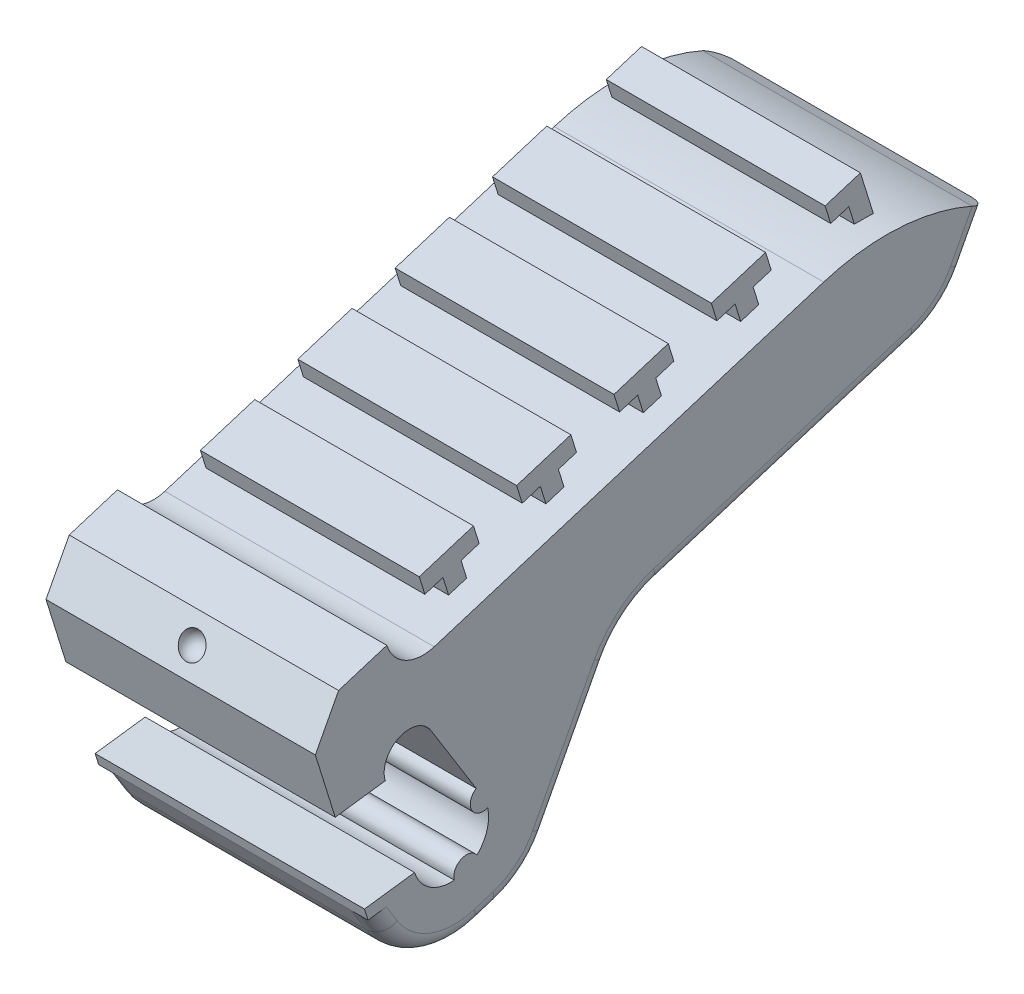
ISO-10303-21;
HEADER;
FILE_DESCRIPTION(('STEP AP214'),'2;1');
FILE_NAME('part.step','',(''),(''),'','','');
FILE_SCHEMA(('AUTOMOTIVE_DESIGN { 1 0 10303 214 1 1 1 1 }'));
ENDSEC;
DATA;
#1=APPLICATION_CONTEXT('core data for automotive mechanical design processes');
#2=APPLICATION_PROTOCOL_DEFINITION('international standard','automotive_design',2000,#1);
#3=PRODUCT_CONTEXT('',#1,'mechanical');
#4=PRODUCT('Part','Part','',(#3));
#5=PRODUCT_RELATED_PRODUCT_CATEGORY('part','',(#4));
#6=PRODUCT_DEFINITION_FORMATION('','',#4);
#7=PRODUCT_DEFINITION_CONTEXT('part definition',#1,'design');
#8=PRODUCT_DEFINITION('design','',#6,#7);
#9=PRODUCT_DEFINITION_SHAPE('','',#8);
#10=(LENGTH_UNIT() NAMED_UNIT(*) SI_UNIT(.MILLI.,.METRE.));
#11=(NAMED_UNIT(*) PLANE_ANGLE_UNIT() SI_UNIT($,.RADIAN.));
#12=(NAMED_UNIT(*) SI_UNIT($,.STERADIAN.) SOLID_ANGLE_UNIT());
#13=UNCERTAINTY_MEASURE_WITH_UNIT(LENGTH_MEASURE(1.E-05),#10,'distance_accuracy_value','');
#14=(GEOMETRIC_REPRESENTATION_CONTEXT(3) GLOBAL_UNCERTAINTY_ASSIGNED_CONTEXT((#13)) GLOBAL_UNIT_ASSIGNED_CONTEXT((#10,
#11,#12)) REPRESENTATION_CONTEXT('',''));
#15=CARTESIAN_POINT('',(0.,0.,0.));
#16=DIRECTION('',(0.,0.,1.));
#17=DIRECTION('',(1.,0.,0.));
#18=AXIS2_PLACEMENT_3D('',#15,#16,#17);
#19=CARTESIAN_POINT('',(8.,0.,0.));
#20=DIRECTION('',(1.,0.,0.));
#21=DIRECTION('',(0.,0.,-1.));
#22=AXIS2_PLACEMENT_3D('',#19,#20,#21);
#23=PLANE('',#22);
#24=CARTESIAN_POINT('',(8.,12.3419918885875,-72.7866478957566));
#25=DIRECTION('',(1.,0.,0.));
#26=DIRECTION('',(0.,0.,-1.));
#27=AXIS2_PLACEMENT_3D('',#24,#25,#26);
#28=CIRCLE('',#27,2.25);
#29=CARTESIAN_POINT('',(8.,11.6738545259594,-70.638138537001));
#30=VERTEX_POINT('',#29);
#31=CARTESIAN_POINT('',(8.,10.1934825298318,-73.4547852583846));
#32=VERTEX_POINT('',#31);
#33=EDGE_CURVE('E577',#30,#32,#28,.T.);
#34=ORIENTED_EDGE('',*,*,#33,.F.);
#35=DIRECTION('',(0.,-0.296949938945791,0.954893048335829));
#36=VECTOR('',#35,1.);
#37=CARTESIAN_POINT('',(8.,10.1603517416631,-65.7712128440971));
#38=LINE('',#37,#36);
#39=CARTESIAN_POINT('',(8.,10.783004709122,-67.7734593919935));
#40=VERTEX_POINT('',#39);
#41=EDGE_CURVE('E50',#30,#40,#38,.T.);
#42=ORIENTED_EDGE('',*,*,#41,.T.);
#43=DIRECTION('',(0.,0.885186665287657,-0.465236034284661));
#44=VECTOR('',#43,1.);
#45=CARTESIAN_POINT('',(8.,8.15810519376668,-66.3938658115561));
#46=LINE('',#45,#44);
#47=CARTESIAN_POINT('',(8.,8.15810519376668,-66.3938658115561));
#48=VERTEX_POINT('',#47);
#49=EDGE_CURVE('E591',#48,#40,#46,.T.);
#50=ORIENTED_EDGE('',*,*,#49,.F.);
#51=DIRECTION('',(0.,-0.954893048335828,-0.296949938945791));
#52=VECTOR('',#51,1.);
#53=CARTESIAN_POINT('',(8.,5.03912955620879,-67.3637960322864));
#54=LINE('',#53,#52);
#55=CARTESIAN_POINT('',(8.,4.3608583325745,-67.5747228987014));
#56=VERTEX_POINT('',#55);
#57=EDGE_CURVE('E655',#48,#56,#54,.T.);
#58=ORIENTED_EDGE('',*,*,#57,.T.);
#59=DIRECTION('',(0.,-0.130526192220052,0.99144486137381));
#60=VECTOR('',#59,1.);
#61=CARTESIAN_POINT('',(8.,2.90895523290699,-56.5464239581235));
#62=LINE('',#61,#60);
#63=CARTESIAN_POINT('',(8.,4.75243690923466,-70.5490574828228));
#64=VERTEX_POINT('',#63);
#65=EDGE_CURVE('E619',#64,#56,#62,.T.);
#66=ORIENTED_EDGE('',*,*,#65,.F.);
#67=CARTESIAN_POINT('',(8.,5.19786181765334,-71.9813970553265));
#68=DIRECTION('',(1.,0.,0.));
#69=DIRECTION('',(0.,0.,1.));
#70=AXIS2_PLACEMENT_3D('',#67,#68,#69);
#71=CIRCLE('',#70,1.50000000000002);
#72=CARTESIAN_POINT('',(8.,5.99003819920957,-73.2551539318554));
#73=VERTEX_POINT('',#72);
#74=EDGE_CURVE('E638',#73,#64,#71,.T.);
#75=ORIENTED_EDGE('',*,*,#74,.F.);
#76=DIRECTION('',(0.,0.849171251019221,0.528117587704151));
#77=VECTOR('',#76,1.);
#78=CARTESIAN_POINT('',(8.,5.99003819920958,-73.2551539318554));
#79=LINE('',#78,#77);
#80=CARTESIAN_POINT('',(8.,1.6566292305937,-75.9501927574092));
#81=VERTEX_POINT('',#80);
#82=EDGE_CURVE('E636',#81,#73,#79,.T.);
#83=ORIENTED_EDGE('',*,*,#82,.F.);
#84=CARTESIAN_POINT('',(8.,1.01975079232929,-76.3462809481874));
#85=DIRECTION('',(1.,0.,0.));
#86=DIRECTION('',(0.,0.,-1.));
#87=AXIS2_PLACEMENT_3D('',#84,#85,#86);
#88=CIRCLE('',#87,0.749999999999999);
#89=CARTESIAN_POINT('',(8.,0.325765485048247,-76.6306827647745));
#90=VERTEX_POINT('',#89);
#91=EDGE_CURVE('E600',#81,#90,#88,.T.);
#92=ORIENTED_EDGE('',*,*,#91,.T.);
#93=CARTESIAN_POINT('',(8.,-0.168513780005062,-74.4356456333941));
#94=DIRECTION('',(1.,0.,0.));
#95=DIRECTION('',(0.,0.,-1.));
#96=AXIS2_PLACEMENT_3D('',#93,#94,#95);
#97=CIRCLE('',#96,2.25);
#98=CARTESIAN_POINT('',(8.,-1.793437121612,-75.9919631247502));
#99=VERTEX_POINT('',#98);
#100=EDGE_CURVE('E632',#99,#90,#97,.T.);
#101=ORIENTED_EDGE('',*,*,#100,.F.);
#102=CARTESIAN_POINT('',(8.,-2.21468018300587,-75.3714357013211));
#103=DIRECTION('',(1.,0.,0.));
#104=DIRECTION('',(0.,0.,-1.));
#105=AXIS2_PLACEMENT_3D('',#102,#103,#104);
#106=CIRCLE('',#105,0.750000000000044);
#107=CARTESIAN_POINT('',(8.,-2.40857142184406,-74.6469316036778));
#108=VERTEX_POINT('',#107);
#109=EDGE_CURVE('E609',#99,#108,#106,.T.);
#110=ORIENTED_EDGE('',*,*,#109,.T.);
#111=CARTESIAN_POINT('',(8.,-0.836651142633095,-72.2871362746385));
#112=VERTEX_POINT('',#111);
#113=EDGE_CURVE('E633',#112,#108,#97,.T.);
#114=ORIENTED_EDGE('',*,*,#113,.F.);
#115=DIRECTION('',(0.,0.130526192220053,-0.99144486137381));
#116=VECTOR('',#115,1.);
#117=CARTESIAN_POINT('',(8.,-1.22822971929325,-69.3128016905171));
#118=LINE('',#117,#116);
#119=CARTESIAN_POINT('',(8.,-1.22822971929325,-69.3128016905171));
#120=VERTEX_POINT('',#119);
#121=EDGE_CURVE('E614',#120,#112,#118,.T.);
#122=ORIENTED_EDGE('',*,*,#121,.F.);
#123=DIRECTION('',(0.,-0.954893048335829,-0.296949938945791));
#124=VECTOR('',#123,1.);
#125=CARTESIAN_POINT('',(8.,19.5457170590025,-62.8525784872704));
#126=LINE('',#125,#124);
#127=CARTESIAN_POINT('',(8.,-1.90650094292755,-69.523728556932));
#128=VERTEX_POINT('',#127);
#129=EDGE_CURVE('E1851',#120,#128,#126,.T.);
#130=ORIENTED_EDGE('',*,*,#129,.T.);
#131=DIRECTION('',(0.,0.130526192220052,-0.99144486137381));
#132=VECTOR('',#131,1.);
#133=CARTESIAN_POINT('',(8.,-3.61499550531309,-56.5464239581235));
#134=LINE('',#133,#132);
#135=CARTESIAN_POINT('',(8.,-1.76319779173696,-70.6122240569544));
#136=VERTEX_POINT('',#135);
#137=EDGE_CURVE('E651',#128,#136,#134,.T.);
#138=ORIENTED_EDGE('',*,*,#137,.T.);
#139=DIRECTION('',(0.,0.849171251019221,0.528117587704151));
#140=VECTOR('',#139,1.);
#141=CARTESIAN_POINT('',(8.,-2.80331177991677,-71.2590929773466));
#142=LINE('',#141,#140);
#143=CARTESIAN_POINT('',(8.,-2.80331177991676,-71.2590929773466));
#144=VERTEX_POINT('',#143);
#145=EDGE_CURVE('E772',#136,#144,#142,.F.);
#146=ORIENTED_EDGE('',*,*,#145,.T.);
#147=CARTESIAN_POINT('',(8.,-0.690841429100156,-74.6557779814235));
#148=DIRECTION('',(1.,0.,0.));
#149=DIRECTION('',(0.,0.,-1.));
#150=AXIS2_PLACEMENT_3D('',#147,#148,#149);
#151=CIRCLE('',#150,4.);
#152=CARTESIAN_POINT('',(8.,-4.51041362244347,-75.8435777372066));
#153=VERTEX_POINT('',#152);
#154=EDGE_CURVE('E774',#144,#153,#151,.T.);
#155=ORIENTED_EDGE('',*,*,#154,.T.);
#156=DIRECTION('',(0.,0.296949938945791,-0.954893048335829));
#157=VECTOR('',#156,1.);
#158=CARTESIAN_POINT('',(8.,-4.16805622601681,-76.944486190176));
#159=LINE('',#158,#157);
#160=CARTESIAN_POINT('',(8.,-4.16805622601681,-76.944486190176));
#161=VERTEX_POINT('',#160);
#162=EDGE_CURVE('E776',#153,#161,#159,.T.);
#163=ORIENTED_EDGE('',*,*,#162,.T.);
#164=CARTESIAN_POINT('',(8.,-0.348484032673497,-75.7566864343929));
#165=DIRECTION('',(1.,0.,0.));
#166=DIRECTION('',(0.,0.,-1.));
#167=AXIS2_PLACEMENT_3D('',#164,#165,#166);
#168=CIRCLE('',#167,4.);
#169=CARTESIAN_POINT('',(8.,-2.20942816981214,-79.2974330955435));
#170=VERTEX_POINT('',#169);
#171=EDGE_CURVE('E778',#161,#170,#168,.T.);
#172=ORIENTED_EDGE('',*,*,#171,.T.);
#173=DIRECTION('',(0.,-0.885186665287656,0.465236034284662));
#174=VECTOR('',#173,1.);
#175=CARTESIAN_POINT('',(8.,4.75301582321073,-82.9567514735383));
#176=LINE('',#175,#174);
#177=CARTESIAN_POINT('',(8.,4.75301582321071,-82.9567514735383));
#178=VERTEX_POINT('',#177);
#179=EDGE_CURVE('E780',#170,#178,#176,.F.);
#180=ORIENTED_EDGE('',*,*,#179,.T.);
#181=CARTESIAN_POINT('',(8.,1.96159961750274,-88.2678714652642));
#182=DIRECTION('',(1.,0.,0.));
#183=DIRECTION('',(0.,0.,-1.));
#184=AXIS2_PLACEMENT_3D('',#181,#182,#183);
#185=CIRCLE('',#184,6.);
#186=CARTESIAN_POINT('',(8.,7.69095790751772,-86.4861718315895));
#187=VERTEX_POINT('',#186);
#188=EDGE_CURVE('E782',#178,#187,#185,.F.);
#189=ORIENTED_EDGE('',*,*,#188,.T.);
#190=DIRECTION('',(0.,0.29694993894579,-0.954893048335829));
#191=VECTOR('',#190,1.);
#192=CARTESIAN_POINT('',(8.,-17.510848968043,-5.44547427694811));
#193=LINE('',#192,#191);
#194=CARTESIAN_POINT('',(8.,12.4408494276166,-101.760256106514));
#195=VERTEX_POINT('',#194);
#196=EDGE_CURVE('E784',#187,#195,#193,.T.);
#197=ORIENTED_EDGE('',*,*,#196,.T.);
#198=CARTESIAN_POINT('',(8.,16.2604216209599,-100.572456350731));
#199=DIRECTION('',(1.,0.,0.));
#200=DIRECTION('',(0.,0.,-1.));
#201=AXIS2_PLACEMENT_3D('',#198,#199,#200);
#202=CIRCLE('',#201,4.);
#203=CARTESIAN_POINT('',(8.,14.3994774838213,-104.113203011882));
#204=VERTEX_POINT('',#203);
#205=EDGE_CURVE('E786',#195,#204,#202,.T.);
#206=ORIENTED_EDGE('',*,*,#205,.T.);
#207=DIRECTION('',(0.,0.885186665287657,-0.465236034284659));
#208=VECTOR('',#207,1.);
#209=CARTESIAN_POINT('',(8.,-39.7592869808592,-75.6484624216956));
#210=LINE('',#209,#208);
#211=CARTESIAN_POINT('',(8.,16.8784022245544,-105.416075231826));
#212=VERTEX_POINT('',#211);
#213=EDGE_CURVE('E565',#204,#212,#210,.T.);
#214=ORIENTED_EDGE('',*,*,#213,.T.);
#215=DIRECTION('',(0.,-0.446830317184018,-0.894618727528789));
#216=VECTOR('',#215,1.);
#217=CARTESIAN_POINT('',(8.,55.6478193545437,-27.7941116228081));
#218=LINE('',#217,#216);
#219=CARTESIAN_POINT('',(8.,16.8832554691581,-105.406358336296));
#220=VERTEX_POINT('',#219);
#221=EDGE_CURVE('E57',#220,#212,#218,.T.);
#222=ORIENTED_EDGE('',*,*,#221,.F.);
#223=CARTESIAN_POINT('',(8.,5.37280969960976,-100.324738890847));
#224=DIRECTION('',(-1.,0.,0.));
#225=DIRECTION('',(0.,0.,1.));
#226=AXIS2_PLACEMENT_3D('',#223,#224,#225);
#227=CIRCLE('',#226,12.5822580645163);
#228=CARTESIAN_POINT('',(8.,17.3875204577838,-96.5884381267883));
#229=VERTEX_POINT('',#228);
#230=EDGE_CURVE('E563',#229,#220,#227,.T.);
#231=ORIENTED_EDGE('',*,*,#230,.F.);
#232=DIRECTION('',(0.,0.296949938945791,-0.954893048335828));
#233=VECTOR('',#232,1.);
#234=CARTESIAN_POINT('',(8.,10.1934825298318,-73.4547852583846));
#235=LINE('',#234,#233);
#236=EDGE_CURVE('E573',#32,#229,#235,.T.);
#237=ORIENTED_EDGE('',*,*,#236,.F.);
#238=EDGE_LOOP('',(#34,#42,#50,#58,#66,#75,#83,#92,#101,#110,#114,#122,#130,#138,#146,#155,#163,
#172,#180,#189,#197,#206,#214,#222,#231,#237));
#239=FACE_BOUND('',#238,.T.);
#240=ADVANCED_FACE('F35',(#239),#23,.T.);
#241=CARTESIAN_POINT('',(-8.,0.,0.));
#242=DIRECTION('',(1.,0.,0.));
#243=DIRECTION('',(0.,0.,-1.));
#244=AXIS2_PLACEMENT_3D('',#241,#242,#243);
#245=PLANE('',#244);
#246=DIRECTION('',(0.,-0.296949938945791,0.954893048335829));
#247=VECTOR('',#246,1.);
#248=CARTESIAN_POINT('',(-8.,10.1603517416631,-65.7712128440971));
#249=LINE('',#248,#247);
#250=CARTESIAN_POINT('',(-8.,11.6738545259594,-70.638138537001));
#251=VERTEX_POINT('',#250);
#252=CARTESIAN_POINT('',(-8.,10.783004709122,-67.7734593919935));
#253=VERTEX_POINT('',#252);
#254=EDGE_CURVE('E659',#251,#253,#249,.T.);
#255=ORIENTED_EDGE('',*,*,#254,.F.);
#256=CARTESIAN_POINT('',(-8.,12.3419918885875,-72.7866478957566));
#257=DIRECTION('',(1.,0.,0.));
#258=DIRECTION('',(0.,0.,-1.));
#259=AXIS2_PLACEMENT_3D('',#256,#257,#258);
#260=CIRCLE('',#259,2.25);
#261=CARTESIAN_POINT('',(-8.,10.1934825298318,-73.4547852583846));
#262=VERTEX_POINT('',#261);
#263=EDGE_CURVE('E572',#251,#262,#260,.T.);
#264=ORIENTED_EDGE('',*,*,#263,.T.);
#265=DIRECTION('',(0.,0.296949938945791,-0.954893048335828));
#266=VECTOR('',#265,1.);
#267=CARTESIAN_POINT('',(-8.,10.1934825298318,-73.4547852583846));
#268=LINE('',#267,#266);
#269=CARTESIAN_POINT('',(-8.,17.3875204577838,-96.5884381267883));
#270=VERTEX_POINT('',#269);
#271=EDGE_CURVE('E575',#262,#270,#268,.T.);
#272=ORIENTED_EDGE('',*,*,#271,.T.);
#273=CARTESIAN_POINT('',(-8.,5.37280969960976,-100.324738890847));
#274=DIRECTION('',(-1.,0.,0.));
#275=DIRECTION('',(0.,0.,1.));
#276=AXIS2_PLACEMENT_3D('',#273,#274,#275);
#277=CIRCLE('',#276,12.5822580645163);
#278=CARTESIAN_POINT('',(-8.,16.8832554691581,-105.406358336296));
#279=VERTEX_POINT('',#278);
#280=EDGE_CURVE('E585',#270,#279,#277,.T.);
#281=ORIENTED_EDGE('',*,*,#280,.T.);
#282=DIRECTION('',(0.,-0.446830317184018,-0.894618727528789));
#283=VECTOR('',#282,1.);
#284=CARTESIAN_POINT('',(-8.,55.6478193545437,-27.7941116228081));
#285=LINE('',#284,#283);
#286=CARTESIAN_POINT('',(-8.,16.8784022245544,-105.416075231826));
#287=VERTEX_POINT('',#286);
#288=EDGE_CURVE('E551',#279,#287,#285,.T.);
#289=ORIENTED_EDGE('',*,*,#288,.T.);
#290=DIRECTION('',(0.,0.885186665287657,-0.465236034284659));
#291=VECTOR('',#290,1.);
#292=CARTESIAN_POINT('',(-8.,14.3994774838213,-104.113203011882));
#293=LINE('',#292,#291);
#294=CARTESIAN_POINT('',(-8.,14.3994774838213,-104.113203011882));
#295=VERTEX_POINT('',#294);
#296=EDGE_CURVE('E753',#287,#295,#293,.F.);
#297=ORIENTED_EDGE('',*,*,#296,.T.);
#298=CARTESIAN_POINT('',(-8.,16.2604216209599,-100.572456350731));
#299=DIRECTION('',(1.,0.,0.));
#300=DIRECTION('',(0.,0.,-1.));
#301=AXIS2_PLACEMENT_3D('',#298,#299,#300);
#302=CIRCLE('',#301,4.);
#303=CARTESIAN_POINT('',(-8.,12.4408494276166,-101.760256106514));
#304=VERTEX_POINT('',#303);
#305=EDGE_CURVE('E751',#295,#304,#302,.F.);
#306=ORIENTED_EDGE('',*,*,#305,.T.);
#307=DIRECTION('',(0.,0.29694993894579,-0.954893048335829));
#308=VECTOR('',#307,1.);
#309=CARTESIAN_POINT('',(-8.,7.69095790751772,-86.4861718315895));
#310=LINE('',#309,#308);
#311=CARTESIAN_POINT('',(-8.,7.69095790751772,-86.4861718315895));
#312=VERTEX_POINT('',#311);
#313=EDGE_CURVE('E749',#304,#312,#310,.F.);
#314=ORIENTED_EDGE('',*,*,#313,.T.);
#315=CARTESIAN_POINT('',(-8.,1.96159961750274,-88.2678714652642));
#316=DIRECTION('',(1.,0.,0.));
#317=DIRECTION('',(0.,0.,-1.));
#318=AXIS2_PLACEMENT_3D('',#315,#316,#317);
#319=CIRCLE('',#318,6.);
#320=CARTESIAN_POINT('',(-8.,4.75301582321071,-82.9567514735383));
#321=VERTEX_POINT('',#320);
#322=EDGE_CURVE('E747',#312,#321,#319,.T.);
#323=ORIENTED_EDGE('',*,*,#322,.T.);
#324=DIRECTION('',(0.,-0.885186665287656,0.465236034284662));
#325=VECTOR('',#324,1.);
#326=CARTESIAN_POINT('',(-8.,-33.1345458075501,-63.0438228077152));
#327=LINE('',#326,#325);
#328=CARTESIAN_POINT('',(-8.,-2.20942816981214,-79.2974330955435));
#329=VERTEX_POINT('',#328);
#330=EDGE_CURVE('E741',#321,#329,#327,.T.);
#331=ORIENTED_EDGE('',*,*,#330,.T.);
#332=CARTESIAN_POINT('',(-8.,-0.348484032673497,-75.7566864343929));
#333=DIRECTION('',(1.,0.,0.));
#334=DIRECTION('',(0.,0.,-1.));
#335=AXIS2_PLACEMENT_3D('',#332,#333,#334);
#336=CIRCLE('',#335,4.);
#337=CARTESIAN_POINT('',(-8.,-4.16805622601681,-76.944486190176));
#338=VERTEX_POINT('',#337);
#339=EDGE_CURVE('E743',#329,#338,#336,.F.);
#340=ORIENTED_EDGE('',*,*,#339,.T.);
#341=DIRECTION('',(0.,0.296949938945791,-0.954893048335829));
#342=VECTOR('',#341,1.);
#343=CARTESIAN_POINT('',(-8.,-25.6185471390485,-7.9667833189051));
#344=LINE('',#343,#342);
#345=CARTESIAN_POINT('',(-8.,-4.51041362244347,-75.8435777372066));
#346=VERTEX_POINT('',#345);
#347=EDGE_CURVE('E745',#338,#346,#344,.F.);
#348=ORIENTED_EDGE('',*,*,#347,.T.);
#349=CARTESIAN_POINT('',(-8.,-0.690841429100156,-74.6557779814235));
#350=DIRECTION('',(1.,0.,0.));
#351=DIRECTION('',(0.,0.,-1.));
#352=AXIS2_PLACEMENT_3D('',#349,#350,#351);
#353=CIRCLE('',#352,4.);
#354=CARTESIAN_POINT('',(-8.,-2.80331177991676,-71.2590929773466));
#355=VERTEX_POINT('',#354);
#356=EDGE_CURVE('E755',#346,#355,#353,.F.);
#357=ORIENTED_EDGE('',*,*,#356,.T.);
#358=DIRECTION('',(0.,0.849171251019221,0.528117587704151));
#359=VECTOR('',#358,1.);
#360=CARTESIAN_POINT('',(-8.,31.1751481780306,-50.1271690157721));
#361=LINE('',#360,#359);
#362=CARTESIAN_POINT('',(-8.,-1.76319779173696,-70.6122240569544));
#363=VERTEX_POINT('',#362);
#364=EDGE_CURVE('E757',#355,#363,#361,.T.);
#365=ORIENTED_EDGE('',*,*,#364,.T.);
#366=DIRECTION('',(0.,0.130526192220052,-0.99144486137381));
#367=VECTOR('',#366,1.);
#368=CARTESIAN_POINT('',(-8.,-3.61499550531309,-56.5464239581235));
#369=LINE('',#368,#367);
#370=CARTESIAN_POINT('',(-8.,-1.90650094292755,-69.523728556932));
#371=VERTEX_POINT('',#370);
#372=EDGE_CURVE('E645',#371,#363,#369,.T.);
#373=ORIENTED_EDGE('',*,*,#372,.F.);
#374=DIRECTION('',(0.,-0.954893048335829,-0.296949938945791));
#375=VECTOR('',#374,1.);
#376=CARTESIAN_POINT('',(-8.,19.5457170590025,-62.8525784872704));
#377=LINE('',#376,#375);
#378=CARTESIAN_POINT('',(-8.,-1.22822971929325,-69.3128016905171));
#379=VERTEX_POINT('',#378);
#380=EDGE_CURVE('E1859',#379,#371,#377,.T.);
#381=ORIENTED_EDGE('',*,*,#380,.F.);
#382=DIRECTION('',(0.,0.130526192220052,-0.99144486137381));
#383=VECTOR('',#382,1.);
#384=CARTESIAN_POINT('',(-8.,-2.90895523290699,-56.5464239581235));
#385=LINE('',#384,#383);
#386=CARTESIAN_POINT('',(-8.,-0.836651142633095,-72.2871362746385));
#387=VERTEX_POINT('',#386);
#388=EDGE_CURVE('E618',#379,#387,#385,.T.);
#389=ORIENTED_EDGE('',*,*,#388,.T.);
#390=CARTESIAN_POINT('',(-8.,-0.168513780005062,-74.4356456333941));
#391=DIRECTION('',(1.,0.,0.));
#392=DIRECTION('',(0.,0.,-1.));
#393=AXIS2_PLACEMENT_3D('',#390,#391,#392);
#394=CIRCLE('',#393,2.25);
#395=CARTESIAN_POINT('',(-8.,-2.40857142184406,-74.6469316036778));
#396=VERTEX_POINT('',#395);
#397=EDGE_CURVE('E622',#387,#396,#394,.T.);
#398=ORIENTED_EDGE('',*,*,#397,.T.);
#399=CARTESIAN_POINT('',(-8.,-2.21468018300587,-75.3714357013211));
#400=DIRECTION('',(1.,0.,0.));
#401=DIRECTION('',(0.,0.,-1.));
#402=AXIS2_PLACEMENT_3D('',#399,#400,#401);
#403=CIRCLE('',#402,0.750000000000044);
#404=CARTESIAN_POINT('',(-8.,-1.79343712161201,-75.9919631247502));
#405=VERTEX_POINT('',#404);
#406=EDGE_CURVE('E612',#396,#405,#403,.F.);
#407=ORIENTED_EDGE('',*,*,#406,.T.);
#408=CARTESIAN_POINT('',(-8.,0.325765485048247,-76.6306827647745));
#409=VERTEX_POINT('',#408);
#410=EDGE_CURVE('E621',#405,#409,#394,.T.);
#411=ORIENTED_EDGE('',*,*,#410,.T.);
#412=CARTESIAN_POINT('',(-8.,1.01975079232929,-76.3462809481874));
#413=DIRECTION('',(1.,0.,0.));
#414=DIRECTION('',(0.,0.,-1.));
#415=AXIS2_PLACEMENT_3D('',#412,#413,#414);
#416=CIRCLE('',#415,0.749999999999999);
#417=CARTESIAN_POINT('',(-8.,1.65662923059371,-75.9501927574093));
#418=VERTEX_POINT('',#417);
#419=EDGE_CURVE('E604',#409,#418,#416,.F.);
#420=ORIENTED_EDGE('',*,*,#419,.T.);
#421=DIRECTION('',(0.,0.849171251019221,0.528117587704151));
#422=VECTOR('',#421,1.);
#423=CARTESIAN_POINT('',(-8.,5.99003819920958,-73.2551539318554));
#424=LINE('',#423,#422);
#425=CARTESIAN_POINT('',(-8.,5.99003819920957,-73.2551539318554));
#426=VERTEX_POINT('',#425);
#427=EDGE_CURVE('E625',#418,#426,#424,.T.);
#428=ORIENTED_EDGE('',*,*,#427,.T.);
#429=CARTESIAN_POINT('',(-8.,5.19786181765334,-71.9813970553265));
#430=DIRECTION('',(1.,0.,0.));
#431=DIRECTION('',(0.,0.,1.));
#432=AXIS2_PLACEMENT_3D('',#429,#430,#431);
#433=CIRCLE('',#432,1.50000000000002);
#434=CARTESIAN_POINT('',(-8.,4.75243690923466,-70.5490574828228));
#435=VERTEX_POINT('',#434);
#436=EDGE_CURVE('E627',#426,#435,#433,.T.);
#437=ORIENTED_EDGE('',*,*,#436,.T.);
#438=DIRECTION('',(0.,-0.130526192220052,0.99144486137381));
#439=VECTOR('',#438,1.);
#440=CARTESIAN_POINT('',(-8.,2.90895523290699,-56.5464239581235));
#441=LINE('',#440,#439);
#442=CARTESIAN_POINT('',(-8.,4.3608583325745,-67.5747228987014));
#443=VERTEX_POINT('',#442);
#444=EDGE_CURVE('E615',#435,#443,#441,.T.);
#445=ORIENTED_EDGE('',*,*,#444,.T.);
#446=DIRECTION('',(0.,-0.954893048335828,-0.296949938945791));
#447=VECTOR('',#446,1.);
#448=CARTESIAN_POINT('',(-8.,5.03912955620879,-67.3637960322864));
#449=LINE('',#448,#447);
#450=CARTESIAN_POINT('',(-8.,8.15810519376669,-66.3938658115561));
#451=VERTEX_POINT('',#450);
#452=EDGE_CURVE('E653',#451,#443,#449,.T.);
#453=ORIENTED_EDGE('',*,*,#452,.F.);
#454=DIRECTION('',(0.,0.885186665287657,-0.465236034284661));
#455=VECTOR('',#454,1.);
#456=CARTESIAN_POINT('',(-8.,8.15810519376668,-66.3938658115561));
#457=LINE('',#456,#455);
#458=EDGE_CURVE('E592',#451,#253,#457,.T.);
#459=ORIENTED_EDGE('',*,*,#458,.T.);
#460=EDGE_LOOP('',(#255,#264,#272,#281,#289,#297,#306,#314,#323,#331,#340,#348,#357,#365,#373,
#381,#389,#398,#407,#411,#420,#428,#437,#445,#453,#459));
#461=FACE_BOUND('',#460,.T.);
#462=ADVANCED_FACE('F927',(#461),#245,.F.);
#463=CARTESIAN_POINT('',(8.,-3.61499550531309,-56.5464239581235));
#464=DIRECTION('',(0.,0.99144486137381,0.130526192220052));
#465=DIRECTION('',(0.,-0.130526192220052,0.99144486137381));
#466=AXIS2_PLACEMENT_3D('',#463,#464,#465);
#467=PLANE('',#466);
#468=DIRECTION('',(1.,0.,0.));
#469=VECTOR('',#468,1.);
#470=CARTESIAN_POINT('',(-8.08521355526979,-1.90650094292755,-69.523728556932));
#471=LINE('',#470,#469);
#472=CARTESIAN_POINT('',(-7.,-1.90650094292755,-69.523728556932));
#473=VERTEX_POINT('',#472);
#474=EDGE_CURVE('E1856',#371,#473,#471,.T.);
#475=ORIENTED_EDGE('',*,*,#474,.F.);
#476=ORIENTED_EDGE('',*,*,#372,.T.);
#477=CARTESIAN_POINT('',(-7.,-1.76319779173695,-70.6122240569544));
#478=DIRECTION('',(0.,0.99144486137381,0.130526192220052));
#479=DIRECTION('',(0.,-0.130526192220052,0.99144486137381));
#480=AXIS2_PLACEMENT_3D('',#477,#478,#479);
#481=ELLIPSE('',#480,1.09788808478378,1.);
#482=EDGE_CURVE('E810',#363,#473,#481,.T.);
#483=ORIENTED_EDGE('',*,*,#482,.T.);
#484=EDGE_LOOP('',(#475,#476,#483));
#485=FACE_BOUND('',#484,.T.);
#486=ADVANCED_FACE('F932',(#485),#467,.F.);
#487=CARTESIAN_POINT('',(7.,-1.90650094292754,-69.523728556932));
#488=VERTEX_POINT('',#487);
#489=EDGE_CURVE('E1854',#488,#128,#471,.T.);
#490=ORIENTED_EDGE('',*,*,#489,.F.);
#491=CARTESIAN_POINT('',(7.,-1.76319779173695,-70.6122240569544));
#492=DIRECTION('',(0.,0.99144486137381,0.130526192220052));
#493=DIRECTION('',(0.,0.130526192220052,-0.99144486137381));
#494=AXIS2_PLACEMENT_3D('',#491,#492,#493);
#495=ELLIPSE('',#494,1.09788808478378,1.);
#496=EDGE_CURVE('E43',#488,#136,#495,.T.);
#497=ORIENTED_EDGE('',*,*,#496,.T.);
#498=ORIENTED_EDGE('',*,*,#137,.F.);
#499=EDGE_LOOP('',(#490,#497,#498));
#500=FACE_BOUND('',#499,.T.);
#501=ADVANCED_FACE('F952',(#500),#467,.F.);
#502=CARTESIAN_POINT('',(-8.,2.90895523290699,-56.5464239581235));
#503=DIRECTION('',(0.,0.99144486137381,0.130526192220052));
#504=DIRECTION('',(0.,-0.130526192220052,0.99144486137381));
#505=AXIS2_PLACEMENT_3D('',#502,#503,#504);
#506=PLANE('',#505);
#507=DIRECTION('',(1.,0.,0.));
#508=VECTOR('',#507,1.);
#509=CARTESIAN_POINT('',(-8.,4.3608583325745,-67.5747228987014));
#510=LINE('',#509,#508);
#511=EDGE_CURVE('E845',#443,#56,#510,.T.);
#512=ORIENTED_EDGE('',*,*,#511,.F.);
#513=ORIENTED_EDGE('',*,*,#444,.F.);
#514=DIRECTION('',(1.,0.,0.));
#515=VECTOR('',#514,1.);
#516=CARTESIAN_POINT('',(-8.,4.75243690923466,-70.5490574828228));
#517=LINE('',#516,#515);
#518=EDGE_CURVE('E643',#435,#64,#517,.T.);
#519=ORIENTED_EDGE('',*,*,#518,.T.);
#520=ORIENTED_EDGE('',*,*,#65,.T.);
#521=EDGE_LOOP('',(#512,#513,#519,#520));
#522=FACE_BOUND('',#521,.T.);
#523=ADVANCED_FACE('F1112',(#522),#506,.F.);
#524=CARTESIAN_POINT('',(-8.,-1.22822971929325,-69.3128016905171));
#525=DIRECTION('',(0.,-0.99144486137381,-0.130526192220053));
#526=DIRECTION('',(0.,0.130526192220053,-0.99144486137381));
#527=AXIS2_PLACEMENT_3D('',#524,#525,#526);
#528=PLANE('',#527);
#529=DIRECTION('',(-1.,0.,0.));
#530=VECTOR('',#529,1.);
#531=CARTESIAN_POINT('',(-8.,-1.22822971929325,-69.3128016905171));
#532=LINE('',#531,#530);
#533=EDGE_CURVE('E1857',#120,#379,#532,.T.);
#534=ORIENTED_EDGE('',*,*,#533,.F.);
#535=ORIENTED_EDGE('',*,*,#121,.T.);
#536=DIRECTION('',(1.,0.,0.));
#537=VECTOR('',#536,1.);
#538=CARTESIAN_POINT('',(-8.,-0.836651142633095,-72.2871362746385));
#539=LINE('',#538,#537);
#540=EDGE_CURVE('E630',#387,#112,#539,.T.);
#541=ORIENTED_EDGE('',*,*,#540,.F.);
#542=ORIENTED_EDGE('',*,*,#388,.F.);
#543=EDGE_LOOP('',(#534,#535,#541,#542));
#544=FACE_BOUND('',#543,.T.);
#545=ADVANCED_FACE('F936',(#544),#528,.F.);
#546=CARTESIAN_POINT('',(-8.,-18.4657420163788,-5.7424242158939));
#547=DIRECTION('',(0.,-0.954893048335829,-0.29694993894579));
#548=DIRECTION('',(0.,0.29694993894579,-0.954893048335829));
#549=AXIS2_PLACEMENT_3D('',#546,#547,#548);
#550=PLANE('',#549);
#551=DIRECTION('',(1.,0.,0.));
#552=VECTOR('',#551,1.);
#553=CARTESIAN_POINT('',(-8.,6.73606485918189,-86.7831217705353));
#554=LINE('',#553,#552);
#555=CARTESIAN_POINT('',(-5.,6.73606485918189,-86.7831217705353));
#556=VERTEX_POINT('',#555);
#557=CARTESIAN_POINT('',(-7.,6.73606485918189,-86.7831217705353));
#558=VERTEX_POINT('',#557);
#559=EDGE_CURVE('E689',#556,#558,#554,.F.);
#560=ORIENTED_EDGE('',*,*,#559,.T.);
#561=DIRECTION('',(0.,0.29694993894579,-0.954893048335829));
#562=VECTOR('',#561,1.);
#563=CARTESIAN_POINT('',(-7.,11.4859563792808,-102.05720604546));
#564=LINE('',#563,#562);
#565=CARTESIAN_POINT('',(-7.,11.4859563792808,-102.05720604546));
#566=VERTEX_POINT('',#565);
#567=EDGE_CURVE('E764',#558,#566,#564,.T.);
#568=ORIENTED_EDGE('',*,*,#567,.T.);
#569=DIRECTION('',(1.,0.,0.));
#570=VECTOR('',#569,1.);
#571=CARTESIAN_POINT('',(-8.,11.4859563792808,-102.05720604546));
#572=LINE('',#571,#570);
#573=CARTESIAN_POINT('',(-5.,11.4859563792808,-102.05720604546));
#574=VERTEX_POINT('',#573);
#575=EDGE_CURVE('E695',#566,#574,#572,.T.);
#576=ORIENTED_EDGE('',*,*,#575,.T.);
#577=DIRECTION('',(0.,-0.29694993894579,0.954893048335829));
#578=VECTOR('',#577,1.);
#579=CARTESIAN_POINT('',(-5.,-18.4657420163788,-5.7424242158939));
#580=LINE('',#579,#578);
#581=EDGE_CURVE('E681',#574,#556,#580,.T.);
#582=ORIENTED_EDGE('',*,*,#581,.T.);
#583=EDGE_LOOP('',(#560,#568,#576,#582));
#584=FACE_BOUND('',#583,.T.);
#585=ADVANCED_FACE('F1111',(#584),#550,.T.);
#586=CARTESIAN_POINT('',(-8.,-33.5997818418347,-63.9290094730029));
#587=DIRECTION('',(0.,0.465236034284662,0.885186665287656));
#588=DIRECTION('',(0.,-0.885186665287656,0.465236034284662));
#589=AXIS2_PLACEMENT_3D('',#586,#587,#588);
#590=PLANE('',#589);
#591=DIRECTION('',(1.,0.,0.));
#592=VECTOR('',#591,1.);
#593=CARTESIAN_POINT('',(-8.,-2.67466420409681,-80.1826197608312));
#594=LINE('',#593,#592);
#595=CARTESIAN_POINT('',(7.,-2.67466420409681,-80.1826197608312));
#596=VERTEX_POINT('',#595);
#597=CARTESIAN_POINT('',(-7.,-2.67466420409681,-80.1826197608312));
#598=VERTEX_POINT('',#597);
#599=EDGE_CURVE('E712',#596,#598,#594,.F.);
#600=ORIENTED_EDGE('',*,*,#599,.T.);
#601=DIRECTION('',(0.,-0.885186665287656,0.465236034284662));
#602=VECTOR('',#601,1.);
#603=CARTESIAN_POINT('',(-7.,-33.5997818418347,-63.9290094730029));
#604=LINE('',#603,#602);
#605=CARTESIAN_POINT('',(-7.,4.28777978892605,-83.8419381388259));
#606=VERTEX_POINT('',#605);
#607=EDGE_CURVE('E808',#598,#606,#604,.F.);
#608=ORIENTED_EDGE('',*,*,#607,.T.);
#609=DIRECTION('',(1.,0.,0.));
#610=VECTOR('',#609,1.);
#611=CARTESIAN_POINT('',(-8.,4.28777978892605,-83.8419381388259));
#612=LINE('',#611,#610);
#613=CARTESIAN_POINT('',(-5.,4.28777978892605,-83.8419381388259));
#614=VERTEX_POINT('',#613);
#615=EDGE_CURVE('E718',#606,#614,#612,.T.);
#616=ORIENTED_EDGE('',*,*,#615,.T.);
#617=DIRECTION('',(0.,0.885186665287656,-0.465236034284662));
#618=VECTOR('',#617,1.);
#619=CARTESIAN_POINT('',(-5.,-33.5997818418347,-63.9290094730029));
#620=LINE('',#619,#618);
#621=CARTESIAN_POINT('',(-5.,-0.368931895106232,-81.3944655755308));
#622=VERTEX_POINT('',#621);
#623=EDGE_CURVE('E1892',#622,#614,#620,.T.);
#624=ORIENTED_EDGE('',*,*,#623,.F.);
#625=DIRECTION('',(1.,0.,0.));
#626=VECTOR('',#625,1.);
#627=CARTESIAN_POINT('',(-8.,-0.368931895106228,-81.3944655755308));
#628=LINE('',#627,#626);
#629=CARTESIAN_POINT('',(5.,-0.368931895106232,-81.3944655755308));
#630=VERTEX_POINT('',#629);
#631=EDGE_CURVE('E684',#622,#630,#628,.T.);
#632=ORIENTED_EDGE('',*,*,#631,.T.);
#633=DIRECTION('',(0.,0.885186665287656,-0.465236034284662));
#634=VECTOR('',#633,1.);
#635=CARTESIAN_POINT('',(5.,-33.5997818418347,-63.9290094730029));
#636=LINE('',#635,#634);
#637=CARTESIAN_POINT('',(5.,4.28777978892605,-83.8419381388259));
#638=VERTEX_POINT('',#637);
#639=EDGE_CURVE('E1888',#630,#638,#636,.T.);
#640=ORIENTED_EDGE('',*,*,#639,.T.);
#641=DIRECTION('',(1.,0.,0.));
#642=VECTOR('',#641,1.);
#643=CARTESIAN_POINT('',(-8.,4.28777978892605,-83.8419381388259));
#644=LINE('',#643,#642);
#645=CARTESIAN_POINT('',(7.,4.28777978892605,-83.8419381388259));
#646=VERTEX_POINT('',#645);
#647=EDGE_CURVE('E715',#638,#646,#644,.T.);
#648=ORIENTED_EDGE('',*,*,#647,.T.);
#649=DIRECTION('',(0.,-0.885186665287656,0.465236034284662));
#650=VECTOR('',#649,1.);
#651=CARTESIAN_POINT('',(7.,-2.67466420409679,-80.1826197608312));
#652=LINE('',#651,#650);
#653=EDGE_CURVE('E806',#646,#596,#652,.T.);
#654=ORIENTED_EDGE('',*,*,#653,.T.);
#655=EDGE_LOOP('',(#600,#608,#616,#624,#632,#640,#648,#654));
#656=FACE_BOUND('',#655,.T.);
#657=ADVANCED_FACE('F1695',(#656),#590,.F.);
#658=DIRECTION('',(1.,0.,0.));
#659=VECTOR('',#658,1.);
#660=CARTESIAN_POINT('',(-8.,11.4859563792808,-102.05720604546));
#661=LINE('',#660,#659);
#662=CARTESIAN_POINT('',(5.,11.4859563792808,-102.05720604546));
#663=VERTEX_POINT('',#662);
#664=CARTESIAN_POINT('',(7.,11.4859563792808,-102.05720604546));
#665=VERTEX_POINT('',#664);
#666=EDGE_CURVE('E692',#663,#665,#661,.T.);
#667=ORIENTED_EDGE('',*,*,#666,.T.);
#668=DIRECTION('',(0.,0.29694993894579,-0.954893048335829));
#669=VECTOR('',#668,1.);
#670=CARTESIAN_POINT('',(7.,-18.4657420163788,-5.7424242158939));
#671=LINE('',#670,#669);
#672=CARTESIAN_POINT('',(7.,6.73606485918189,-86.7831217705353));
#673=VERTEX_POINT('',#672);
#674=EDGE_CURVE('E789',#665,#673,#671,.F.);
#675=ORIENTED_EDGE('',*,*,#674,.T.);
#676=DIRECTION('',(1.,0.,0.));
#677=VECTOR('',#676,1.);
#678=CARTESIAN_POINT('',(-8.,6.73606485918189,-86.7831217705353));
#679=LINE('',#678,#677);
#680=CARTESIAN_POINT('',(5.,6.73606485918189,-86.7831217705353));
#681=VERTEX_POINT('',#680);
#682=EDGE_CURVE('E687',#673,#681,#679,.F.);
#683=ORIENTED_EDGE('',*,*,#682,.T.);
#684=DIRECTION('',(0.,-0.29694993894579,0.954893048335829));
#685=VECTOR('',#684,1.);
#686=CARTESIAN_POINT('',(5.,-18.4657420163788,-5.7424242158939));
#687=LINE('',#686,#685);
#688=EDGE_CURVE('E678',#663,#681,#687,.T.);
#689=ORIENTED_EDGE('',*,*,#688,.F.);
#690=EDGE_LOOP('',(#667,#675,#683,#689));
#691=FACE_BOUND('',#690,.T.);
#692=ADVANCED_FACE('F1098',(#691),#550,.T.);
#693=CARTESIAN_POINT('',(-8.,5.37280969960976,-100.324738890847));
#694=DIRECTION('',(1.,0.,0.));
#695=DIRECTION('',(0.,0.,-1.));
#696=AXIS2_PLACEMENT_3D('',#693,#694,#695);
#697=CYLINDRICAL_SURFACE('',#696,12.5822580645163);
#698=ORIENTED_EDGE('',*,*,#230,.T.);
#699=DIRECTION('',(1.,0.,0.));
#700=VECTOR('',#699,1.);
#701=CARTESIAN_POINT('',(-8.,16.8832554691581,-105.406358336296));
#702=LINE('',#701,#700);
#703=EDGE_CURVE('E548',#279,#220,#702,.T.);
#704=ORIENTED_EDGE('',*,*,#703,.F.);
#705=ORIENTED_EDGE('',*,*,#280,.F.);
#706=DIRECTION('',(1.,0.,0.));
#707=VECTOR('',#706,1.);
#708=CARTESIAN_POINT('',(-8.,17.3875204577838,-96.5884381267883));
#709=LINE('',#708,#707);
#710=EDGE_CURVE('E556',#270,#229,#709,.T.);
#711=ORIENTED_EDGE('',*,*,#710,.T.);
#712=EDGE_LOOP('',(#698,#704,#705,#711));
#713=FACE_BOUND('',#712,.T.);
#714=CARTESIAN_POINT('',(6.5,5.37280969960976,-100.324738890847));
#715=DIRECTION('',(-1.,0.,0.));
#716=DIRECTION('',(0.,0.,1.));
#717=AXIS2_PLACEMENT_3D('',#714,#715,#716);
#718=CIRCLE('',#717,12.5822580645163);
#719=CARTESIAN_POINT('',(6.5,17.9484978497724,-99.9181856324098));
#720=VERTEX_POINT('',#719);
#721=CARTESIAN_POINT('',(6.5,17.9345443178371,-101.04309909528));
#722=VERTEX_POINT('',#721);
#723=EDGE_CURVE('E676',#720,#722,#718,.T.);
#724=ORIENTED_EDGE('',*,*,#723,.F.);
#725=DIRECTION('',(-1.,0.,0.));
#726=VECTOR('',#725,1.);
#727=CARTESIAN_POINT('',(6.5,17.9484978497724,-99.9181856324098));
#728=LINE('',#727,#726);
#729=CARTESIAN_POINT('',(-6.5,17.9484978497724,-99.9181856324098));
#730=VERTEX_POINT('',#729);
#731=EDGE_CURVE('E1931',#720,#730,#728,.T.);
#732=ORIENTED_EDGE('',*,*,#731,.T.);
#733=CARTESIAN_POINT('',(-6.5,5.37280969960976,-100.324738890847));
#734=DIRECTION('',(-1.,0.,0.));
#735=DIRECTION('',(0.,0.,1.));
#736=AXIS2_PLACEMENT_3D('',#733,#734,#735);
#737=CIRCLE('',#736,12.5822580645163);
#738=CARTESIAN_POINT('',(-6.5,17.9345443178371,-101.04309909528));
#739=VERTEX_POINT('',#738);
#740=EDGE_CURVE('E673',#730,#739,#737,.T.);
#741=ORIENTED_EDGE('',*,*,#740,.T.);
#742=DIRECTION('',(-1.,0.,0.));
#743=VECTOR('',#742,1.);
#744=CARTESIAN_POINT('',(6.5,17.9345443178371,-101.04309909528));
#745=LINE('',#744,#743);
#746=EDGE_CURVE('E1928',#722,#739,#745,.T.);
#747=ORIENTED_EDGE('',*,*,#746,.F.);
#748=EDGE_LOOP('',(#724,#732,#741,#747));
#749=FACE_BOUND('',#748,.T.);
#750=ADVANCED_FACE('F568',(#713,#749),#697,.T.);
#751=CARTESIAN_POINT('',(-8.,10.1934825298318,-73.4547852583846));
#752=DIRECTION('',(0.,-0.954893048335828,-0.296949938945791));
#753=DIRECTION('',(0.,0.296949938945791,-0.954893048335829));
#754=AXIS2_PLACEMENT_3D('',#751,#752,#753);
#755=PLANE('',#754);
#756=DIRECTION('',(0.,0.296949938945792,-0.954893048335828));
#757=VECTOR('',#756,1.);
#758=CARTESIAN_POINT('',(6.5,13.0582810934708,-82.6670324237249));
#759=LINE('',#758,#757);
#760=CARTESIAN_POINT('',(6.5,12.7242124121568,-81.5927777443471));
#761=VERTEX_POINT('',#760);
#762=CARTESIAN_POINT('',(6.5,13.0582810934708,-82.6670324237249));
#763=VERTEX_POINT('',#762);
#764=EDGE_CURVE('E2062',#761,#763,#759,.T.);
#765=ORIENTED_EDGE('',*,*,#764,.F.);
#766=DIRECTION('',(-1.,0.,0.));
#767=VECTOR('',#766,1.);
#768=CARTESIAN_POINT('',(6.5,12.7242124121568,-81.5927777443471));
#769=LINE('',#768,#767);
#770=CARTESIAN_POINT('',(-6.5,12.7242124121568,-81.5927777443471));
#771=VERTEX_POINT('',#770);
#772=EDGE_CURVE('E2103',#761,#771,#769,.T.);
#773=ORIENTED_EDGE('',*,*,#772,.T.);
#774=DIRECTION('',(0.,0.296949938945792,-0.954893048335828));
#775=VECTOR('',#774,1.);
#776=CARTESIAN_POINT('',(-6.5,13.0582810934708,-82.6670324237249));
#777=LINE('',#776,#775);
#778=CARTESIAN_POINT('',(-6.5,13.0582810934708,-82.6670324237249));
#779=VERTEX_POINT('',#778);
#780=EDGE_CURVE('E2079',#771,#779,#777,.T.);
#781=ORIENTED_EDGE('',*,*,#780,.T.);
#782=DIRECTION('',(-1.,0.,0.));
#783=VECTOR('',#782,1.);
#784=CARTESIAN_POINT('',(6.5,13.0582810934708,-82.6670324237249));
#785=LINE('',#784,#783);
#786=EDGE_CURVE('E2100',#763,#779,#785,.T.);
#787=ORIENTED_EDGE('',*,*,#786,.F.);
#788=EDGE_LOOP('',(#765,#773,#781,#787));
#789=FACE_BOUND('',#788,.T.);
#790=DIRECTION('',(-1.,0.,0.));
#791=VECTOR('',#790,1.);
#792=CARTESIAN_POINT('',(6.5,11.2597716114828,-76.883619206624));
#793=LINE('',#792,#791);
#794=CARTESIAN_POINT('',(6.5,11.2597716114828,-76.883619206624));
#795=VERTEX_POINT('',#794);
#796=CARTESIAN_POINT('',(-6.5,11.2597716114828,-76.883619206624));
#797=VERTEX_POINT('',#796);
#798=EDGE_CURVE('E2158',#795,#797,#793,.T.);
#799=ORIENTED_EDGE('',*,*,#798,.F.);
#800=DIRECTION('',(0.,0.296949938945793,-0.954893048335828));
#801=VECTOR('',#800,1.);
#802=CARTESIAN_POINT('',(6.5,10.9257029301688,-75.8093645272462));
#803=LINE('',#802,#801);
#804=CARTESIAN_POINT('',(6.5,10.9257029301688,-75.8093645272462));
#805=VERTEX_POINT('',#804);
#806=EDGE_CURVE('E2124',#805,#795,#803,.T.);
#807=ORIENTED_EDGE('',*,*,#806,.F.);
#808=DIRECTION('',(-1.,0.,0.));
#809=VECTOR('',#808,1.);
#810=CARTESIAN_POINT('',(6.5,10.9257029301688,-75.8093645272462));
#811=LINE('',#810,#809);
#812=CARTESIAN_POINT('',(-6.5,10.9257029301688,-75.8093645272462));
#813=VERTEX_POINT('',#812);
#814=EDGE_CURVE('E2161',#805,#813,#811,.T.);
#815=ORIENTED_EDGE('',*,*,#814,.T.);
#816=DIRECTION('',(0.,0.296949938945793,-0.954893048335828));
#817=VECTOR('',#816,1.);
#818=CARTESIAN_POINT('',(-6.5,10.9257029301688,-75.8093645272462));
#819=LINE('',#818,#817);
#820=EDGE_CURVE('E2143',#813,#797,#819,.T.);
#821=ORIENTED_EDGE('',*,*,#820,.T.);
#822=EDGE_LOOP('',(#799,#807,#815,#821));
#823=FACE_BOUND('',#822,.T.);
#824=ORIENTED_EDGE('',*,*,#236,.T.);
#825=ORIENTED_EDGE('',*,*,#710,.F.);
#826=ORIENTED_EDGE('',*,*,#271,.F.);
#827=DIRECTION('',(1.,0.,0.));
#828=VECTOR('',#827,1.);
#829=CARTESIAN_POINT('',(-8.,10.1934825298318,-73.4547852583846));
#830=LINE('',#829,#828);
#831=EDGE_CURVE('E582',#262,#32,#830,.T.);
#832=ORIENTED_EDGE('',*,*,#831,.T.);
#833=EDGE_LOOP('',(#824,#825,#826,#832));
#834=FACE_BOUND('',#833,.T.);
#835=DIRECTION('',(-1.,0.,0.));
#836=VECTOR('',#835,1.);
#837=CARTESIAN_POINT('',(6.5,14.8567905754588,-88.4504456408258));
#838=LINE('',#837,#836);
#839=CARTESIAN_POINT('',(6.5,14.8567905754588,-88.4504456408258));
#840=VERTEX_POINT('',#839);
#841=CARTESIAN_POINT('',(-6.5,14.8567905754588,-88.4504456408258));
#842=VERTEX_POINT('',#841);
#843=EDGE_CURVE('E2039',#840,#842,#838,.T.);
#844=ORIENTED_EDGE('',*,*,#843,.F.);
#845=DIRECTION('',(0.,0.296949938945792,-0.954893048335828));
#846=VECTOR('',#845,1.);
#847=CARTESIAN_POINT('',(6.5,14.5227218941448,-87.376190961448));
#848=LINE('',#847,#846);
#849=CARTESIAN_POINT('',(6.5,14.5227218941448,-87.376190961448));
#850=VERTEX_POINT('',#849);
#851=EDGE_CURVE('E2005',#850,#840,#848,.T.);
#852=ORIENTED_EDGE('',*,*,#851,.F.);
#853=DIRECTION('',(-1.,0.,0.));
#854=VECTOR('',#853,1.);
#855=CARTESIAN_POINT('',(6.5,14.5227218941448,-87.376190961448));
#856=LINE('',#855,#854);
#857=CARTESIAN_POINT('',(-6.5,14.5227218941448,-87.376190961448));
#858=VERTEX_POINT('',#857);
#859=EDGE_CURVE('E2042',#850,#858,#856,.T.);
#860=ORIENTED_EDGE('',*,*,#859,.T.);
#861=DIRECTION('',(0.,0.296949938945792,-0.954893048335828));
#862=VECTOR('',#861,1.);
#863=CARTESIAN_POINT('',(-6.5,14.5227218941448,-87.376190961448));
#864=LINE('',#863,#862);
#865=EDGE_CURVE('E2024',#858,#842,#864,.T.);
#866=ORIENTED_EDGE('',*,*,#865,.T.);
#867=EDGE_LOOP('',(#844,#852,#860,#866));
#868=FACE_BOUND('',#867,.T.);
#869=DIRECTION('',(0.,0.29694993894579,-0.954893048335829));
#870=VECTOR('',#869,1.);
#871=CARTESIAN_POINT('',(6.5,16.6553000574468,-94.2338588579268));
#872=LINE('',#871,#870);
#873=CARTESIAN_POINT('',(6.5,16.3212313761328,-93.159604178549));
#874=VERTEX_POINT('',#873);
#875=CARTESIAN_POINT('',(6.5,16.6553000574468,-94.2338588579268));
#876=VERTEX_POINT('',#875);
#877=EDGE_CURVE('E1943',#874,#876,#872,.T.);
#878=ORIENTED_EDGE('',*,*,#877,.F.);
#879=DIRECTION('',(-1.,0.,0.));
#880=VECTOR('',#879,1.);
#881=CARTESIAN_POINT('',(6.5,16.3212313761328,-93.159604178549));
#882=LINE('',#881,#880);
#883=CARTESIAN_POINT('',(-6.5,16.3212313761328,-93.159604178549));
#884=VERTEX_POINT('',#883);
#885=EDGE_CURVE('E1984',#874,#884,#882,.T.);
#886=ORIENTED_EDGE('',*,*,#885,.T.);
#887=DIRECTION('',(0.,0.29694993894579,-0.954893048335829));
#888=VECTOR('',#887,1.);
#889=CARTESIAN_POINT('',(-6.5,16.6553000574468,-94.2338588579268));
#890=LINE('',#889,#888);
#891=CARTESIAN_POINT('',(-6.5,16.6553000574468,-94.2338588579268));
#892=VERTEX_POINT('',#891);
#893=EDGE_CURVE('E1960',#884,#892,#890,.T.);
#894=ORIENTED_EDGE('',*,*,#893,.T.);
#895=DIRECTION('',(-1.,0.,0.));
#896=VECTOR('',#895,1.);
#897=CARTESIAN_POINT('',(6.5,16.6553000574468,-94.2338588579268));
#898=LINE('',#897,#896);
#899=EDGE_CURVE('E1981',#876,#892,#898,.T.);
#900=ORIENTED_EDGE('',*,*,#899,.F.);
#901=EDGE_LOOP('',(#878,#886,#894,#900));
#902=FACE_BOUND('',#901,.T.);
#903=ADVANCED_FACE('F1097',(#789,#823,#834,#868,#902),#755,.F.);
#904=CARTESIAN_POINT('',(-8.,-0.168513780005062,-74.4356456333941));
#905=DIRECTION('',(1.,0.,0.));
#906=DIRECTION('',(0.,0.,-1.));
#907=AXIS2_PLACEMENT_3D('',#904,#905,#906);
#908=CYLINDRICAL_SURFACE('',#907,2.25);
#909=ORIENTED_EDGE('',*,*,#100,.T.);
#910=DIRECTION('',(1.,0.,0.));
#911=VECTOR('',#910,1.);
#912=CARTESIAN_POINT('',(0.,0.325765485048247,-76.6306827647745));
#913=LINE('',#912,#911);
#914=EDGE_CURVE('E606',#90,#409,#913,.F.);
#915=ORIENTED_EDGE('',*,*,#914,.T.);
#916=ORIENTED_EDGE('',*,*,#410,.F.);
#917=DIRECTION('',(1.,0.,0.));
#918=VECTOR('',#917,1.);
#919=CARTESIAN_POINT('',(0.,-1.793437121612,-75.9919631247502));
#920=LINE('',#919,#918);
#921=EDGE_CURVE('E667',#405,#99,#920,.T.);
#922=ORIENTED_EDGE('',*,*,#921,.T.);
#923=EDGE_LOOP('',(#909,#915,#916,#922));
#924=FACE_BOUND('',#923,.T.);
#925=ADVANCED_FACE('F949',(#924),#908,.F.);
#926=CARTESIAN_POINT('',(8.,-7.02772312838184,-71.1163117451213));
#927=DIRECTION('',(0.,0.954893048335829,0.296949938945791));
#928=DIRECTION('',(0.,-0.296949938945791,0.954893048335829));
#929=AXIS2_PLACEMENT_3D('',#926,#927,#928);
#930=PLANE('',#929);
#931=DIRECTION('',(1.,0.,0.));
#932=VECTOR('',#931,1.);
#933=CARTESIAN_POINT('',(8.,-5.4653066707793,-76.1405276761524));
#934=LINE('',#933,#932);
#935=CARTESIAN_POINT('',(7.,-5.4653066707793,-76.1405276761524));
#936=VERTEX_POINT('',#935);
#937=CARTESIAN_POINT('',(-7.,-5.4653066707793,-76.1405276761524));
#938=VERTEX_POINT('',#937);
#939=EDGE_CURVE('E729',#936,#938,#934,.F.);
#940=ORIENTED_EDGE('',*,*,#939,.T.);
#941=DIRECTION('',(0.,0.296949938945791,-0.954893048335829));
#942=VECTOR('',#941,1.);
#943=CARTESIAN_POINT('',(-7.,-7.02772312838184,-71.1163117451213));
#944=LINE('',#943,#942);
#945=CARTESIAN_POINT('',(-7.,-5.12294927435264,-77.2414361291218));
#946=VERTEX_POINT('',#945);
#947=EDGE_CURVE('E770',#938,#946,#944,.T.);
#948=ORIENTED_EDGE('',*,*,#947,.T.);
#949=DIRECTION('',(1.,0.,0.));
#950=VECTOR('',#949,1.);
#951=CARTESIAN_POINT('',(8.,-5.12294927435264,-77.2414361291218));
#952=LINE('',#951,#950);
#953=CARTESIAN_POINT('',(7.,-5.12294927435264,-77.2414361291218));
#954=VERTEX_POINT('',#953);
#955=EDGE_CURVE('E726',#946,#954,#952,.T.);
#956=ORIENTED_EDGE('',*,*,#955,.T.);
#957=DIRECTION('',(0.,0.296949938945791,-0.954893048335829));
#958=VECTOR('',#957,1.);
#959=CARTESIAN_POINT('',(7.,-5.4653066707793,-76.1405276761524));
#960=LINE('',#959,#958);
#961=EDGE_CURVE('E768',#954,#936,#960,.F.);
#962=ORIENTED_EDGE('',*,*,#961,.T.);
#963=EDGE_LOOP('',(#940,#948,#956,#962));
#964=FACE_BOUND('',#963,.T.);
#965=ADVANCED_FACE('F898',(#964),#930,.F.);
#966=CARTESIAN_POINT('',(8.,10.1603517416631,-65.7712128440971));
#967=DIRECTION('',(0.,-0.954893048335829,-0.296949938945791));
#968=DIRECTION('',(0.,0.296949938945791,-0.954893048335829));
#969=AXIS2_PLACEMENT_3D('',#966,#967,#968);
#970=PLANE('',#969);
#971=ORIENTED_EDGE('',*,*,#41,.F.);
#972=DIRECTION('',(1.,0.,0.));
#973=VECTOR('',#972,1.);
#974=CARTESIAN_POINT('',(-8.,11.6738545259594,-70.638138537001));
#975=LINE('',#974,#973);
#976=EDGE_CURVE('E1847',#251,#30,#975,.T.);
#977=ORIENTED_EDGE('',*,*,#976,.F.);
#978=ORIENTED_EDGE('',*,*,#254,.T.);
#979=DIRECTION('',(1.,0.,0.));
#980=VECTOR('',#979,1.);
#981=CARTESIAN_POINT('',(-8.,10.783004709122,-67.7734593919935));
#982=LINE('',#981,#980);
#983=EDGE_CURVE('E598',#253,#40,#982,.T.);
#984=ORIENTED_EDGE('',*,*,#983,.T.);
#985=EDGE_LOOP('',(#971,#977,#978,#984));
#986=FACE_BOUND('',#985,.T.);
#987=ADVANCED_FACE('F943',(#986),#970,.F.);
#988=CARTESIAN_POINT('',(8.,5.03912955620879,-67.3637960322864));
#989=DIRECTION('',(0.,0.296949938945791,-0.954893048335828));
#990=DIRECTION('',(0.,0.954893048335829,0.296949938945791));
#991=AXIS2_PLACEMENT_3D('',#988,#989,#990);
#992=PLANE('',#991);
#993=ORIENTED_EDGE('',*,*,#57,.F.);
#994=DIRECTION('',(1.,0.,0.));
#995=VECTOR('',#994,1.);
#996=CARTESIAN_POINT('',(-8.,8.15810519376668,-66.3938658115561));
#997=LINE('',#996,#995);
#998=EDGE_CURVE('E595',#451,#48,#997,.T.);
#999=ORIENTED_EDGE('',*,*,#998,.F.);
#1000=ORIENTED_EDGE('',*,*,#452,.T.);
#1001=ORIENTED_EDGE('',*,*,#511,.T.);
#1002=EDGE_LOOP('',(#993,#999,#1000,#1001));
#1003=FACE_BOUND('',#1002,.T.);
#1004=ADVANCED_FACE('F939',(#1003),#992,.F.);
#1005=CARTESIAN_POINT('',(-8.,5.19786181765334,-71.9813970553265));
#1006=DIRECTION('',(1.,0.,0.));
#1007=DIRECTION('',(0.,0.,-1.));
#1008=AXIS2_PLACEMENT_3D('',#1005,#1006,#1007);
#1009=CYLINDRICAL_SURFACE('',#1008,1.50000000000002);
#1010=ORIENTED_EDGE('',*,*,#74,.T.);
#1011=ORIENTED_EDGE('',*,*,#518,.F.);
#1012=ORIENTED_EDGE('',*,*,#436,.F.);
#1013=DIRECTION('',(1.,0.,0.));
#1014=VECTOR('',#1013,1.);
#1015=CARTESIAN_POINT('',(-8.,5.99003819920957,-73.2551539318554));
#1016=LINE('',#1015,#1014);
#1017=EDGE_CURVE('E646',#426,#73,#1016,.T.);
#1018=ORIENTED_EDGE('',*,*,#1017,.T.);
#1019=EDGE_LOOP('',(#1010,#1011,#1012,#1018));
#1020=FACE_BOUND('',#1019,.T.);
#1021=ADVANCED_FACE('F942',(#1020),#1009,.F.);
#1022=CARTESIAN_POINT('',(-8.,5.99003819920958,-73.2551539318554));
#1023=DIRECTION('',(0.,0.528117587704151,-0.849171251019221));
#1024=DIRECTION('',(0.,0.849171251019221,0.528117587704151));
#1025=AXIS2_PLACEMENT_3D('',#1022,#1023,#1024);
#1026=PLANE('',#1025);
#1027=ORIENTED_EDGE('',*,*,#427,.F.);
#1028=DIRECTION('',(1.,0.,0.));
#1029=VECTOR('',#1028,1.);
#1030=CARTESIAN_POINT('',(-10.1213203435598,1.6566292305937,-75.9501927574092));
#1031=LINE('',#1030,#1029);
#1032=EDGE_CURVE('E670',#418,#81,#1031,.T.);
#1033=ORIENTED_EDGE('',*,*,#1032,.T.);
#1034=ORIENTED_EDGE('',*,*,#82,.T.);
#1035=ORIENTED_EDGE('',*,*,#1017,.F.);
#1036=EDGE_LOOP('',(#1027,#1033,#1034,#1035));
#1037=FACE_BOUND('',#1036,.T.);
#1038=ADVANCED_FACE('F1725',(#1037),#1026,.F.);
#1039=ORIENTED_EDGE('',*,*,#113,.T.);
#1040=DIRECTION('',(1.,0.,0.));
#1041=VECTOR('',#1040,1.);
#1042=CARTESIAN_POINT('',(0.,-2.40857142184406,-74.6469316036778));
#1043=LINE('',#1042,#1041);
#1044=EDGE_CURVE('E664',#108,#396,#1043,.F.);
#1045=ORIENTED_EDGE('',*,*,#1044,.T.);
#1046=ORIENTED_EDGE('',*,*,#397,.F.);
#1047=ORIENTED_EDGE('',*,*,#540,.T.);
#1048=EDGE_LOOP('',(#1039,#1045,#1046,#1047));
#1049=FACE_BOUND('',#1048,.T.);
#1050=ADVANCED_FACE('F1162',(#1049),#908,.F.);
#1051=CARTESIAN_POINT('',(-10.1213203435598,-2.21468018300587,-75.3714357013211));
#1052=DIRECTION('',(1.,0.,0.));
#1053=DIRECTION('',(0.,0.,-1.));
#1054=AXIS2_PLACEMENT_3D('',#1051,#1052,#1053);
#1055=CYLINDRICAL_SURFACE('',#1054,0.750000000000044);
#1056=ORIENTED_EDGE('',*,*,#921,.F.);
#1057=ORIENTED_EDGE('',*,*,#406,.F.);
#1058=ORIENTED_EDGE('',*,*,#1044,.F.);
#1059=ORIENTED_EDGE('',*,*,#109,.F.);
#1060=EDGE_LOOP('',(#1056,#1057,#1058,#1059));
#1061=FACE_BOUND('',#1060,.T.);
#1062=ADVANCED_FACE('F1724',(#1061),#1055,.T.);
#1063=CARTESIAN_POINT('',(-10.1213203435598,1.01975079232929,-76.3462809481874));
#1064=DIRECTION('',(1.,0.,0.));
#1065=DIRECTION('',(0.,0.,-1.));
#1066=AXIS2_PLACEMENT_3D('',#1063,#1064,#1065);
#1067=CYLINDRICAL_SURFACE('',#1066,0.749999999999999);
#1068=ORIENTED_EDGE('',*,*,#914,.F.);
#1069=ORIENTED_EDGE('',*,*,#91,.F.);
#1070=ORIENTED_EDGE('',*,*,#1032,.F.);
#1071=ORIENTED_EDGE('',*,*,#419,.F.);
#1072=EDGE_LOOP('',(#1068,#1069,#1070,#1071));
#1073=FACE_BOUND('',#1072,.T.);
#1074=ADVANCED_FACE('F1748',(#1073),#1067,.T.);
#1075=CARTESIAN_POINT('',(-8.,8.15810519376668,-66.3938658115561));
#1076=DIRECTION('',(0.,-0.465236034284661,-0.885186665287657));
#1077=DIRECTION('',(0.,0.885186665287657,-0.465236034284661));
#1078=AXIS2_PLACEMENT_3D('',#1075,#1076,#1077);
#1079=PLANE('',#1078);
#1080=CARTESIAN_POINT('',(0.,9.45522471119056,-67.0756053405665));
#1081=DIRECTION('',(0.,0.465236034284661,0.885186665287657));
#1082=DIRECTION('',(0.,-0.885186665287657,0.465236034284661));
#1083=AXIS2_PLACEMENT_3D('',#1080,#1081,#1082);
#1084=CIRCLE('',#1083,0.75);
#1085=CARTESIAN_POINT('',(0.,8.79133471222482,-66.726678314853));
#1086=VERTEX_POINT('',#1085);
#1087=EDGE_CURVE('E588',#1086,#1086,#1084,.T.);
#1088=ORIENTED_EDGE('',*,*,#1087,.F.);
#1089=EDGE_LOOP('',(#1088));
#1090=FACE_BOUND('',#1089,.T.);
#1091=ORIENTED_EDGE('',*,*,#49,.T.);
#1092=ORIENTED_EDGE('',*,*,#983,.F.);
#1093=ORIENTED_EDGE('',*,*,#458,.F.);
#1094=ORIENTED_EDGE('',*,*,#998,.T.);
#1095=EDGE_LOOP('',(#1091,#1092,#1093,#1094));
#1096=FACE_BOUND('',#1095,.T.);
#1097=ADVANCED_FACE('F1757',(#1090,#1096),#1079,.F.);
#1098=CARTESIAN_POINT('',(-8.,-40.2245230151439,-76.5336490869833));
#1099=DIRECTION('',(0.,-0.465236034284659,-0.885186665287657));
#1100=DIRECTION('',(0.,0.885186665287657,-0.465236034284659));
#1101=AXIS2_PLACEMENT_3D('',#1098,#1099,#1100);
#1102=PLANE('',#1101);
#1103=DIRECTION('',(1.,0.,0.));
#1104=VECTOR('',#1103,1.);
#1105=CARTESIAN_POINT('',(-8.,13.9342414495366,-104.998389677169));
#1106=LINE('',#1105,#1104);
#1107=CARTESIAN_POINT('',(7.,13.9342414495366,-104.998389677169));
#1108=VERTEX_POINT('',#1107);
#1109=CARTESIAN_POINT('',(-7.,13.9342414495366,-104.998389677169));
#1110=VERTEX_POINT('',#1109);
#1111=EDGE_CURVE('E709',#1108,#1110,#1106,.F.);
#1112=ORIENTED_EDGE('',*,*,#1111,.T.);
#1113=DIRECTION('',(0.,0.885186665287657,-0.465236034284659));
#1114=VECTOR('',#1113,1.);
#1115=CARTESIAN_POINT('',(-7.,16.4314763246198,-106.310885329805));
#1116=LINE('',#1115,#1114);
#1117=CARTESIAN_POINT('',(-7.,16.4314763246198,-106.310885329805));
#1118=VERTEX_POINT('',#1117);
#1119=EDGE_CURVE('E738',#1110,#1118,#1116,.T.);
#1120=ORIENTED_EDGE('',*,*,#1119,.T.);
#1121=DIRECTION('',(1.,0.,0.));
#1122=VECTOR('',#1121,1.);
#1123=CARTESIAN_POINT('',(-8.,16.4314763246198,-106.310885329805));
#1124=LINE('',#1123,#1122);
#1125=CARTESIAN_POINT('',(7.,16.4314763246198,-106.310885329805));
#1126=VERTEX_POINT('',#1125);
#1127=EDGE_CURVE('E555',#1118,#1126,#1124,.T.);
#1128=ORIENTED_EDGE('',*,*,#1127,.T.);
#1129=DIRECTION('',(0.,0.885186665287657,-0.465236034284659));
#1130=VECTOR('',#1129,1.);
#1131=CARTESIAN_POINT('',(7.,-40.2245230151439,-76.5336490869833));
#1132=LINE('',#1131,#1130);
#1133=EDGE_CURVE('E736',#1126,#1108,#1132,.F.);
#1134=ORIENTED_EDGE('',*,*,#1133,.T.);
#1135=EDGE_LOOP('',(#1112,#1120,#1128,#1134));
#1136=FACE_BOUND('',#1135,.T.);
#1137=ADVANCED_FACE('F1766',(#1136),#1102,.T.);
#1138=CARTESIAN_POINT('',(-8.,30.6470305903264,-49.2779977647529));
#1139=DIRECTION('',(0.,0.528117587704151,-0.849171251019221));
#1140=DIRECTION('',(0.,0.849171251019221,0.528117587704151));
#1141=AXIS2_PLACEMENT_3D('',#1138,#1139,#1140);
#1142=PLANE('',#1141);
#1143=DIRECTION('',(-1.,0.,0.));
#1144=VECTOR('',#1143,1.);
#1145=CARTESIAN_POINT('',(8.,-1.90650094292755,-69.523728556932));
#1146=LINE('',#1145,#1144);
#1147=EDGE_CURVE('E657',#488,#473,#1146,.T.);
#1148=ORIENTED_EDGE('',*,*,#1147,.T.);
#1149=DIRECTION('',(0.,0.849171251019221,0.528117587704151));
#1150=VECTOR('',#1149,1.);
#1151=CARTESIAN_POINT('',(-7.,30.6470305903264,-49.2779977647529));
#1152=LINE('',#1151,#1150);
#1153=CARTESIAN_POINT('',(-7.,-3.33142936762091,-70.4099217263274));
#1154=VERTEX_POINT('',#1153);
#1155=EDGE_CURVE('E804',#473,#1154,#1152,.F.);
#1156=ORIENTED_EDGE('',*,*,#1155,.T.);
#1157=DIRECTION('',(1.,0.,0.));
#1158=VECTOR('',#1157,1.);
#1159=CARTESIAN_POINT('',(-8.,-3.33142936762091,-70.4099217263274));
#1160=LINE('',#1159,#1158);
#1161=CARTESIAN_POINT('',(7.,-3.33142936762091,-70.4099217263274));
#1162=VERTEX_POINT('',#1161);
#1163=EDGE_CURVE('E723',#1154,#1162,#1160,.T.);
#1164=ORIENTED_EDGE('',*,*,#1163,.T.);
#1165=DIRECTION('',(0.,0.849171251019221,0.528117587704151));
#1166=VECTOR('',#1165,1.);
#1167=CARTESIAN_POINT('',(7.,-1.90650094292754,-69.523728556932));
#1168=LINE('',#1167,#1166);
#1169=EDGE_CURVE('E801',#1162,#488,#1168,.T.);
#1170=ORIENTED_EDGE('',*,*,#1169,.T.);
#1171=EDGE_LOOP('',(#1148,#1156,#1164,#1170));
#1172=FACE_BOUND('',#1171,.T.);
#1173=ADVANCED_FACE('F874',(#1172),#1142,.F.);
#1174=CARTESIAN_POINT('',(-8.,12.3419918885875,-72.7866478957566));
#1175=DIRECTION('',(1.,0.,0.));
#1176=DIRECTION('',(0.,0.,-1.));
#1177=AXIS2_PLACEMENT_3D('',#1174,#1175,#1176);
#1178=CYLINDRICAL_SURFACE('',#1177,2.25);
#1179=ORIENTED_EDGE('',*,*,#263,.F.);
#1180=ORIENTED_EDGE('',*,*,#976,.T.);
#1181=ORIENTED_EDGE('',*,*,#33,.T.);
#1182=ORIENTED_EDGE('',*,*,#831,.F.);
#1183=EDGE_LOOP('',(#1179,#1180,#1181,#1182));
#1184=FACE_BOUND('',#1183,.T.);
#1185=ADVANCED_FACE('F1551',(#1184),#1178,.F.);
#1186=CARTESIAN_POINT('',(6.5,13.7423496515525,-77.2897365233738));
#1187=DIRECTION('',(0.,-0.954893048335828,-0.296949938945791));
#1188=DIRECTION('',(0.,0.296949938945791,-0.954893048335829));
#1189=AXIS2_PLACEMENT_3D('',#1186,#1187,#1188);
#1190=PLANE('',#1189);
#1191=DIRECTION('',(0.,-0.296949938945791,0.954893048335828));
#1192=VECTOR('',#1191,1.);
#1193=CARTESIAN_POINT('',(-6.5,13.7423496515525,-77.2897365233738));
#1194=LINE('',#1193,#1192);
#1195=CARTESIAN_POINT('',(-6.5,13.7423496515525,-77.2897365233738));
#1196=VERTEX_POINT('',#1195);
#1197=CARTESIAN_POINT('',(-6.5,12.7401436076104,-74.0669724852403));
#1198=VERTEX_POINT('',#1197);
#1199=EDGE_CURVE('E2112',#1196,#1198,#1194,.T.);
#1200=ORIENTED_EDGE('',*,*,#1199,.T.);
#1201=DIRECTION('',(-1.,0.,0.));
#1202=VECTOR('',#1201,1.);
#1203=CARTESIAN_POINT('',(6.5,12.7401436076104,-74.0669724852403));
#1204=LINE('',#1203,#1202);
#1205=CARTESIAN_POINT('',(6.5,12.7401436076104,-74.0669724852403));
#1206=VERTEX_POINT('',#1205);
#1207=EDGE_CURVE('E2169',#1206,#1198,#1204,.T.);
#1208=ORIENTED_EDGE('',*,*,#1207,.F.);
#1209=DIRECTION('',(0.,-0.296949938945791,0.954893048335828));
#1210=VECTOR('',#1209,1.);
#1211=CARTESIAN_POINT('',(6.5,13.7423496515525,-77.2897365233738));
#1212=LINE('',#1211,#1210);
#1213=CARTESIAN_POINT('',(6.5,13.7423496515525,-77.2897365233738));
#1214=VERTEX_POINT('',#1213);
#1215=EDGE_CURVE('E2113',#1214,#1206,#1212,.T.);
#1216=ORIENTED_EDGE('',*,*,#1215,.F.);
#1217=DIRECTION('',(-1.,0.,0.));
#1218=VECTOR('',#1217,1.);
#1219=CARTESIAN_POINT('',(6.5,13.7423496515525,-77.2897365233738));
#1220=LINE('',#1219,#1218);
#1221=EDGE_CURVE('E2133',#1214,#1196,#1220,.T.);
#1222=ORIENTED_EDGE('',*,*,#1221,.T.);
#1223=EDGE_LOOP('',(#1200,#1208,#1216,#1222));
#1224=FACE_BOUND('',#1223,.T.);
#1225=ADVANCED_FACE('F1542',(#1224),#1190,.F.);
#1226=CARTESIAN_POINT('',(6.5,12.7401436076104,-74.0669724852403));
#1227=DIRECTION('',(0.,0.2969499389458,-0.954893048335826));
#1228=DIRECTION('',(0.,0.954893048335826,0.2969499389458));
#1229=AXIS2_PLACEMENT_3D('',#1226,#1227,#1228);
#1230=PLANE('',#1229);
#1231=DIRECTION('',(0.,-0.954893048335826,-0.2969499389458));
#1232=VECTOR('',#1231,1.);
#1233=CARTESIAN_POINT('',(-6.5,12.7401436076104,-74.0669724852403));
#1234=LINE('',#1233,#1232);
#1235=CARTESIAN_POINT('',(-6.5,11.6658889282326,-74.4010411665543));
#1236=VERTEX_POINT('',#1235);
#1237=EDGE_CURVE('E2136',#1198,#1236,#1234,.T.);
#1238=ORIENTED_EDGE('',*,*,#1237,.T.);
#1239=DIRECTION('',(-1.,0.,0.));
#1240=VECTOR('',#1239,1.);
#1241=CARTESIAN_POINT('',(6.5,11.6658889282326,-74.4010411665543));
#1242=LINE('',#1241,#1240);
#1243=CARTESIAN_POINT('',(6.5,11.6658889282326,-74.4010411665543));
#1244=VERTEX_POINT('',#1243);
#1245=EDGE_CURVE('E2166',#1244,#1236,#1242,.T.);
#1246=ORIENTED_EDGE('',*,*,#1245,.F.);
#1247=DIRECTION('',(0.,-0.954893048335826,-0.2969499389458));
#1248=VECTOR('',#1247,1.);
#1249=CARTESIAN_POINT('',(6.5,12.7401436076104,-74.0669724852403));
#1250=LINE('',#1249,#1248);
#1251=EDGE_CURVE('E2116',#1206,#1244,#1250,.T.);
#1252=ORIENTED_EDGE('',*,*,#1251,.F.);
#1253=ORIENTED_EDGE('',*,*,#1207,.T.);
#1254=EDGE_LOOP('',(#1238,#1246,#1252,#1253));
#1255=FACE_BOUND('',#1254,.T.);
#1256=ADVANCED_FACE('F1533',(#1255),#1230,.F.);
#1257=CARTESIAN_POINT('',(6.5,11.6658889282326,-74.4010411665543));
#1258=DIRECTION('',(0.,0.954893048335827,0.296949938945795));
#1259=DIRECTION('',(0.,-0.296949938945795,0.954893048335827));
#1260=AXIS2_PLACEMENT_3D('',#1257,#1258,#1259);
#1261=PLANE('',#1260);
#1262=DIRECTION('',(0.,0.296949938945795,-0.954893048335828));
#1263=VECTOR('',#1262,1.);
#1264=CARTESIAN_POINT('',(-6.5,11.6658889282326,-74.4010411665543));
#1265=LINE('',#1264,#1263);
#1266=CARTESIAN_POINT('',(-6.5,11.9999576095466,-75.4752958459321));
#1267=VERTEX_POINT('',#1266);
#1268=EDGE_CURVE('E2138',#1236,#1267,#1265,.T.);
#1269=ORIENTED_EDGE('',*,*,#1268,.T.);
#1270=DIRECTION('',(-1.,0.,0.));
#1271=VECTOR('',#1270,1.);
#1272=CARTESIAN_POINT('',(6.5,11.9999576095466,-75.4752958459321));
#1273=LINE('',#1272,#1271);
#1274=CARTESIAN_POINT('',(6.5,11.9999576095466,-75.4752958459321));
#1275=VERTEX_POINT('',#1274);
#1276=EDGE_CURVE('E2163',#1275,#1267,#1273,.T.);
#1277=ORIENTED_EDGE('',*,*,#1276,.F.);
#1278=DIRECTION('',(0.,0.296949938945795,-0.954893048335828));
#1279=VECTOR('',#1278,1.);
#1280=CARTESIAN_POINT('',(6.5,11.6658889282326,-74.4010411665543));
#1281=LINE('',#1280,#1279);
#1282=EDGE_CURVE('E2119',#1244,#1275,#1281,.T.);
#1283=ORIENTED_EDGE('',*,*,#1282,.F.);
#1284=ORIENTED_EDGE('',*,*,#1245,.T.);
#1285=EDGE_LOOP('',(#1269,#1277,#1283,#1284));
#1286=FACE_BOUND('',#1285,.T.);
#1287=ADVANCED_FACE('F1524',(#1286),#1261,.F.);
#1288=CARTESIAN_POINT('',(6.5,11.9999576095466,-75.4752958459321));
#1289=DIRECTION('',(0.,0.2969499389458,-0.954893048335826));
#1290=DIRECTION('',(0.,0.954893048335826,0.2969499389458));
#1291=AXIS2_PLACEMENT_3D('',#1288,#1289,#1290);
#1292=PLANE('',#1291);
#1293=DIRECTION('',(0.,-0.954893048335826,-0.2969499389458));
#1294=VECTOR('',#1293,1.);
#1295=CARTESIAN_POINT('',(-6.5,11.9999576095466,-75.4752958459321));
#1296=LINE('',#1295,#1294);
#1297=EDGE_CURVE('E2140',#1267,#813,#1296,.T.);
#1298=ORIENTED_EDGE('',*,*,#1297,.T.);
#1299=ORIENTED_EDGE('',*,*,#814,.F.);
#1300=DIRECTION('',(0.,-0.954893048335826,-0.2969499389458));
#1301=VECTOR('',#1300,1.);
#1302=CARTESIAN_POINT('',(6.5,11.9999576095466,-75.4752958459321));
#1303=LINE('',#1302,#1301);
#1304=EDGE_CURVE('E2121',#1275,#805,#1303,.T.);
#1305=ORIENTED_EDGE('',*,*,#1304,.F.);
#1306=ORIENTED_EDGE('',*,*,#1276,.T.);
#1307=EDGE_LOOP('',(#1298,#1299,#1305,#1306));
#1308=FACE_BOUND('',#1307,.T.);
#1309=ADVANCED_FACE('F1515',(#1308),#1292,.F.);
#1310=CARTESIAN_POINT('',(6.5,11.2597716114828,-76.883619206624));
#1311=DIRECTION('',(0.,-0.296949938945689,0.95489304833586));
#1312=DIRECTION('',(0.,-0.95489304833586,-0.296949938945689));
#1313=AXIS2_PLACEMENT_3D('',#1310,#1311,#1312);
#1314=PLANE('',#1313);
#1315=DIRECTION('',(0.,0.95489304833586,0.296949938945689));
#1316=VECTOR('',#1315,1.);
#1317=CARTESIAN_POINT('',(-6.5,11.2597716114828,-76.883619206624));
#1318=LINE('',#1317,#1316);
#1319=CARTESIAN_POINT('',(-6.5,12.3340262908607,-76.5495505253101));
#1320=VERTEX_POINT('',#1319);
#1321=EDGE_CURVE('E2145',#797,#1320,#1318,.T.);
#1322=ORIENTED_EDGE('',*,*,#1321,.T.);
#1323=DIRECTION('',(-1.,0.,0.));
#1324=VECTOR('',#1323,1.);
#1325=CARTESIAN_POINT('',(6.5,12.3340262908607,-76.5495505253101));
#1326=LINE('',#1325,#1324);
#1327=CARTESIAN_POINT('',(6.5,12.3340262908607,-76.5495505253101));
#1328=VERTEX_POINT('',#1327);
#1329=EDGE_CURVE('E2155',#1328,#1320,#1326,.T.);
#1330=ORIENTED_EDGE('',*,*,#1329,.F.);
#1331=DIRECTION('',(0.,0.95489304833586,0.296949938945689));
#1332=VECTOR('',#1331,1.);
#1333=CARTESIAN_POINT('',(6.5,11.2597716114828,-76.883619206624));
#1334=LINE('',#1333,#1332);
#1335=EDGE_CURVE('E2127',#795,#1328,#1334,.T.);
#1336=ORIENTED_EDGE('',*,*,#1335,.F.);
#1337=ORIENTED_EDGE('',*,*,#798,.T.);
#1338=EDGE_LOOP('',(#1322,#1330,#1336,#1337));
#1339=FACE_BOUND('',#1338,.T.);
#1340=ADVANCED_FACE('F1506',(#1339),#1314,.F.);
#1341=CARTESIAN_POINT('',(6.5,12.3340262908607,-76.5495505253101));
#1342=DIRECTION('',(0.,0.954893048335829,0.29694993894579));
#1343=DIRECTION('',(0.,-0.29694993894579,0.954893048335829));
#1344=AXIS2_PLACEMENT_3D('',#1341,#1342,#1343);
#1345=PLANE('',#1344);
#1346=DIRECTION('',(0.,0.29694993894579,-0.954893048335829));
#1347=VECTOR('',#1346,1.);
#1348=CARTESIAN_POINT('',(-6.5,12.3340262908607,-76.5495505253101));
#1349=LINE('',#1348,#1347);
#1350=CARTESIAN_POINT('',(-6.5,12.6680949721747,-77.6238052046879));
#1351=VERTEX_POINT('',#1350);
#1352=EDGE_CURVE('E2147',#1320,#1351,#1349,.T.);
#1353=ORIENTED_EDGE('',*,*,#1352,.T.);
#1354=DIRECTION('',(-1.,0.,0.));
#1355=VECTOR('',#1354,1.);
#1356=CARTESIAN_POINT('',(6.5,12.6680949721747,-77.6238052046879));
#1357=LINE('',#1356,#1355);
#1358=CARTESIAN_POINT('',(6.5,12.6680949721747,-77.6238052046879));
#1359=VERTEX_POINT('',#1358);
#1360=EDGE_CURVE('E2152',#1359,#1351,#1357,.T.);
#1361=ORIENTED_EDGE('',*,*,#1360,.F.);
#1362=DIRECTION('',(0.,0.29694993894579,-0.954893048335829));
#1363=VECTOR('',#1362,1.);
#1364=CARTESIAN_POINT('',(6.5,12.3340262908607,-76.5495505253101));
#1365=LINE('',#1364,#1363);
#1366=EDGE_CURVE('E2129',#1328,#1359,#1365,.T.);
#1367=ORIENTED_EDGE('',*,*,#1366,.F.);
#1368=ORIENTED_EDGE('',*,*,#1329,.T.);
#1369=EDGE_LOOP('',(#1353,#1361,#1367,#1368));
#1370=FACE_BOUND('',#1369,.T.);
#1371=ADVANCED_FACE('F1497',(#1370),#1345,.F.);
#1372=CARTESIAN_POINT('',(6.5,12.6680949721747,-77.6238052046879));
#1373=DIRECTION('',(0.,-0.296949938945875,0.954893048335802));
#1374=DIRECTION('',(0.,-0.954893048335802,-0.296949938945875));
#1375=AXIS2_PLACEMENT_3D('',#1372,#1373,#1374);
#1376=PLANE('',#1375);
#1377=DIRECTION('',(0.,0.954893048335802,0.296949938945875));
#1378=VECTOR('',#1377,1.);
#1379=CARTESIAN_POINT('',(-6.5,12.6680949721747,-77.6238052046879));
#1380=LINE('',#1379,#1378);
#1381=EDGE_CURVE('E2117',#1351,#1196,#1380,.T.);
#1382=ORIENTED_EDGE('',*,*,#1381,.T.);
#1383=ORIENTED_EDGE('',*,*,#1221,.F.);
#1384=DIRECTION('',(0.,0.954893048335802,0.296949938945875));
#1385=VECTOR('',#1384,1.);
#1386=CARTESIAN_POINT('',(6.5,12.6680949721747,-77.6238052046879));
#1387=LINE('',#1386,#1385);
#1388=EDGE_CURVE('E2131',#1359,#1214,#1387,.T.);
#1389=ORIENTED_EDGE('',*,*,#1388,.F.);
#1390=ORIENTED_EDGE('',*,*,#1360,.T.);
#1391=EDGE_LOOP('',(#1382,#1383,#1389,#1390));
#1392=FACE_BOUND('',#1391,.T.);
#1393=ADVANCED_FACE('F1488',(#1392),#1376,.F.);
#1394=CARTESIAN_POINT('',(6.5,0.,0.));
#1395=DIRECTION('',(1.,0.,0.));
#1396=DIRECTION('',(0.,0.,-1.));
#1397=AXIS2_PLACEMENT_3D('',#1394,#1395,#1396);
#1398=PLANE('',#1397);
#1399=ORIENTED_EDGE('',*,*,#1215,.T.);
#1400=ORIENTED_EDGE('',*,*,#1251,.T.);
#1401=ORIENTED_EDGE('',*,*,#1282,.T.);
#1402=ORIENTED_EDGE('',*,*,#1304,.T.);
#1403=ORIENTED_EDGE('',*,*,#806,.T.);
#1404=ORIENTED_EDGE('',*,*,#1335,.T.);
#1405=ORIENTED_EDGE('',*,*,#1366,.T.);
#1406=ORIENTED_EDGE('',*,*,#1388,.T.);
#1407=EDGE_LOOP('',(#1399,#1400,#1401,#1402,#1403,#1404,#1405,#1406));
#1408=FACE_BOUND('',#1407,.T.);
#1409=ADVANCED_FACE('F1479',(#1408),#1398,.T.);
#1410=CARTESIAN_POINT('',(-6.5,0.,0.));
#1411=DIRECTION('',(1.,0.,0.));
#1412=DIRECTION('',(0.,0.,-1.));
#1413=AXIS2_PLACEMENT_3D('',#1410,#1411,#1412);
#1414=PLANE('',#1413);
#1415=ORIENTED_EDGE('',*,*,#1199,.F.);
#1416=ORIENTED_EDGE('',*,*,#1381,.F.);
#1417=ORIENTED_EDGE('',*,*,#1352,.F.);
#1418=ORIENTED_EDGE('',*,*,#1321,.F.);
#1419=ORIENTED_EDGE('',*,*,#820,.F.);
#1420=ORIENTED_EDGE('',*,*,#1297,.F.);
#1421=ORIENTED_EDGE('',*,*,#1268,.F.);
#1422=ORIENTED_EDGE('',*,*,#1237,.F.);
#1423=EDGE_LOOP('',(#1415,#1416,#1417,#1418,#1419,#1420,#1421,#1422));
#1424=FACE_BOUND('',#1423,.T.);
#1425=ADVANCED_FACE('F1470',(#1424),#1414,.F.);
#1426=CARTESIAN_POINT('',(6.5,13.4643984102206,-80.1844543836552));
#1427=DIRECTION('',(0.,0.296949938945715,-0.954893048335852));
#1428=DIRECTION('',(0.,0.954893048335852,0.296949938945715));
#1429=AXIS2_PLACEMENT_3D('',#1426,#1427,#1428);
#1430=PLANE('',#1429);
#1431=DIRECTION('',(0.,-0.954893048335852,-0.296949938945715));
#1432=VECTOR('',#1431,1.);
#1433=CARTESIAN_POINT('',(-6.5,13.4643984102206,-80.1844543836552));
#1434=LINE('',#1433,#1432);
#1435=CARTESIAN_POINT('',(-6.5,14.5386530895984,-79.8503857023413));
#1436=VERTEX_POINT('',#1435);
#1437=CARTESIAN_POINT('',(-6.5,13.4643984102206,-80.1844543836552));
#1438=VERTEX_POINT('',#1437);
#1439=EDGE_CURVE('E2053',#1436,#1438,#1434,.T.);
#1440=ORIENTED_EDGE('',*,*,#1439,.T.);
#1441=DIRECTION('',(-1.,0.,0.));
#1442=VECTOR('',#1441,1.);
#1443=CARTESIAN_POINT('',(6.5,13.4643984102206,-80.1844543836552));
#1444=LINE('',#1443,#1442);
#1445=CARTESIAN_POINT('',(6.5,13.4643984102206,-80.1844543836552));
#1446=VERTEX_POINT('',#1445);
#1447=EDGE_CURVE('E2109',#1446,#1438,#1444,.T.);
#1448=ORIENTED_EDGE('',*,*,#1447,.F.);
#1449=DIRECTION('',(0.,-0.954893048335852,-0.296949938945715));
#1450=VECTOR('',#1449,1.);
#1451=CARTESIAN_POINT('',(6.5,13.4643984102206,-80.1844543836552));
#1452=LINE('',#1451,#1450);
#1453=CARTESIAN_POINT('',(6.5,14.5386530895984,-79.8503857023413));
#1454=VERTEX_POINT('',#1453);
#1455=EDGE_CURVE('E2054',#1454,#1446,#1452,.T.);
#1456=ORIENTED_EDGE('',*,*,#1455,.F.);
#1457=DIRECTION('',(-1.,0.,0.));
#1458=VECTOR('',#1457,1.);
#1459=CARTESIAN_POINT('',(6.5,14.5386530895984,-79.8503857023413));
#1460=LINE('',#1459,#1458);
#1461=EDGE_CURVE('E2072',#1454,#1436,#1460,.T.);
#1462=ORIENTED_EDGE('',*,*,#1461,.T.);
#1463=EDGE_LOOP('',(#1440,#1448,#1456,#1462));
#1464=FACE_BOUND('',#1463,.T.);
#1465=ADVANCED_FACE('F1461',(#1464),#1430,.F.);
#1466=CARTESIAN_POINT('',(6.5,13.7984670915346,-81.258709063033));
#1467=DIRECTION('',(0.,0.954893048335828,0.296949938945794));
#1468=DIRECTION('',(0.,-0.296949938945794,0.954893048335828));
#1469=AXIS2_PLACEMENT_3D('',#1466,#1467,#1468);
#1470=PLANE('',#1469);
#1471=DIRECTION('',(0.,0.296949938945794,-0.954893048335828));
#1472=VECTOR('',#1471,1.);
#1473=CARTESIAN_POINT('',(-6.5,13.7984670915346,-81.258709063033));
#1474=LINE('',#1473,#1472);
#1475=CARTESIAN_POINT('',(-6.5,13.7984670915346,-81.258709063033));
#1476=VERTEX_POINT('',#1475);
#1477=EDGE_CURVE('E2075',#1438,#1476,#1474,.T.);
#1478=ORIENTED_EDGE('',*,*,#1477,.T.);
#1479=DIRECTION('',(-1.,0.,0.));
#1480=VECTOR('',#1479,1.);
#1481=CARTESIAN_POINT('',(6.5,13.7984670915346,-81.258709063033));
#1482=LINE('',#1481,#1480);
#1483=CARTESIAN_POINT('',(6.5,13.7984670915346,-81.258709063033));
#1484=VERTEX_POINT('',#1483);
#1485=EDGE_CURVE('E2106',#1484,#1476,#1482,.T.);
#1486=ORIENTED_EDGE('',*,*,#1485,.F.);
#1487=DIRECTION('',(0.,0.296949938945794,-0.954893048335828));
#1488=VECTOR('',#1487,1.);
#1489=CARTESIAN_POINT('',(6.5,13.7984670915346,-81.258709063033));
#1490=LINE('',#1489,#1488);
#1491=EDGE_CURVE('E2057',#1446,#1484,#1490,.T.);
#1492=ORIENTED_EDGE('',*,*,#1491,.F.);
#1493=ORIENTED_EDGE('',*,*,#1447,.T.);
#1494=EDGE_LOOP('',(#1478,#1486,#1492,#1493));
#1495=FACE_BOUND('',#1494,.T.);
#1496=ADVANCED_FACE('F1452',(#1495),#1470,.F.);
#1497=CARTESIAN_POINT('',(6.5,12.7242124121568,-81.5927777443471));
#1498=DIRECTION('',(0.,0.296949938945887,-0.954893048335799));
#1499=DIRECTION('',(0.,0.954893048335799,0.296949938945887));
#1500=AXIS2_PLACEMENT_3D('',#1497,#1498,#1499);
#1501=PLANE('',#1500);
#1502=DIRECTION('',(0.,-0.954893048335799,-0.296949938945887));
#1503=VECTOR('',#1502,1.);
#1504=CARTESIAN_POINT('',(-6.5,12.7242124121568,-81.5927777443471));
#1505=LINE('',#1504,#1503);
#1506=EDGE_CURVE('E2077',#1476,#771,#1505,.T.);
#1507=ORIENTED_EDGE('',*,*,#1506,.T.);
#1508=ORIENTED_EDGE('',*,*,#772,.F.);
#1509=DIRECTION('',(0.,-0.954893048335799,-0.296949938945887));
#1510=VECTOR('',#1509,1.);
#1511=CARTESIAN_POINT('',(6.5,12.7242124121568,-81.5927777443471));
#1512=LINE('',#1511,#1510);
#1513=EDGE_CURVE('E2060',#1484,#761,#1512,.T.);
#1514=ORIENTED_EDGE('',*,*,#1513,.F.);
#1515=ORIENTED_EDGE('',*,*,#1485,.T.);
#1516=EDGE_LOOP('',(#1507,#1508,#1514,#1515));
#1517=FACE_BOUND('',#1516,.T.);
#1518=ADVANCED_FACE('F1443',(#1517),#1501,.F.);
#1519=CARTESIAN_POINT('',(6.5,14.1325357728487,-82.3329637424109));
#1520=DIRECTION('',(0.,-0.296949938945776,0.954893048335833));
#1521=DIRECTION('',(0.,-0.954893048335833,-0.296949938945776));
#1522=AXIS2_PLACEMENT_3D('',#1519,#1520,#1521);
#1523=PLANE('',#1522);
#1524=DIRECTION('',(0.,0.954893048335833,0.296949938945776));
#1525=VECTOR('',#1524,1.);
#1526=CARTESIAN_POINT('',(-6.5,14.1325357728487,-82.3329637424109));
#1527=LINE('',#1526,#1525);
#1528=CARTESIAN_POINT('',(-6.5,14.1325357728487,-82.3329637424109));
#1529=VERTEX_POINT('',#1528);
#1530=EDGE_CURVE('E2082',#779,#1529,#1527,.T.);
#1531=ORIENTED_EDGE('',*,*,#1530,.T.);
#1532=DIRECTION('',(-1.,0.,0.));
#1533=VECTOR('',#1532,1.);
#1534=CARTESIAN_POINT('',(6.5,14.1325357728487,-82.3329637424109));
#1535=LINE('',#1534,#1533);
#1536=CARTESIAN_POINT('',(6.5,14.1325357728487,-82.3329637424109));
#1537=VERTEX_POINT('',#1536);
#1538=EDGE_CURVE('E2097',#1537,#1529,#1535,.T.);
#1539=ORIENTED_EDGE('',*,*,#1538,.F.);
#1540=DIRECTION('',(0.,0.954893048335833,0.296949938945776));
#1541=VECTOR('',#1540,1.);
#1542=CARTESIAN_POINT('',(6.5,14.1325357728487,-82.3329637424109));
#1543=LINE('',#1542,#1541);
#1544=EDGE_CURVE('E2064',#763,#1537,#1543,.T.);
#1545=ORIENTED_EDGE('',*,*,#1544,.F.);
#1546=ORIENTED_EDGE('',*,*,#786,.T.);
#1547=EDGE_LOOP('',(#1531,#1539,#1545,#1546));
#1548=FACE_BOUND('',#1547,.T.);
#1549=ADVANCED_FACE('F1434',(#1548),#1523,.F.);
#1550=CARTESIAN_POINT('',(6.5,14.4666044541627,-83.4072184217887));
#1551=DIRECTION('',(0.,0.954893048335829,0.29694993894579));
#1552=DIRECTION('',(0.,-0.29694993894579,0.954893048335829));
#1553=AXIS2_PLACEMENT_3D('',#1550,#1551,#1552);
#1554=PLANE('',#1553);
#1555=DIRECTION('',(0.,0.29694993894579,-0.954893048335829));
#1556=VECTOR('',#1555,1.);
#1557=CARTESIAN_POINT('',(-6.5,14.4666044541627,-83.4072184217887));
#1558=LINE('',#1557,#1556);
#1559=CARTESIAN_POINT('',(-6.5,14.4666044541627,-83.4072184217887));
#1560=VERTEX_POINT('',#1559);
#1561=EDGE_CURVE('E2084',#1529,#1560,#1558,.T.);
#1562=ORIENTED_EDGE('',*,*,#1561,.T.);
#1563=DIRECTION('',(-1.,0.,0.));
#1564=VECTOR('',#1563,1.);
#1565=CARTESIAN_POINT('',(6.5,14.4666044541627,-83.4072184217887));
#1566=LINE('',#1565,#1564);
#1567=CARTESIAN_POINT('',(6.5,14.4666044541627,-83.4072184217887));
#1568=VERTEX_POINT('',#1567);
#1569=EDGE_CURVE('E2094',#1568,#1560,#1566,.T.);
#1570=ORIENTED_EDGE('',*,*,#1569,.F.);
#1571=DIRECTION('',(0.,0.29694993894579,-0.954893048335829));
#1572=VECTOR('',#1571,1.);
#1573=CARTESIAN_POINT('',(6.5,14.4666044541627,-83.4072184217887));
#1574=LINE('',#1573,#1572);
#1575=EDGE_CURVE('E2066',#1537,#1568,#1574,.T.);
#1576=ORIENTED_EDGE('',*,*,#1575,.F.);
#1577=ORIENTED_EDGE('',*,*,#1538,.T.);
#1578=EDGE_LOOP('',(#1562,#1570,#1576,#1577));
#1579=FACE_BOUND('',#1578,.T.);
#1580=ADVANCED_FACE('F1425',(#1579),#1554,.F.);
#1581=CARTESIAN_POINT('',(6.5,15.5408591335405,-83.0731497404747));
#1582=DIRECTION('',(0.,-0.296949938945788,0.954893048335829));
#1583=DIRECTION('',(0.,-0.95489304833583,-0.296949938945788));
#1584=AXIS2_PLACEMENT_3D('',#1581,#1582,#1583);
#1585=PLANE('',#1584);
#1586=DIRECTION('',(0.,0.95489304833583,0.296949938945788));
#1587=VECTOR('',#1586,1.);
#1588=CARTESIAN_POINT('',(-6.5,15.5408591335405,-83.0731497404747));
#1589=LINE('',#1588,#1587);
#1590=CARTESIAN_POINT('',(-6.5,15.5408591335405,-83.0731497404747));
#1591=VERTEX_POINT('',#1590);
#1592=EDGE_CURVE('E2086',#1560,#1591,#1589,.T.);
#1593=ORIENTED_EDGE('',*,*,#1592,.T.);
#1594=DIRECTION('',(-1.,0.,0.));
#1595=VECTOR('',#1594,1.);
#1596=CARTESIAN_POINT('',(6.5,15.5408591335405,-83.0731497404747));
#1597=LINE('',#1596,#1595);
#1598=CARTESIAN_POINT('',(6.5,15.5408591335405,-83.0731497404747));
#1599=VERTEX_POINT('',#1598);
#1600=EDGE_CURVE('E2091',#1599,#1591,#1597,.T.);
#1601=ORIENTED_EDGE('',*,*,#1600,.F.);
#1602=DIRECTION('',(0.,0.95489304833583,0.296949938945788));
#1603=VECTOR('',#1602,1.);
#1604=CARTESIAN_POINT('',(6.5,15.5408591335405,-83.0731497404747));
#1605=LINE('',#1604,#1603);
#1606=EDGE_CURVE('E2068',#1568,#1599,#1605,.T.);
#1607=ORIENTED_EDGE('',*,*,#1606,.F.);
#1608=ORIENTED_EDGE('',*,*,#1569,.T.);
#1609=EDGE_LOOP('',(#1593,#1601,#1607,#1608));
#1610=FACE_BOUND('',#1609,.T.);
#1611=ADVANCED_FACE('F1416',(#1610),#1585,.F.);
#1612=CARTESIAN_POINT('',(6.5,14.5386530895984,-79.8503857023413));
#1613=DIRECTION('',(0.,-0.954893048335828,-0.296949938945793));
#1614=DIRECTION('',(0.,0.296949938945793,-0.954893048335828));
#1615=AXIS2_PLACEMENT_3D('',#1612,#1613,#1614);
#1616=PLANE('',#1615);
#1617=DIRECTION('',(0.,-0.296949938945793,0.954893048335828));
#1618=VECTOR('',#1617,1.);
#1619=CARTESIAN_POINT('',(-6.5,14.5386530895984,-79.8503857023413));
#1620=LINE('',#1619,#1618);
#1621=EDGE_CURVE('E2058',#1591,#1436,#1620,.T.);
#1622=ORIENTED_EDGE('',*,*,#1621,.T.);
#1623=ORIENTED_EDGE('',*,*,#1461,.F.);
#1624=DIRECTION('',(0.,-0.296949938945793,0.954893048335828));
#1625=VECTOR('',#1624,1.);
#1626=CARTESIAN_POINT('',(6.5,14.5386530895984,-79.8503857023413));
#1627=LINE('',#1626,#1625);
#1628=EDGE_CURVE('E2070',#1599,#1454,#1627,.T.);
#1629=ORIENTED_EDGE('',*,*,#1628,.F.);
#1630=ORIENTED_EDGE('',*,*,#1600,.T.);
#1631=EDGE_LOOP('',(#1622,#1623,#1629,#1630));
#1632=FACE_BOUND('',#1631,.T.);
#1633=ADVANCED_FACE('F1407',(#1632),#1616,.F.);
#1634=CARTESIAN_POINT('',(6.5,0.,0.));
#1635=DIRECTION('',(-1.,0.,0.));
#1636=DIRECTION('',(0.,0.,1.));
#1637=AXIS2_PLACEMENT_3D('',#1634,#1635,#1636);
#1638=PLANE('',#1637);
#1639=ORIENTED_EDGE('',*,*,#1455,.T.);
#1640=ORIENTED_EDGE('',*,*,#1491,.T.);
#1641=ORIENTED_EDGE('',*,*,#1513,.T.);
#1642=ORIENTED_EDGE('',*,*,#764,.T.);
#1643=ORIENTED_EDGE('',*,*,#1544,.T.);
#1644=ORIENTED_EDGE('',*,*,#1575,.T.);
#1645=ORIENTED_EDGE('',*,*,#1606,.T.);
#1646=ORIENTED_EDGE('',*,*,#1628,.T.);
#1647=EDGE_LOOP('',(#1639,#1640,#1641,#1642,#1643,#1644,#1645,#1646));
#1648=FACE_BOUND('',#1647,.T.);
#1649=ADVANCED_FACE('F1398',(#1648),#1638,.F.);
#1650=CARTESIAN_POINT('',(-6.5,0.,0.));
#1651=DIRECTION('',(-1.,0.,0.));
#1652=DIRECTION('',(0.,0.,1.));
#1653=AXIS2_PLACEMENT_3D('',#1650,#1651,#1652);
#1654=PLANE('',#1653);
#1655=ORIENTED_EDGE('',*,*,#1439,.F.);
#1656=ORIENTED_EDGE('',*,*,#1621,.F.);
#1657=ORIENTED_EDGE('',*,*,#1592,.F.);
#1658=ORIENTED_EDGE('',*,*,#1561,.F.);
#1659=ORIENTED_EDGE('',*,*,#1530,.F.);
#1660=ORIENTED_EDGE('',*,*,#780,.F.);
#1661=ORIENTED_EDGE('',*,*,#1506,.F.);
#1662=ORIENTED_EDGE('',*,*,#1477,.F.);
#1663=EDGE_LOOP('',(#1655,#1656,#1657,#1658,#1659,#1660,#1661,#1662));
#1664=FACE_BOUND('',#1663,.T.);
#1665=ADVANCED_FACE('F1389',(#1664),#1654,.T.);
#1666=CARTESIAN_POINT('',(6.5,17.3393686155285,-88.8565629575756));
#1667=DIRECTION('',(0.,-0.954893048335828,-0.296949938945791));
#1668=DIRECTION('',(0.,0.296949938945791,-0.954893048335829));
#1669=AXIS2_PLACEMENT_3D('',#1666,#1667,#1668);
#1670=PLANE('',#1669);
#1671=DIRECTION('',(0.,-0.296949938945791,0.954893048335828));
#1672=VECTOR('',#1671,1.);
#1673=CARTESIAN_POINT('',(-6.5,17.3393686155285,-88.8565629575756));
#1674=LINE('',#1673,#1672);
#1675=CARTESIAN_POINT('',(-6.5,17.3393686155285,-88.8565629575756));
#1676=VERTEX_POINT('',#1675);
#1677=CARTESIAN_POINT('',(-6.5,16.3371625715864,-85.6337989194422));
#1678=VERTEX_POINT('',#1677);
#1679=EDGE_CURVE('E1993',#1676,#1678,#1674,.T.);
#1680=ORIENTED_EDGE('',*,*,#1679,.T.);
#1681=DIRECTION('',(-1.,0.,0.));
#1682=VECTOR('',#1681,1.);
#1683=CARTESIAN_POINT('',(6.5,16.3371625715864,-85.6337989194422));
#1684=LINE('',#1683,#1682);
#1685=CARTESIAN_POINT('',(6.5,16.3371625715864,-85.6337989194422));
#1686=VERTEX_POINT('',#1685);
#1687=EDGE_CURVE('E2050',#1686,#1678,#1684,.T.);
#1688=ORIENTED_EDGE('',*,*,#1687,.F.);
#1689=DIRECTION('',(0.,-0.296949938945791,0.954893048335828));
#1690=VECTOR('',#1689,1.);
#1691=CARTESIAN_POINT('',(6.5,17.3393686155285,-88.8565629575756));
#1692=LINE('',#1691,#1690);
#1693=CARTESIAN_POINT('',(6.5,17.3393686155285,-88.8565629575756));
#1694=VERTEX_POINT('',#1693);
#1695=EDGE_CURVE('E1994',#1694,#1686,#1692,.T.);
#1696=ORIENTED_EDGE('',*,*,#1695,.F.);
#1697=DIRECTION('',(-1.,0.,0.));
#1698=VECTOR('',#1697,1.);
#1699=CARTESIAN_POINT('',(6.5,17.3393686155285,-88.8565629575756));
#1700=LINE('',#1699,#1698);
#1701=EDGE_CURVE('E2014',#1694,#1676,#1700,.T.);
#1702=ORIENTED_EDGE('',*,*,#1701,.T.);
#1703=EDGE_LOOP('',(#1680,#1688,#1696,#1702));
#1704=FACE_BOUND('',#1703,.T.);
#1705=ADVANCED_FACE('F1380',(#1704),#1670,.F.);
#1706=CARTESIAN_POINT('',(6.5,16.3371625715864,-85.6337989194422));
#1707=DIRECTION('',(0.,0.2969499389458,-0.954893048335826));
#1708=DIRECTION('',(0.,0.954893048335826,0.2969499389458));
#1709=AXIS2_PLACEMENT_3D('',#1706,#1707,#1708);
#1710=PLANE('',#1709);
#1711=DIRECTION('',(0.,-0.954893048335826,-0.2969499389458));
#1712=VECTOR('',#1711,1.);
#1713=CARTESIAN_POINT('',(-6.5,16.3371625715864,-85.6337989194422));
#1714=LINE('',#1713,#1712);
#1715=CARTESIAN_POINT('',(-6.5,15.2629078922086,-85.9678676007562));
#1716=VERTEX_POINT('',#1715);
#1717=EDGE_CURVE('E2017',#1678,#1716,#1714,.T.);
#1718=ORIENTED_EDGE('',*,*,#1717,.T.);
#1719=DIRECTION('',(-1.,0.,0.));
#1720=VECTOR('',#1719,1.);
#1721=CARTESIAN_POINT('',(6.5,15.2629078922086,-85.9678676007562));
#1722=LINE('',#1721,#1720);
#1723=CARTESIAN_POINT('',(6.5,15.2629078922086,-85.9678676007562));
#1724=VERTEX_POINT('',#1723);
#1725=EDGE_CURVE('E2047',#1724,#1716,#1722,.T.);
#1726=ORIENTED_EDGE('',*,*,#1725,.F.);
#1727=DIRECTION('',(0.,-0.954893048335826,-0.2969499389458));
#1728=VECTOR('',#1727,1.);
#1729=CARTESIAN_POINT('',(6.5,16.3371625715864,-85.6337989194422));
#1730=LINE('',#1729,#1728);
#1731=EDGE_CURVE('E1997',#1686,#1724,#1730,.T.);
#1732=ORIENTED_EDGE('',*,*,#1731,.F.);
#1733=ORIENTED_EDGE('',*,*,#1687,.T.);
#1734=EDGE_LOOP('',(#1718,#1726,#1732,#1733));
#1735=FACE_BOUND('',#1734,.T.);
#1736=ADVANCED_FACE('F1371',(#1735),#1710,.F.);
#1737=CARTESIAN_POINT('',(6.5,15.2629078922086,-85.9678676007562));
#1738=DIRECTION('',(0.,0.954893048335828,0.296949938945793));
#1739=DIRECTION('',(0.,-0.296949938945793,0.954893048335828));
#1740=AXIS2_PLACEMENT_3D('',#1737,#1738,#1739);
#1741=PLANE('',#1740);
#1742=DIRECTION('',(0.,0.296949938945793,-0.954893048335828));
#1743=VECTOR('',#1742,1.);
#1744=CARTESIAN_POINT('',(-6.5,15.2629078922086,-85.9678676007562));
#1745=LINE('',#1744,#1743);
#1746=CARTESIAN_POINT('',(-6.5,15.5969765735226,-87.042122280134));
#1747=VERTEX_POINT('',#1746);
#1748=EDGE_CURVE('E2019',#1716,#1747,#1745,.T.);
#1749=ORIENTED_EDGE('',*,*,#1748,.T.);
#1750=DIRECTION('',(-1.,0.,0.));
#1751=VECTOR('',#1750,1.);
#1752=CARTESIAN_POINT('',(6.5,15.5969765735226,-87.042122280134));
#1753=LINE('',#1752,#1751);
#1754=CARTESIAN_POINT('',(6.5,15.5969765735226,-87.042122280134));
#1755=VERTEX_POINT('',#1754);
#1756=EDGE_CURVE('E2044',#1755,#1747,#1753,.T.);
#1757=ORIENTED_EDGE('',*,*,#1756,.F.);
#1758=DIRECTION('',(0.,0.296949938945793,-0.954893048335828));
#1759=VECTOR('',#1758,1.);
#1760=CARTESIAN_POINT('',(6.5,15.2629078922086,-85.9678676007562));
#1761=LINE('',#1760,#1759);
#1762=EDGE_CURVE('E2000',#1724,#1755,#1761,.T.);
#1763=ORIENTED_EDGE('',*,*,#1762,.F.);
#1764=ORIENTED_EDGE('',*,*,#1725,.T.);
#1765=EDGE_LOOP('',(#1749,#1757,#1763,#1764));
#1766=FACE_BOUND('',#1765,.T.);
#1767=ADVANCED_FACE('F1362',(#1766),#1741,.F.);
#1768=CARTESIAN_POINT('',(6.5,15.5969765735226,-87.042122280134));
#1769=DIRECTION('',(0.,0.296949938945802,-0.954893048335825));
#1770=DIRECTION('',(0.,0.954893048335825,0.296949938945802));
#1771=AXIS2_PLACEMENT_3D('',#1768,#1769,#1770);
#1772=PLANE('',#1771);
#1773=DIRECTION('',(0.,-0.954893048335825,-0.296949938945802));
#1774=VECTOR('',#1773,1.);
#1775=CARTESIAN_POINT('',(-6.5,15.5969765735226,-87.042122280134));
#1776=LINE('',#1775,#1774);
#1777=EDGE_CURVE('E2021',#1747,#858,#1776,.T.);
#1778=ORIENTED_EDGE('',*,*,#1777,.T.);
#1779=ORIENTED_EDGE('',*,*,#859,.F.);
#1780=DIRECTION('',(0.,-0.954893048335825,-0.296949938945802));
#1781=VECTOR('',#1780,1.);
#1782=CARTESIAN_POINT('',(6.5,15.5969765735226,-87.042122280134));
#1783=LINE('',#1782,#1781);
#1784=EDGE_CURVE('E2002',#1755,#850,#1783,.T.);
#1785=ORIENTED_EDGE('',*,*,#1784,.F.);
#1786=ORIENTED_EDGE('',*,*,#1756,.T.);
#1787=EDGE_LOOP('',(#1778,#1779,#1785,#1786));
#1788=FACE_BOUND('',#1787,.T.);
#1789=ADVANCED_FACE('F1353',(#1788),#1772,.F.);
#1790=CARTESIAN_POINT('',(6.5,14.8567905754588,-88.4504456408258));
#1791=DIRECTION('',(0.,-0.29694993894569,0.95489304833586));
#1792=DIRECTION('',(0.,-0.95489304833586,-0.29694993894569));
#1793=AXIS2_PLACEMENT_3D('',#1790,#1791,#1792);
#1794=PLANE('',#1793);
#1795=DIRECTION('',(0.,0.95489304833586,0.29694993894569));
#1796=VECTOR('',#1795,1.);
#1797=CARTESIAN_POINT('',(-6.5,14.8567905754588,-88.4504456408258));
#1798=LINE('',#1797,#1796);
#1799=CARTESIAN_POINT('',(-6.5,15.9310452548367,-88.1163769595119));
#1800=VERTEX_POINT('',#1799);
#1801=EDGE_CURVE('E2026',#842,#1800,#1798,.T.);
#1802=ORIENTED_EDGE('',*,*,#1801,.T.);
#1803=DIRECTION('',(-1.,0.,0.));
#1804=VECTOR('',#1803,1.);
#1805=CARTESIAN_POINT('',(6.5,15.9310452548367,-88.1163769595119));
#1806=LINE('',#1805,#1804);
#1807=CARTESIAN_POINT('',(6.5,15.9310452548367,-88.1163769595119));
#1808=VERTEX_POINT('',#1807);
#1809=EDGE_CURVE('E2036',#1808,#1800,#1806,.T.);
#1810=ORIENTED_EDGE('',*,*,#1809,.F.);
#1811=DIRECTION('',(0.,0.95489304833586,0.29694993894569));
#1812=VECTOR('',#1811,1.);
#1813=CARTESIAN_POINT('',(6.5,14.8567905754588,-88.4504456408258));
#1814=LINE('',#1813,#1812);
#1815=EDGE_CURVE('E2008',#840,#1808,#1814,.T.);
#1816=ORIENTED_EDGE('',*,*,#1815,.F.);
#1817=ORIENTED_EDGE('',*,*,#843,.T.);
#1818=EDGE_LOOP('',(#1802,#1810,#1816,#1817));
#1819=FACE_BOUND('',#1818,.T.);
#1820=ADVANCED_FACE('F1344',(#1819),#1794,.F.);
#1821=CARTESIAN_POINT('',(6.5,15.9310452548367,-88.1163769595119));
#1822=DIRECTION('',(0.,0.954893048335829,0.29694993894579));
#1823=DIRECTION('',(0.,-0.29694993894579,0.954893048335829));
#1824=AXIS2_PLACEMENT_3D('',#1821,#1822,#1823);
#1825=PLANE('',#1824);
#1826=DIRECTION('',(0.,0.29694993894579,-0.954893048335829));
#1827=VECTOR('',#1826,1.);
#1828=CARTESIAN_POINT('',(-6.5,15.9310452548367,-88.1163769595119));
#1829=LINE('',#1828,#1827);
#1830=CARTESIAN_POINT('',(-6.5,16.2651139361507,-89.1906316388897));
#1831=VERTEX_POINT('',#1830);
#1832=EDGE_CURVE('E2028',#1800,#1831,#1829,.T.);
#1833=ORIENTED_EDGE('',*,*,#1832,.T.);
#1834=DIRECTION('',(-1.,0.,0.));
#1835=VECTOR('',#1834,1.);
#1836=CARTESIAN_POINT('',(6.5,16.2651139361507,-89.1906316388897));
#1837=LINE('',#1836,#1835);
#1838=CARTESIAN_POINT('',(6.5,16.2651139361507,-89.1906316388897));
#1839=VERTEX_POINT('',#1838);
#1840=EDGE_CURVE('E2033',#1839,#1831,#1837,.T.);
#1841=ORIENTED_EDGE('',*,*,#1840,.F.);
#1842=DIRECTION('',(0.,0.29694993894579,-0.954893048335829));
#1843=VECTOR('',#1842,1.);
#1844=CARTESIAN_POINT('',(6.5,15.9310452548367,-88.1163769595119));
#1845=LINE('',#1844,#1843);
#1846=EDGE_CURVE('E2010',#1808,#1839,#1845,.T.);
#1847=ORIENTED_EDGE('',*,*,#1846,.F.);
#1848=ORIENTED_EDGE('',*,*,#1809,.T.);
#1849=EDGE_LOOP('',(#1833,#1841,#1847,#1848));
#1850=FACE_BOUND('',#1849,.T.);
#1851=ADVANCED_FACE('F1335',(#1850),#1825,.F.);
#1852=CARTESIAN_POINT('',(6.5,16.2651139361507,-89.1906316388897));
#1853=DIRECTION('',(0.,-0.296949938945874,0.954893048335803));
#1854=DIRECTION('',(0.,-0.954893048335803,-0.296949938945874));
#1855=AXIS2_PLACEMENT_3D('',#1852,#1853,#1854);
#1856=PLANE('',#1855);
#1857=DIRECTION('',(0.,0.954893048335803,0.296949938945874));
#1858=VECTOR('',#1857,1.);
#1859=CARTESIAN_POINT('',(-6.5,16.2651139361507,-89.1906316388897));
#1860=LINE('',#1859,#1858);
#1861=EDGE_CURVE('E1998',#1831,#1676,#1860,.T.);
#1862=ORIENTED_EDGE('',*,*,#1861,.T.);
#1863=ORIENTED_EDGE('',*,*,#1701,.F.);
#1864=DIRECTION('',(0.,0.954893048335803,0.296949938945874));
#1865=VECTOR('',#1864,1.);
#1866=CARTESIAN_POINT('',(6.5,16.2651139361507,-89.1906316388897));
#1867=LINE('',#1866,#1865);
#1868=EDGE_CURVE('E2012',#1839,#1694,#1867,.T.);
#1869=ORIENTED_EDGE('',*,*,#1868,.F.);
#1870=ORIENTED_EDGE('',*,*,#1840,.T.);
#1871=EDGE_LOOP('',(#1862,#1863,#1869,#1870));
#1872=FACE_BOUND('',#1871,.T.);
#1873=ADVANCED_FACE('F1326',(#1872),#1856,.F.);
#1874=CARTESIAN_POINT('',(6.5,0.,0.));
#1875=DIRECTION('',(1.,0.,0.));
#1876=DIRECTION('',(0.,0.,-1.));
#1877=AXIS2_PLACEMENT_3D('',#1874,#1875,#1876);
#1878=PLANE('',#1877);
#1879=ORIENTED_EDGE('',*,*,#1695,.T.);
#1880=ORIENTED_EDGE('',*,*,#1731,.T.);
#1881=ORIENTED_EDGE('',*,*,#1762,.T.);
#1882=ORIENTED_EDGE('',*,*,#1784,.T.);
#1883=ORIENTED_EDGE('',*,*,#851,.T.);
#1884=ORIENTED_EDGE('',*,*,#1815,.T.);
#1885=ORIENTED_EDGE('',*,*,#1846,.T.);
#1886=ORIENTED_EDGE('',*,*,#1868,.T.);
#1887=EDGE_LOOP('',(#1879,#1880,#1881,#1882,#1883,#1884,#1885,#1886));
#1888=FACE_BOUND('',#1887,.T.);
#1889=ADVANCED_FACE('F1317',(#1888),#1878,.T.);
#1890=CARTESIAN_POINT('',(-6.5,0.,0.));
#1891=DIRECTION('',(1.,0.,0.));
#1892=DIRECTION('',(0.,0.,-1.));
#1893=AXIS2_PLACEMENT_3D('',#1890,#1891,#1892);
#1894=PLANE('',#1893);
#1895=ORIENTED_EDGE('',*,*,#1679,.F.);
#1896=ORIENTED_EDGE('',*,*,#1861,.F.);
#1897=ORIENTED_EDGE('',*,*,#1832,.F.);
#1898=ORIENTED_EDGE('',*,*,#1801,.F.);
#1899=ORIENTED_EDGE('',*,*,#865,.F.);
#1900=ORIENTED_EDGE('',*,*,#1777,.F.);
#1901=ORIENTED_EDGE('',*,*,#1748,.F.);
#1902=ORIENTED_EDGE('',*,*,#1717,.F.);
#1903=EDGE_LOOP('',(#1895,#1896,#1897,#1898,#1899,#1900,#1901,#1902));
#1904=FACE_BOUND('',#1903,.T.);
#1905=ADVANCED_FACE('F1308',(#1904),#1894,.F.);
#1906=CARTESIAN_POINT('',(6.5,17.0614173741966,-91.7512808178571));
#1907=DIRECTION('',(0.,0.296949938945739,-0.954893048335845));
#1908=DIRECTION('',(0.,0.954893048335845,0.296949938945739));
#1909=AXIS2_PLACEMENT_3D('',#1906,#1907,#1908);
#1910=PLANE('',#1909);
#1911=DIRECTION('',(0.,-0.954893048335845,-0.296949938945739));
#1912=VECTOR('',#1911,1.);
#1913=CARTESIAN_POINT('',(-6.5,17.0614173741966,-91.7512808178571));
#1914=LINE('',#1913,#1912);
#1915=CARTESIAN_POINT('',(-6.5,18.1356720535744,-91.4172121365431));
#1916=VERTEX_POINT('',#1915);
#1917=CARTESIAN_POINT('',(-6.5,17.0614173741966,-91.7512808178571));
#1918=VERTEX_POINT('',#1917);
#1919=EDGE_CURVE('E1934',#1916,#1918,#1914,.T.);
#1920=ORIENTED_EDGE('',*,*,#1919,.T.);
#1921=DIRECTION('',(-1.,0.,0.));
#1922=VECTOR('',#1921,1.);
#1923=CARTESIAN_POINT('',(6.5,17.0614173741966,-91.7512808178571));
#1924=LINE('',#1923,#1922);
#1925=CARTESIAN_POINT('',(6.5,17.0614173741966,-91.7512808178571));
#1926=VERTEX_POINT('',#1925);
#1927=EDGE_CURVE('E1990',#1926,#1918,#1924,.T.);
#1928=ORIENTED_EDGE('',*,*,#1927,.F.);
#1929=DIRECTION('',(0.,-0.954893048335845,-0.296949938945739));
#1930=VECTOR('',#1929,1.);
#1931=CARTESIAN_POINT('',(6.5,17.0614173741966,-91.7512808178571));
#1932=LINE('',#1931,#1930);
#1933=CARTESIAN_POINT('',(6.5,18.1356720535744,-91.4172121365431));
#1934=VERTEX_POINT('',#1933);
#1935=EDGE_CURVE('E1935',#1934,#1926,#1932,.T.);
#1936=ORIENTED_EDGE('',*,*,#1935,.F.);
#1937=DIRECTION('',(-1.,0.,0.));
#1938=VECTOR('',#1937,1.);
#1939=CARTESIAN_POINT('',(6.5,18.1356720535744,-91.4172121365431));
#1940=LINE('',#1939,#1938);
#1941=EDGE_CURVE('E1953',#1934,#1916,#1940,.T.);
#1942=ORIENTED_EDGE('',*,*,#1941,.T.);
#1943=EDGE_LOOP('',(#1920,#1928,#1936,#1942));
#1944=FACE_BOUND('',#1943,.T.);
#1945=ADVANCED_FACE('F1299',(#1944),#1910,.F.);
#1946=CARTESIAN_POINT('',(6.5,17.3954860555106,-92.8255354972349));
#1947=DIRECTION('',(0.,0.954893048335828,0.296949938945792));
#1948=DIRECTION('',(0.,-0.296949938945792,0.954893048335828));
#1949=AXIS2_PLACEMENT_3D('',#1946,#1947,#1948);
#1950=PLANE('',#1949);
#1951=DIRECTION('',(0.,0.296949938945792,-0.954893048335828));
#1952=VECTOR('',#1951,1.);
#1953=CARTESIAN_POINT('',(-6.5,17.3954860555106,-92.8255354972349));
#1954=LINE('',#1953,#1952);
#1955=CARTESIAN_POINT('',(-6.5,17.3954860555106,-92.8255354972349));
#1956=VERTEX_POINT('',#1955);
#1957=EDGE_CURVE('E1956',#1918,#1956,#1954,.T.);
#1958=ORIENTED_EDGE('',*,*,#1957,.T.);
#1959=DIRECTION('',(-1.,0.,0.));
#1960=VECTOR('',#1959,1.);
#1961=CARTESIAN_POINT('',(6.5,17.3954860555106,-92.8255354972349));
#1962=LINE('',#1961,#1960);
#1963=CARTESIAN_POINT('',(6.5,17.3954860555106,-92.8255354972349));
#1964=VERTEX_POINT('',#1963);
#1965=EDGE_CURVE('E1987',#1964,#1956,#1962,.T.);
#1966=ORIENTED_EDGE('',*,*,#1965,.F.);
#1967=DIRECTION('',(0.,0.296949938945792,-0.954893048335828));
#1968=VECTOR('',#1967,1.);
#1969=CARTESIAN_POINT('',(6.5,17.3954860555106,-92.8255354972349));
#1970=LINE('',#1969,#1968);
#1971=EDGE_CURVE('E1938',#1926,#1964,#1970,.T.);
#1972=ORIENTED_EDGE('',*,*,#1971,.F.);
#1973=ORIENTED_EDGE('',*,*,#1927,.T.);
#1974=EDGE_LOOP('',(#1958,#1966,#1972,#1973));
#1975=FACE_BOUND('',#1974,.T.);
#1976=ADVANCED_FACE('F1290',(#1975),#1950,.F.);
#1977=CARTESIAN_POINT('',(6.5,16.3212313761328,-93.159604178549));
#1978=DIRECTION('',(0.,0.29694993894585,-0.95489304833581));
#1979=DIRECTION('',(0.,0.95489304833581,0.29694993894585));
#1980=AXIS2_PLACEMENT_3D('',#1977,#1978,#1979);
#1981=PLANE('',#1980);
#1982=DIRECTION('',(0.,-0.95489304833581,-0.29694993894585));
#1983=VECTOR('',#1982,1.);
#1984=CARTESIAN_POINT('',(-6.5,16.3212313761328,-93.159604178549));
#1985=LINE('',#1984,#1983);
#1986=EDGE_CURVE('E1958',#1956,#884,#1985,.T.);
#1987=ORIENTED_EDGE('',*,*,#1986,.T.);
#1988=ORIENTED_EDGE('',*,*,#885,.F.);
#1989=DIRECTION('',(0.,-0.95489304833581,-0.29694993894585));
#1990=VECTOR('',#1989,1.);
#1991=CARTESIAN_POINT('',(6.5,16.3212313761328,-93.159604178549));
#1992=LINE('',#1991,#1990);
#1993=EDGE_CURVE('E1941',#1964,#874,#1992,.T.);
#1994=ORIENTED_EDGE('',*,*,#1993,.F.);
#1995=ORIENTED_EDGE('',*,*,#1965,.T.);
#1996=EDGE_LOOP('',(#1987,#1988,#1994,#1995));
#1997=FACE_BOUND('',#1996,.T.);
#1998=ADVANCED_FACE('F1281',(#1997),#1981,.F.);
#1999=CARTESIAN_POINT('',(6.5,17.7295547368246,-93.8997901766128));
#2000=DIRECTION('',(0.,-0.296949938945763,0.954893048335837));
#2001=DIRECTION('',(0.,-0.954893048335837,-0.296949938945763));
#2002=AXIS2_PLACEMENT_3D('',#1999,#2000,#2001);
#2003=PLANE('',#2002);
#2004=DIRECTION('',(0.,0.954893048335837,0.296949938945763));
#2005=VECTOR('',#2004,1.);
#2006=CARTESIAN_POINT('',(-6.5,17.7295547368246,-93.8997901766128));
#2007=LINE('',#2006,#2005);
#2008=CARTESIAN_POINT('',(-6.5,17.7295547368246,-93.8997901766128));
#2009=VERTEX_POINT('',#2008);
#2010=EDGE_CURVE('E1963',#892,#2009,#2007,.T.);
#2011=ORIENTED_EDGE('',*,*,#2010,.T.);
#2012=DIRECTION('',(-1.,0.,0.));
#2013=VECTOR('',#2012,1.);
#2014=CARTESIAN_POINT('',(6.5,17.7295547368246,-93.8997901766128));
#2015=LINE('',#2014,#2013);
#2016=CARTESIAN_POINT('',(6.5,17.7295547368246,-93.8997901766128));
#2017=VERTEX_POINT('',#2016);
#2018=EDGE_CURVE('E1978',#2017,#2009,#2015,.T.);
#2019=ORIENTED_EDGE('',*,*,#2018,.F.);
#2020=DIRECTION('',(0.,0.954893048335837,0.296949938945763));
#2021=VECTOR('',#2020,1.);
#2022=CARTESIAN_POINT('',(6.5,17.7295547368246,-93.8997901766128));
#2023=LINE('',#2022,#2021);
#2024=EDGE_CURVE('E1945',#876,#2017,#2023,.T.);
#2025=ORIENTED_EDGE('',*,*,#2024,.F.);
#2026=ORIENTED_EDGE('',*,*,#899,.T.);
#2027=EDGE_LOOP('',(#2011,#2019,#2025,#2026));
#2028=FACE_BOUND('',#2027,.T.);
#2029=ADVANCED_FACE('F1272',(#2028),#2003,.F.);
#2030=CARTESIAN_POINT('',(6.5,18.0636234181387,-94.9740448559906));
#2031=DIRECTION('',(0.,0.954893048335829,0.29694993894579));
#2032=DIRECTION('',(0.,-0.29694993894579,0.954893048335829));
#2033=AXIS2_PLACEMENT_3D('',#2030,#2031,#2032);
#2034=PLANE('',#2033);
#2035=DIRECTION('',(0.,0.29694993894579,-0.954893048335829));
#2036=VECTOR('',#2035,1.);
#2037=CARTESIAN_POINT('',(-6.5,18.0636234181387,-94.9740448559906));
#2038=LINE('',#2037,#2036);
#2039=CARTESIAN_POINT('',(-6.5,18.0636234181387,-94.9740448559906));
#2040=VERTEX_POINT('',#2039);
#2041=EDGE_CURVE('E1965',#2009,#2040,#2038,.T.);
#2042=ORIENTED_EDGE('',*,*,#2041,.T.);
#2043=DIRECTION('',(-1.,0.,0.));
#2044=VECTOR('',#2043,1.);
#2045=CARTESIAN_POINT('',(6.5,18.0636234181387,-94.9740448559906));
#2046=LINE('',#2045,#2044);
#2047=CARTESIAN_POINT('',(6.5,18.0636234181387,-94.9740448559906));
#2048=VERTEX_POINT('',#2047);
#2049=EDGE_CURVE('E1975',#2048,#2040,#2046,.T.);
#2050=ORIENTED_EDGE('',*,*,#2049,.F.);
#2051=DIRECTION('',(0.,0.29694993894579,-0.954893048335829));
#2052=VECTOR('',#2051,1.);
#2053=CARTESIAN_POINT('',(6.5,18.0636234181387,-94.9740448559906));
#2054=LINE('',#2053,#2052);
#2055=EDGE_CURVE('E1947',#2017,#2048,#2054,.T.);
#2056=ORIENTED_EDGE('',*,*,#2055,.F.);
#2057=ORIENTED_EDGE('',*,*,#2018,.T.);
#2058=EDGE_LOOP('',(#2042,#2050,#2056,#2057));
#2059=FACE_BOUND('',#2058,.T.);
#2060=ADVANCED_FACE('F1263',(#2059),#2034,.F.);
#2061=CARTESIAN_POINT('',(6.5,19.1378780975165,-94.6399761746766));
#2062=DIRECTION('',(0.,-0.296949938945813,0.954893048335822));
#2063=DIRECTION('',(0.,-0.954893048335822,-0.296949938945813));
#2064=AXIS2_PLACEMENT_3D('',#2061,#2062,#2063);
#2065=PLANE('',#2064);
#2066=DIRECTION('',(0.,0.954893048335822,0.296949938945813));
#2067=VECTOR('',#2066,1.);
#2068=CARTESIAN_POINT('',(-6.5,19.1378780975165,-94.6399761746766));
#2069=LINE('',#2068,#2067);
#2070=CARTESIAN_POINT('',(-6.5,19.1378780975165,-94.6399761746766));
#2071=VERTEX_POINT('',#2070);
#2072=EDGE_CURVE('E1967',#2040,#2071,#2069,.T.);
#2073=ORIENTED_EDGE('',*,*,#2072,.T.);
#2074=DIRECTION('',(-1.,0.,0.));
#2075=VECTOR('',#2074,1.);
#2076=CARTESIAN_POINT('',(6.5,19.1378780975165,-94.6399761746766));
#2077=LINE('',#2076,#2075);
#2078=CARTESIAN_POINT('',(6.5,19.1378780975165,-94.6399761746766));
#2079=VERTEX_POINT('',#2078);
#2080=EDGE_CURVE('E1972',#2079,#2071,#2077,.T.);
#2081=ORIENTED_EDGE('',*,*,#2080,.F.);
#2082=DIRECTION('',(0.,0.954893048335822,0.296949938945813));
#2083=VECTOR('',#2082,1.);
#2084=CARTESIAN_POINT('',(6.5,19.1378780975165,-94.6399761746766));
#2085=LINE('',#2084,#2083);
#2086=EDGE_CURVE('E1949',#2048,#2079,#2085,.T.);
#2087=ORIENTED_EDGE('',*,*,#2086,.F.);
#2088=ORIENTED_EDGE('',*,*,#2049,.T.);
#2089=EDGE_LOOP('',(#2073,#2081,#2087,#2088));
#2090=FACE_BOUND('',#2089,.T.);
#2091=ADVANCED_FACE('F1254',(#2090),#2065,.F.);
#2092=CARTESIAN_POINT('',(6.5,18.1356720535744,-91.4172121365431));
#2093=DIRECTION('',(0.,-0.954893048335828,-0.296949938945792));
#2094=DIRECTION('',(0.,0.296949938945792,-0.954893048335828));
#2095=AXIS2_PLACEMENT_3D('',#2092,#2093,#2094);
#2096=PLANE('',#2095);
#2097=DIRECTION('',(0.,-0.296949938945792,0.954893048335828));
#2098=VECTOR('',#2097,1.);
#2099=CARTESIAN_POINT('',(-6.5,18.1356720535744,-91.4172121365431));
#2100=LINE('',#2099,#2098);
#2101=EDGE_CURVE('E1939',#2071,#1916,#2100,.T.);
#2102=ORIENTED_EDGE('',*,*,#2101,.T.);
#2103=ORIENTED_EDGE('',*,*,#1941,.F.);
#2104=DIRECTION('',(0.,-0.296949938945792,0.954893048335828));
#2105=VECTOR('',#2104,1.);
#2106=CARTESIAN_POINT('',(6.5,18.1356720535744,-91.4172121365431));
#2107=LINE('',#2106,#2105);
#2108=EDGE_CURVE('E1951',#2079,#1934,#2107,.T.);
#2109=ORIENTED_EDGE('',*,*,#2108,.F.);
#2110=ORIENTED_EDGE('',*,*,#2080,.T.);
#2111=EDGE_LOOP('',(#2102,#2103,#2109,#2110));
#2112=FACE_BOUND('',#2111,.T.);
#2113=ADVANCED_FACE('F1245',(#2112),#2096,.F.);
#2114=CARTESIAN_POINT('',(6.5,0.,0.));
#2115=DIRECTION('',(-1.,0.,0.));
#2116=DIRECTION('',(0.,0.,1.));
#2117=AXIS2_PLACEMENT_3D('',#2114,#2115,#2116);
#2118=PLANE('',#2117);
#2119=ORIENTED_EDGE('',*,*,#1935,.T.);
#2120=ORIENTED_EDGE('',*,*,#1971,.T.);
#2121=ORIENTED_EDGE('',*,*,#1993,.T.);
#2122=ORIENTED_EDGE('',*,*,#877,.T.);
#2123=ORIENTED_EDGE('',*,*,#2024,.T.);
#2124=ORIENTED_EDGE('',*,*,#2055,.T.);
#2125=ORIENTED_EDGE('',*,*,#2086,.T.);
#2126=ORIENTED_EDGE('',*,*,#2108,.T.);
#2127=EDGE_LOOP('',(#2119,#2120,#2121,#2122,#2123,#2124,#2125,#2126));
#2128=FACE_BOUND('',#2127,.T.);
#2129=ADVANCED_FACE('F1236',(#2128),#2118,.F.);
#2130=CARTESIAN_POINT('',(-6.5,0.,0.));
#2131=DIRECTION('',(-1.,0.,0.));
#2132=DIRECTION('',(0.,0.,1.));
#2133=AXIS2_PLACEMENT_3D('',#2130,#2131,#2132);
#2134=PLANE('',#2133);
#2135=ORIENTED_EDGE('',*,*,#1919,.F.);
#2136=ORIENTED_EDGE('',*,*,#2101,.F.);
#2137=ORIENTED_EDGE('',*,*,#2072,.F.);
#2138=ORIENTED_EDGE('',*,*,#2041,.F.);
#2139=ORIENTED_EDGE('',*,*,#2010,.F.);
#2140=ORIENTED_EDGE('',*,*,#893,.F.);
#2141=ORIENTED_EDGE('',*,*,#1986,.F.);
#2142=ORIENTED_EDGE('',*,*,#1957,.F.);
#2143=EDGE_LOOP('',(#2135,#2136,#2137,#2138,#2139,#2140,#2141,#2142));
#2144=FACE_BOUND('',#2143,.T.);
#2145=ADVANCED_FACE('F1227',(#2144),#2134,.T.);
#2146=CARTESIAN_POINT('',(6.5,0.,0.));
#2147=DIRECTION('',(-1.,0.,0.));
#2148=DIRECTION('',(0.,0.,1.));
#2149=AXIS2_PLACEMENT_3D('',#2146,#2147,#2148);
#2150=PLANE('',#2149);
#2151=DIRECTION('',(0.,-0.954893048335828,-0.296949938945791));
#2152=VECTOR('',#2151,1.);
#2153=CARTESIAN_POINT('',(6.5,19.0227525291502,-99.5841169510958));
#2154=LINE('',#2153,#2152);
#2155=CARTESIAN_POINT('',(6.5,19.0227525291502,-99.5841169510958));
#2156=VERTEX_POINT('',#2155);
#2157=EDGE_CURVE('E1896',#2156,#720,#2154,.T.);
#2158=ORIENTED_EDGE('',*,*,#2157,.T.);
#2159=ORIENTED_EDGE('',*,*,#723,.T.);
#2160=DIRECTION('',(0.,0.95489304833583,0.296949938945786));
#2161=VECTOR('',#2160,1.);
#2162=CARTESIAN_POINT('',(6.5,17.9345443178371,-101.04309909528));
#2163=LINE('',#2162,#2161);
#2164=CARTESIAN_POINT('',(6.5,20.4147521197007,-100.271811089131));
#2165=VERTEX_POINT('',#2164);
#2166=EDGE_CURVE('E1898',#722,#2165,#2163,.T.);
#2167=ORIENTED_EDGE('',*,*,#2166,.T.);
#2168=DIRECTION('',(0.,-0.296949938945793,0.954893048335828));
#2169=VECTOR('',#2168,1.);
#2170=CARTESIAN_POINT('',(6.5,20.4147521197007,-100.271811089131));
#2171=LINE('',#2170,#2169);
#2172=CARTESIAN_POINT('',(6.5,19.762938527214,-98.175793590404));
#2173=VERTEX_POINT('',#2172);
#2174=EDGE_CURVE('E1901',#2165,#2173,#2171,.T.);
#2175=ORIENTED_EDGE('',*,*,#2174,.T.);
#2176=DIRECTION('',(0.,-0.954893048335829,-0.296949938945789));
#2177=VECTOR('',#2176,1.);
#2178=CARTESIAN_POINT('',(6.5,19.762938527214,-98.175793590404));
#2179=LINE('',#2178,#2177);
#2180=CARTESIAN_POINT('',(6.5,18.6886838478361,-98.509862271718));
#2181=VERTEX_POINT('',#2180);
#2182=EDGE_CURVE('E1903',#2173,#2181,#2179,.T.);
#2183=ORIENTED_EDGE('',*,*,#2182,.T.);
#2184=DIRECTION('',(0.,0.296949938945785,-0.95489304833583));
#2185=VECTOR('',#2184,1.);
#2186=CARTESIAN_POINT('',(6.5,18.6886838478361,-98.509862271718));
#2187=LINE('',#2186,#2185);
#2188=EDGE_CURVE('E1905',#2181,#2156,#2187,.T.);
#2189=ORIENTED_EDGE('',*,*,#2188,.T.);
#2190=EDGE_LOOP('',(#2158,#2159,#2167,#2175,#2183,#2189));
#2191=FACE_BOUND('',#2190,.T.);
#2192=ADVANCED_FACE('F1218',(#2191),#2150,.F.);
#2193=CARTESIAN_POINT('',(-6.5,0.,0.));
#2194=DIRECTION('',(-1.,0.,0.));
#2195=DIRECTION('',(0.,0.,1.));
#2196=AXIS2_PLACEMENT_3D('',#2193,#2194,#2195);
#2197=PLANE('',#2196);
#2198=ORIENTED_EDGE('',*,*,#740,.F.);
#2199=DIRECTION('',(0.,-0.954893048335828,-0.296949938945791));
#2200=VECTOR('',#2199,1.);
#2201=CARTESIAN_POINT('',(-6.5,19.0227525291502,-99.5841169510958));
#2202=LINE('',#2201,#2200);
#2203=CARTESIAN_POINT('',(-6.5,19.0227525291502,-99.5841169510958));
#2204=VERTEX_POINT('',#2203);
#2205=EDGE_CURVE('E1895',#2204,#730,#2202,.T.);
#2206=ORIENTED_EDGE('',*,*,#2205,.F.);
#2207=DIRECTION('',(0.,0.296949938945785,-0.95489304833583));
#2208=VECTOR('',#2207,1.);
#2209=CARTESIAN_POINT('',(-6.5,18.6886838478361,-98.509862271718));
#2210=LINE('',#2209,#2208);
#2211=CARTESIAN_POINT('',(-6.5,18.6886838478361,-98.509862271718));
#2212=VERTEX_POINT('',#2211);
#2213=EDGE_CURVE('E1899',#2212,#2204,#2210,.T.);
#2214=ORIENTED_EDGE('',*,*,#2213,.F.);
#2215=DIRECTION('',(0.,-0.954893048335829,-0.296949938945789));
#2216=VECTOR('',#2215,1.);
#2217=CARTESIAN_POINT('',(-6.5,19.762938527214,-98.175793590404));
#2218=LINE('',#2217,#2216);
#2219=CARTESIAN_POINT('',(-6.5,19.762938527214,-98.175793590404));
#2220=VERTEX_POINT('',#2219);
#2221=EDGE_CURVE('E1914',#2220,#2212,#2218,.T.);
#2222=ORIENTED_EDGE('',*,*,#2221,.F.);
#2223=DIRECTION('',(0.,-0.296949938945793,0.954893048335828));
#2224=VECTOR('',#2223,1.);
#2225=CARTESIAN_POINT('',(-6.5,20.4147521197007,-100.271811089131));
#2226=LINE('',#2225,#2224);
#2227=CARTESIAN_POINT('',(-6.5,20.4147521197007,-100.271811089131));
#2228=VERTEX_POINT('',#2227);
#2229=EDGE_CURVE('E1912',#2228,#2220,#2226,.T.);
#2230=ORIENTED_EDGE('',*,*,#2229,.F.);
#2231=DIRECTION('',(0.,0.95489304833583,0.296949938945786));
#2232=VECTOR('',#2231,1.);
#2233=CARTESIAN_POINT('',(-6.5,17.9345443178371,-101.04309909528));
#2234=LINE('',#2233,#2232);
#2235=EDGE_CURVE('E1910',#739,#2228,#2234,.T.);
#2236=ORIENTED_EDGE('',*,*,#2235,.F.);
#2237=EDGE_LOOP('',(#2198,#2206,#2214,#2222,#2230,#2236));
#2238=FACE_BOUND('',#2237,.T.);
#2239=ADVANCED_FACE('F1209',(#2238),#2197,.T.);
#2240=CARTESIAN_POINT('',(6.5,19.0227525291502,-99.5841169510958));
#2241=DIRECTION('',(0.,0.296949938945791,-0.954893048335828));
#2242=DIRECTION('',(0.,0.954893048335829,0.296949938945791));
#2243=AXIS2_PLACEMENT_3D('',#2240,#2241,#2242);
#2244=PLANE('',#2243);
#2245=ORIENTED_EDGE('',*,*,#2205,.T.);
#2246=ORIENTED_EDGE('',*,*,#731,.F.);
#2247=ORIENTED_EDGE('',*,*,#2157,.F.);
#2248=DIRECTION('',(-1.,0.,0.));
#2249=VECTOR('',#2248,1.);
#2250=CARTESIAN_POINT('',(6.5,19.0227525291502,-99.5841169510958));
#2251=LINE('',#2250,#2249);
#2252=EDGE_CURVE('E1907',#2156,#2204,#2251,.T.);
#2253=ORIENTED_EDGE('',*,*,#2252,.T.);
#2254=EDGE_LOOP('',(#2245,#2246,#2247,#2253));
#2255=FACE_BOUND('',#2254,.T.);
#2256=ADVANCED_FACE('F1200',(#2255),#2244,.F.);
#2257=CARTESIAN_POINT('',(6.5,17.9345443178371,-101.04309909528));
#2258=DIRECTION('',(0.,-0.296949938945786,0.95489304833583));
#2259=DIRECTION('',(0.,-0.95489304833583,-0.296949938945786));
#2260=AXIS2_PLACEMENT_3D('',#2257,#2258,#2259);
#2261=PLANE('',#2260);
#2262=ORIENTED_EDGE('',*,*,#2235,.T.);
#2263=DIRECTION('',(-1.,0.,0.));
#2264=VECTOR('',#2263,1.);
#2265=CARTESIAN_POINT('',(6.5,20.4147521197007,-100.271811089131));
#2266=LINE('',#2265,#2264);
#2267=EDGE_CURVE('E1925',#2165,#2228,#2266,.T.);
#2268=ORIENTED_EDGE('',*,*,#2267,.F.);
#2269=ORIENTED_EDGE('',*,*,#2166,.F.);
#2270=ORIENTED_EDGE('',*,*,#746,.T.);
#2271=EDGE_LOOP('',(#2262,#2268,#2269,#2270));
#2272=FACE_BOUND('',#2271,.T.);
#2273=ADVANCED_FACE('F1191',(#2272),#2261,.F.);
#2274=CARTESIAN_POINT('',(6.5,20.4147521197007,-100.271811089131));
#2275=DIRECTION('',(0.,-0.954893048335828,-0.296949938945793));
#2276=DIRECTION('',(0.,0.296949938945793,-0.954893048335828));
#2277=AXIS2_PLACEMENT_3D('',#2274,#2275,#2276);
#2278=PLANE('',#2277);
#2279=ORIENTED_EDGE('',*,*,#2229,.T.);
#2280=DIRECTION('',(-1.,0.,0.));
#2281=VECTOR('',#2280,1.);
#2282=CARTESIAN_POINT('',(6.5,19.762938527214,-98.175793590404));
#2283=LINE('',#2282,#2281);
#2284=EDGE_CURVE('E1922',#2173,#2220,#2283,.T.);
#2285=ORIENTED_EDGE('',*,*,#2284,.F.);
#2286=ORIENTED_EDGE('',*,*,#2174,.F.);
#2287=ORIENTED_EDGE('',*,*,#2267,.T.);
#2288=EDGE_LOOP('',(#2279,#2285,#2286,#2287));
#2289=FACE_BOUND('',#2288,.T.);
#2290=ADVANCED_FACE('F1182',(#2289),#2278,.F.);
#2291=CARTESIAN_POINT('',(6.5,19.762938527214,-98.175793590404));
#2292=DIRECTION('',(0.,0.296949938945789,-0.954893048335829));
#2293=DIRECTION('',(0.,0.954893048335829,0.296949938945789));
#2294=AXIS2_PLACEMENT_3D('',#2291,#2292,#2293);
#2295=PLANE('',#2294);
#2296=ORIENTED_EDGE('',*,*,#2221,.T.);
#2297=DIRECTION('',(-1.,0.,0.));
#2298=VECTOR('',#2297,1.);
#2299=CARTESIAN_POINT('',(6.5,18.6886838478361,-98.509862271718));
#2300=LINE('',#2299,#2298);
#2301=EDGE_CURVE('E1919',#2181,#2212,#2300,.T.);
#2302=ORIENTED_EDGE('',*,*,#2301,.F.);
#2303=ORIENTED_EDGE('',*,*,#2182,.F.);
#2304=ORIENTED_EDGE('',*,*,#2284,.T.);
#2305=EDGE_LOOP('',(#2296,#2302,#2303,#2304));
#2306=FACE_BOUND('',#2305,.T.);
#2307=ADVANCED_FACE('F1172',(#2306),#2295,.F.);
#2308=CARTESIAN_POINT('',(6.5,18.6886838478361,-98.509862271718));
#2309=DIRECTION('',(0.,0.95489304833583,0.296949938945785));
#2310=DIRECTION('',(0.,-0.296949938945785,0.954893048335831));
#2311=AXIS2_PLACEMENT_3D('',#2308,#2309,#2310);
#2312=PLANE('',#2311);
#2313=ORIENTED_EDGE('',*,*,#2213,.T.);
#2314=ORIENTED_EDGE('',*,*,#2252,.F.);
#2315=ORIENTED_EDGE('',*,*,#2188,.F.);
#2316=ORIENTED_EDGE('',*,*,#2301,.T.);
#2317=EDGE_LOOP('',(#2313,#2314,#2315,#2316));
#2318=FACE_BOUND('',#2317,.T.);
#2319=ADVANCED_FACE('F1166',(#2318),#2312,.F.);
#2320=CARTESIAN_POINT('',(-5.,-3.16877751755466,-83.5254078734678));
#2321=DIRECTION('',(0.,-0.605634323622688,0.795743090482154));
#2322=DIRECTION('',(0.,-0.795743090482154,-0.605634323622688));
#2323=AXIS2_PLACEMENT_3D('',#2320,#2321,#2322);
#2324=PLANE('',#2323);
#2325=DIRECTION('',(0.,-0.795743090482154,-0.605634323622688));
#2326=VECTOR('',#2325,1.);
#2327=CARTESIAN_POINT('',(-5.,-3.16877751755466,-83.5254078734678));
#2328=LINE('',#2327,#2326);
#2329=CARTESIAN_POINT('',(-5.,5.45537378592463,-76.9616285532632));
#2330=VERTEX_POINT('',#2329);
#2331=EDGE_CURVE('E1866',#2330,#622,#2328,.T.);
#2332=ORIENTED_EDGE('',*,*,#2331,.F.);
#2333=DIRECTION('',(1.,0.,0.));
#2334=VECTOR('',#2333,1.);
#2335=CARTESIAN_POINT('',(-5.,5.45537378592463,-76.9616285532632));
#2336=LINE('',#2335,#2334);
#2337=CARTESIAN_POINT('',(5.,5.45537378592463,-76.9616285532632));
#2338=VERTEX_POINT('',#2337);
#2339=EDGE_CURVE('E1875',#2330,#2338,#2336,.T.);
#2340=ORIENTED_EDGE('',*,*,#2339,.T.);
#2341=DIRECTION('',(0.,-0.795743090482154,-0.605634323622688));
#2342=VECTOR('',#2341,1.);
#2343=CARTESIAN_POINT('',(5.,-3.16877751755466,-83.5254078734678));
#2344=LINE('',#2343,#2342);
#2345=EDGE_CURVE('E1878',#2338,#630,#2344,.T.);
#2346=ORIENTED_EDGE('',*,*,#2345,.T.);
#2347=ORIENTED_EDGE('',*,*,#631,.F.);
#2348=EDGE_LOOP('',(#2332,#2340,#2346,#2347));
#2349=FACE_BOUND('',#2348,.T.);
#2350=ADVANCED_FACE('F1171',(#2349),#2324,.F.);
#2351=CARTESIAN_POINT('',(-5.,6.41681827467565,-78.2248707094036));
#2352=DIRECTION('',(1.,0.,0.));
#2353=DIRECTION('',(0.,0.,-1.));
#2354=AXIS2_PLACEMENT_3D('',#2351,#2352,#2353);
#2355=PLANE('',#2354);
#2356=ORIENTED_EDGE('',*,*,#581,.F.);
#2357=CARTESIAN_POINT('',(-5.,16.2604216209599,-100.572456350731));
#2358=DIRECTION('',(1.,0.,0.));
#2359=DIRECTION('',(0.,0.,-1.));
#2360=AXIS2_PLACEMENT_3D('',#2357,#2358,#2359);
#2361=CIRCLE('',#2360,5.);
#2362=CARTESIAN_POINT('',(-5.,11.8327798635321,-102.895383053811));
#2363=VERTEX_POINT('',#2362);
#2364=EDGE_CURVE('E699',#574,#2363,#2361,.T.);
#2365=ORIENTED_EDGE('',*,*,#2364,.T.);
#2366=DIRECTION('',(0.,0.795743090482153,0.605634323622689));
#2367=VECTOR('',#2366,1.);
#2368=CARTESIAN_POINT('',(-5.,15.0013332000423,-100.48381997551));
#2369=LINE('',#2368,#2367);
#2370=CARTESIAN_POINT('',(-5.,12.2154066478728,-102.604168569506));
#2371=VERTEX_POINT('',#2370);
#2372=EDGE_CURVE('E1870',#2363,#2371,#2369,.T.);
#2373=ORIENTED_EDGE('',*,*,#2372,.T.);
#2374=CARTESIAN_POINT('',(-5.,9.18723502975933,-98.6254531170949));
#2375=DIRECTION('',(1.,0.,0.));
#2376=DIRECTION('',(0.,0.,-1.));
#2377=AXIS2_PLACEMENT_3D('',#2374,#2375,#2376);
#2378=CIRCLE('',#2377,5.);
#2379=CARTESIAN_POINT('',(-5.,13.9617002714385,-97.140703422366));
#2380=VERTEX_POINT('',#2379);
#2381=EDGE_CURVE('E697',#2371,#2380,#2378,.T.);
#2382=ORIENTED_EDGE('',*,*,#2381,.T.);
#2383=DIRECTION('',(0.,-0.296949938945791,0.954893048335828));
#2384=VECTOR('',#2383,1.);
#2385=CARTESIAN_POINT('',(-5.,15.0013332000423,-100.48381997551));
#2386=LINE('',#2385,#2384);
#2387=CARTESIAN_POINT('',(-5.,7.93271098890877,-77.7534626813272));
#2388=VERTEX_POINT('',#2387);
#2389=EDGE_CURVE('E1873',#2380,#2388,#2386,.T.);
#2390=ORIENTED_EDGE('',*,*,#2389,.T.);
#2391=CARTESIAN_POINT('',(-5.,6.41681827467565,-78.2248707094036));
#2392=DIRECTION('',(1.,0.,0.));
#2393=DIRECTION('',(0.,0.,-1.));
#2394=AXIS2_PLACEMENT_3D('',#2391,#2392,#2393);
#2395=CIRCLE('',#2394,1.5875);
#2396=EDGE_CURVE('E1863',#2388,#2330,#2395,.T.);
#2397=ORIENTED_EDGE('',*,*,#2396,.T.);
#2398=ORIENTED_EDGE('',*,*,#2331,.T.);
#2399=ORIENTED_EDGE('',*,*,#623,.T.);
#2400=CARTESIAN_POINT('',(-5.,1.96159961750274,-88.2678714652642));
#2401=DIRECTION('',(1.,0.,0.));
#2402=DIRECTION('',(0.,0.,-1.));
#2403=AXIS2_PLACEMENT_3D('',#2400,#2401,#2402);
#2404=CIRCLE('',#2403,5.);
#2405=EDGE_CURVE('E732',#614,#556,#2404,.F.);
#2406=ORIENTED_EDGE('',*,*,#2405,.T.);
#2407=EDGE_LOOP('',(#2356,#2365,#2373,#2382,#2390,#2397,#2398,#2399,#2406));
#2408=FACE_BOUND('',#2407,.T.);
#2409=ADVANCED_FACE('F1607',(#2408),#2355,.T.);
#2410=CARTESIAN_POINT('',(5.,6.41681827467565,-78.2248707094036));
#2411=DIRECTION('',(1.,0.,0.));
#2412=DIRECTION('',(0.,0.,-1.));
#2413=AXIS2_PLACEMENT_3D('',#2410,#2411,#2412);
#2414=PLANE('',#2413);
#2415=DIRECTION('',(0.,0.795743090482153,0.605634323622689));
#2416=VECTOR('',#2415,1.);
#2417=CARTESIAN_POINT('',(5.,15.0013332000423,-100.48381997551));
#2418=LINE('',#2417,#2416);
#2419=CARTESIAN_POINT('',(5.,11.8327798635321,-102.895383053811));
#2420=VERTEX_POINT('',#2419);
#2421=CARTESIAN_POINT('',(5.,12.2154066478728,-102.604168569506));
#2422=VERTEX_POINT('',#2421);
#2423=EDGE_CURVE('E1881',#2420,#2422,#2418,.T.);
#2424=ORIENTED_EDGE('',*,*,#2423,.F.);
#2425=CARTESIAN_POINT('',(5.,16.2604216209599,-100.572456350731));
#2426=DIRECTION('',(1.,0.,0.));
#2427=DIRECTION('',(0.,0.,-1.));
#2428=AXIS2_PLACEMENT_3D('',#2425,#2426,#2427);
#2429=CIRCLE('',#2428,5.);
#2430=EDGE_CURVE('E707',#2420,#663,#2429,.F.);
#2431=ORIENTED_EDGE('',*,*,#2430,.T.);
#2432=ORIENTED_EDGE('',*,*,#688,.T.);
#2433=CARTESIAN_POINT('',(5.,1.96159961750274,-88.2678714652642));
#2434=DIRECTION('',(1.,0.,0.));
#2435=DIRECTION('',(0.,0.,-1.));
#2436=AXIS2_PLACEMENT_3D('',#2433,#2434,#2435);
#2437=CIRCLE('',#2436,5.);
#2438=EDGE_CURVE('E734',#681,#638,#2437,.T.);
#2439=ORIENTED_EDGE('',*,*,#2438,.T.);
#2440=ORIENTED_EDGE('',*,*,#639,.F.);
#2441=ORIENTED_EDGE('',*,*,#2345,.F.);
#2442=CARTESIAN_POINT('',(5.,6.41681827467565,-78.2248707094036));
#2443=DIRECTION('',(1.,0.,0.));
#2444=DIRECTION('',(0.,0.,-1.));
#2445=AXIS2_PLACEMENT_3D('',#2442,#2443,#2444);
#2446=CIRCLE('',#2445,1.5875);
#2447=CARTESIAN_POINT('',(5.,7.93271098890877,-77.7534626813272));
#2448=VERTEX_POINT('',#2447);
#2449=EDGE_CURVE('E840',#2448,#2338,#2446,.T.);
#2450=ORIENTED_EDGE('',*,*,#2449,.F.);
#2451=DIRECTION('',(0.,-0.296949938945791,0.954893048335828));
#2452=VECTOR('',#2451,1.);
#2453=CARTESIAN_POINT('',(5.,15.0013332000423,-100.48381997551));
#2454=LINE('',#2453,#2452);
#2455=CARTESIAN_POINT('',(5.,13.9617002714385,-97.140703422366));
#2456=VERTEX_POINT('',#2455);
#2457=EDGE_CURVE('E1867',#2456,#2448,#2454,.T.);
#2458=ORIENTED_EDGE('',*,*,#2457,.F.);
#2459=CARTESIAN_POINT('',(5.,9.18723502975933,-98.6254531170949));
#2460=DIRECTION('',(1.,0.,0.));
#2461=DIRECTION('',(0.,0.,-1.));
#2462=AXIS2_PLACEMENT_3D('',#2459,#2460,#2461);
#2463=CIRCLE('',#2462,5.);
#2464=EDGE_CURVE('E705',#2456,#2422,#2463,.F.);
#2465=ORIENTED_EDGE('',*,*,#2464,.T.);
#2466=EDGE_LOOP('',(#2424,#2431,#2432,#2439,#2440,#2441,#2450,#2458,#2465));
#2467=FACE_BOUND('',#2466,.T.);
#2468=ADVANCED_FACE('F1598',(#2467),#2414,.F.);
#2469=CARTESIAN_POINT('',(-5.,6.41681827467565,-78.2248707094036));
#2470=DIRECTION('',(1.,0.,0.));
#2471=DIRECTION('',(0.,0.,-1.));
#2472=AXIS2_PLACEMENT_3D('',#2469,#2470,#2471);
#2473=CYLINDRICAL_SURFACE('',#2472,1.5875);
#2474=ORIENTED_EDGE('',*,*,#2449,.T.);
#2475=ORIENTED_EDGE('',*,*,#2339,.F.);
#2476=ORIENTED_EDGE('',*,*,#2396,.F.);
#2477=DIRECTION('',(1.,0.,0.));
#2478=VECTOR('',#2477,1.);
#2479=CARTESIAN_POINT('',(-5.,7.93271098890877,-77.7534626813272));
#2480=LINE('',#2479,#2478);
#2481=EDGE_CURVE('E1885',#2388,#2448,#2480,.T.);
#2482=ORIENTED_EDGE('',*,*,#2481,.T.);
#2483=EDGE_LOOP('',(#2474,#2475,#2476,#2482));
#2484=FACE_BOUND('',#2483,.T.);
#2485=ADVANCED_FACE('F1589',(#2484),#2473,.F.);
#2486=CARTESIAN_POINT('',(-5.,15.0013332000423,-100.48381997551));
#2487=DIRECTION('',(0.,0.954893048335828,0.296949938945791));
#2488=DIRECTION('',(0.,-0.296949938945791,0.954893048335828));
#2489=AXIS2_PLACEMENT_3D('',#2486,#2487,#2488);
#2490=PLANE('',#2489);
#2491=ORIENTED_EDGE('',*,*,#2389,.F.);
#2492=DIRECTION('',(1.,0.,0.));
#2493=VECTOR('',#2492,1.);
#2494=CARTESIAN_POINT('',(5.,13.9617002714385,-97.140703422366));
#2495=LINE('',#2494,#2493);
#2496=EDGE_CURVE('E720',#2380,#2456,#2495,.T.);
#2497=ORIENTED_EDGE('',*,*,#2496,.T.);
#2498=ORIENTED_EDGE('',*,*,#2457,.T.);
#2499=ORIENTED_EDGE('',*,*,#2481,.F.);
#2500=EDGE_LOOP('',(#2491,#2497,#2498,#2499));
#2501=FACE_BOUND('',#2500,.T.);
#2502=ADVANCED_FACE('F1580',(#2501),#2490,.F.);
#2503=CARTESIAN_POINT('',(-5.,15.0013332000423,-100.48381997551));
#2504=DIRECTION('',(0.,0.605634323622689,-0.795743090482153));
#2505=DIRECTION('',(0.,0.795743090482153,0.605634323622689));
#2506=AXIS2_PLACEMENT_3D('',#2503,#2504,#2505);
#2507=PLANE('',#2506);
#2508=ORIENTED_EDGE('',*,*,#2372,.F.);
#2509=DIRECTION('',(1.,0.,0.));
#2510=VECTOR('',#2509,1.);
#2511=CARTESIAN_POINT('',(-5.,11.8327798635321,-102.895383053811));
#2512=LINE('',#2511,#2510);
#2513=EDGE_CURVE('E703',#2363,#2420,#2512,.T.);
#2514=ORIENTED_EDGE('',*,*,#2513,.T.);
#2515=ORIENTED_EDGE('',*,*,#2423,.T.);
#2516=DIRECTION('',(1.,0.,0.));
#2517=VECTOR('',#2516,1.);
#2518=CARTESIAN_POINT('',(-5.,12.2154066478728,-102.604168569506));
#2519=LINE('',#2518,#2517);
#2520=EDGE_CURVE('E701',#2422,#2371,#2519,.F.);
#2521=ORIENTED_EDGE('',*,*,#2520,.T.);
#2522=EDGE_LOOP('',(#2508,#2514,#2515,#2521));
#2523=FACE_BOUND('',#2522,.T.);
#2524=ADVANCED_FACE('F958',(#2523),#2507,.F.);
#2525=CARTESIAN_POINT('',(0.,9.45522471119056,-67.0756053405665));
#2526=DIRECTION('',(0.,0.,1.));
#2527=DIRECTION('',(1.,0.,0.));
#2528=AXIS2_PLACEMENT_3D('',#2525,#2526,#2527);
#2529=SPHERICAL_SURFACE('',#2528,0.75);
#2530=CARTESIAN_POINT('',(0.,9.45522471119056,-67.0756053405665));
#2531=DIRECTION('',(0.,0.465236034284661,0.885186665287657));
#2532=DIRECTION('',(0.,-0.885186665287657,0.465236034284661));
#2533=AXIS2_PLACEMENT_3D('',#2530,#2531,#2532);
#2534=SPHERICAL_SURFACE('',#2533,0.75);
#2535=ORIENTED_EDGE('',*,*,#1087,.T.);
#2536=EDGE_LOOP('',(#2535));
#2537=FACE_BOUND('',#2536,.T.);
#2538=ADVANCED_FACE('F954',(#2537),#2534,.F.);
#2539=CARTESIAN_POINT('',(-8.,16.2604216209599,-100.572456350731));
#2540=DIRECTION('',(1.,0.,0.));
#2541=DIRECTION('',(0.,0.,-1.));
#2542=AXIS2_PLACEMENT_3D('',#2539,#2540,#2541);
#2543=CYLINDRICAL_SURFACE('',#2542,5.);
#2544=ORIENTED_EDGE('',*,*,#575,.F.);
#2545=CARTESIAN_POINT('',(-7.,16.2604216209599,-100.572456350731));
#2546=DIRECTION('',(1.,0.,0.));
#2547=DIRECTION('',(0.,0.,-1.));
#2548=AXIS2_PLACEMENT_3D('',#2545,#2546,#2547);
#2549=CIRCLE('',#2548,5.);
#2550=EDGE_CURVE('E762',#566,#1110,#2549,.T.);
#2551=ORIENTED_EDGE('',*,*,#2550,.T.);
#2552=ORIENTED_EDGE('',*,*,#1111,.F.);
#2553=CARTESIAN_POINT('',(7.,16.2604216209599,-100.572456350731));
#2554=DIRECTION('',(1.,0.,0.));
#2555=DIRECTION('',(0.,0.,-1.));
#2556=AXIS2_PLACEMENT_3D('',#2553,#2554,#2555);
#2557=CIRCLE('',#2556,5.);
#2558=EDGE_CURVE('E760',#1108,#665,#2557,.F.);
#2559=ORIENTED_EDGE('',*,*,#2558,.T.);
#2560=ORIENTED_EDGE('',*,*,#666,.F.);
#2561=ORIENTED_EDGE('',*,*,#2430,.F.);
#2562=ORIENTED_EDGE('',*,*,#2513,.F.);
#2563=ORIENTED_EDGE('',*,*,#2364,.F.);
#2564=EDGE_LOOP('',(#2544,#2551,#2552,#2559,#2560,#2561,#2562,#2563));
#2565=FACE_BOUND('',#2564,.T.);
#2566=ADVANCED_FACE('F957',(#2565),#2543,.T.);
#2567=CARTESIAN_POINT('',(-8.,1.96159961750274,-88.2678714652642));
#2568=DIRECTION('',(1.,0.,0.));
#2569=DIRECTION('',(0.,0.,-1.));
#2570=AXIS2_PLACEMENT_3D('',#2567,#2568,#2569);
#2571=CYLINDRICAL_SURFACE('',#2570,5.);
#2572=ORIENTED_EDGE('',*,*,#615,.F.);
#2573=CARTESIAN_POINT('',(-7.,1.96159961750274,-88.2678714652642));
#2574=DIRECTION('',(1.,0.,0.));
#2575=DIRECTION('',(0.,0.,-1.));
#2576=AXIS2_PLACEMENT_3D('',#2573,#2574,#2575);
#2577=CIRCLE('',#2576,5.);
#2578=EDGE_CURVE('E766',#606,#558,#2577,.F.);
#2579=ORIENTED_EDGE('',*,*,#2578,.T.);
#2580=ORIENTED_EDGE('',*,*,#559,.F.);
#2581=ORIENTED_EDGE('',*,*,#2405,.F.);
#2582=EDGE_LOOP('',(#2572,#2579,#2580,#2581));
#2583=FACE_BOUND('',#2582,.T.);
#2584=ADVANCED_FACE('F962',(#2583),#2571,.F.);
#2585=CARTESIAN_POINT('',(-8.,1.96159961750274,-88.2678714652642));
#2586=DIRECTION('',(1.,0.,0.));
#2587=DIRECTION('',(0.,0.,-1.));
#2588=AXIS2_PLACEMENT_3D('',#2585,#2586,#2587);
#2589=CYLINDRICAL_SURFACE('',#2588,5.);
#2590=ORIENTED_EDGE('',*,*,#682,.F.);
#2591=CARTESIAN_POINT('',(7.,1.96159961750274,-88.2678714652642));
#2592=DIRECTION('',(1.,0.,0.));
#2593=DIRECTION('',(0.,0.,-1.));
#2594=AXIS2_PLACEMENT_3D('',#2591,#2592,#2593);
#2595=CIRCLE('',#2594,5.);
#2596=EDGE_CURVE('E791',#673,#646,#2595,.T.);
#2597=ORIENTED_EDGE('',*,*,#2596,.T.);
#2598=ORIENTED_EDGE('',*,*,#647,.F.);
#2599=ORIENTED_EDGE('',*,*,#2438,.F.);
#2600=EDGE_LOOP('',(#2590,#2597,#2598,#2599));
#2601=FACE_BOUND('',#2600,.T.);
#2602=ADVANCED_FACE('F966',(#2601),#2589,.F.);
#2603=CARTESIAN_POINT('',(-5.,9.18723502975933,-98.6254531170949));
#2604=DIRECTION('',(-1.,0.,0.));
#2605=DIRECTION('',(0.,0.,1.));
#2606=AXIS2_PLACEMENT_3D('',#2603,#2604,#2605);
#2607=CYLINDRICAL_SURFACE('',#2606,5.);
#2608=ORIENTED_EDGE('',*,*,#2381,.F.);
#2609=ORIENTED_EDGE('',*,*,#2520,.F.);
#2610=ORIENTED_EDGE('',*,*,#2464,.F.);
#2611=ORIENTED_EDGE('',*,*,#2496,.F.);
#2612=EDGE_LOOP('',(#2608,#2609,#2610,#2611));
#2613=FACE_BOUND('',#2612,.T.);
#2614=ADVANCED_FACE('F970',(#2613),#2607,.F.);
#2615=CARTESIAN_POINT('',(-8.,-0.690841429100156,-74.6557779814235));
#2616=DIRECTION('',(1.,0.,0.));
#2617=DIRECTION('',(0.,0.,-1.));
#2618=AXIS2_PLACEMENT_3D('',#2615,#2616,#2617);
#2619=CYLINDRICAL_SURFACE('',#2618,5.);
#2620=ORIENTED_EDGE('',*,*,#1163,.F.);
#2621=CARTESIAN_POINT('',(-7.,-0.690841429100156,-74.6557779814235));
#2622=DIRECTION('',(1.,0.,0.));
#2623=DIRECTION('',(0.,0.,-1.));
#2624=AXIS2_PLACEMENT_3D('',#2621,#2622,#2623);
#2625=CIRCLE('',#2624,5.);
#2626=EDGE_CURVE('E799',#1154,#938,#2625,.T.);
#2627=ORIENTED_EDGE('',*,*,#2626,.T.);
#2628=ORIENTED_EDGE('',*,*,#939,.F.);
#2629=CARTESIAN_POINT('',(7.,-0.690841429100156,-74.6557779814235));
#2630=DIRECTION('',(1.,0.,0.));
#2631=DIRECTION('',(0.,0.,-1.));
#2632=AXIS2_PLACEMENT_3D('',#2629,#2630,#2631);
#2633=CIRCLE('',#2632,5.);
#2634=EDGE_CURVE('E797',#936,#1162,#2633,.F.);
#2635=ORIENTED_EDGE('',*,*,#2634,.T.);
#2636=EDGE_LOOP('',(#2620,#2627,#2628,#2635));
#2637=FACE_BOUND('',#2636,.T.);
#2638=ADVANCED_FACE('F879',(#2637),#2619,.T.);
#2639=CARTESIAN_POINT('',(8.,-0.348484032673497,-75.7566864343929));
#2640=DIRECTION('',(1.,0.,0.));
#2641=DIRECTION('',(0.,0.,-1.));
#2642=AXIS2_PLACEMENT_3D('',#2639,#2640,#2641);
#2643=CYLINDRICAL_SURFACE('',#2642,5.);
#2644=ORIENTED_EDGE('',*,*,#955,.F.);
#2645=CARTESIAN_POINT('',(-7.,-0.348484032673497,-75.7566864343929));
#2646=DIRECTION('',(1.,0.,0.));
#2647=DIRECTION('',(0.,0.,-1.));
#2648=AXIS2_PLACEMENT_3D('',#2645,#2646,#2647);
#2649=CIRCLE('',#2648,5.);
#2650=EDGE_CURVE('E795',#946,#598,#2649,.T.);
#2651=ORIENTED_EDGE('',*,*,#2650,.T.);
#2652=ORIENTED_EDGE('',*,*,#599,.F.);
#2653=CARTESIAN_POINT('',(7.,-0.348484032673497,-75.7566864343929));
#2654=DIRECTION('',(1.,0.,0.));
#2655=DIRECTION('',(0.,0.,-1.));
#2656=AXIS2_PLACEMENT_3D('',#2653,#2654,#2655);
#2657=CIRCLE('',#2656,5.);
#2658=EDGE_CURVE('E793',#596,#954,#2657,.F.);
#2659=ORIENTED_EDGE('',*,*,#2658,.T.);
#2660=EDGE_LOOP('',(#2644,#2651,#2652,#2659));
#2661=FACE_BOUND('',#2660,.T.);
#2662=ADVANCED_FACE('F901',(#2661),#2643,.T.);
#2663=CARTESIAN_POINT('',(-7.,31.1751481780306,-50.1271690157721));
#2664=DIRECTION('',(0.,0.849171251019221,0.528117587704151));
#2665=DIRECTION('',(0.,-0.528117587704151,0.849171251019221));
#2666=AXIS2_PLACEMENT_3D('',#2663,#2664,#2665);
#2667=CYLINDRICAL_SURFACE('',#2666,1.);
#2668=ORIENTED_EDGE('',*,*,#482,.F.);
#2669=ORIENTED_EDGE('',*,*,#364,.F.);
#2670=CARTESIAN_POINT('',(-7.,-2.80331177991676,-71.2590929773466));
#2671=DIRECTION('',(0.,-0.849171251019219,-0.528117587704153));
#2672=DIRECTION('',(0.,0.528117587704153,-0.849171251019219));
#2673=AXIS2_PLACEMENT_3D('',#2670,#2671,#2672);
#2674=CIRCLE('',#2673,1.);
#2675=EDGE_CURVE('E837',#1154,#355,#2674,.T.);
#2676=ORIENTED_EDGE('',*,*,#2675,.F.);
#2677=ORIENTED_EDGE('',*,*,#1155,.F.);
#2678=EDGE_LOOP('',(#2668,#2669,#2676,#2677));
#2679=FACE_BOUND('',#2678,.T.);
#2680=ADVANCED_FACE('F885',(#2679),#2667,.T.);
#2681=CARTESIAN_POINT('',(-7.,-0.690841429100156,-74.6557779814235));
#2682=DIRECTION('',(1.,0.,0.));
#2683=DIRECTION('',(0.,0.,-1.));
#2684=AXIS2_PLACEMENT_3D('',#2681,#2682,#2683);
#2685=TOROIDAL_SURFACE('',#2684,4.,1.);
#2686=ORIENTED_EDGE('',*,*,#2675,.T.);
#2687=ORIENTED_EDGE('',*,*,#356,.F.);
#2688=CARTESIAN_POINT('',(-7.,-4.51041362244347,-75.8435777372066));
#2689=DIRECTION('',(0.,0.296949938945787,-0.95489304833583));
#2690=DIRECTION('',(0.,0.95489304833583,0.296949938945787));
#2691=AXIS2_PLACEMENT_3D('',#2688,#2689,#2690);
#2692=CIRCLE('',#2691,1.);
#2693=EDGE_CURVE('E834',#938,#346,#2692,.T.);
#2694=ORIENTED_EDGE('',*,*,#2693,.F.);
#2695=ORIENTED_EDGE('',*,*,#2626,.F.);
#2696=EDGE_LOOP('',(#2686,#2687,#2694,#2695));
#2697=FACE_BOUND('',#2696,.T.);
#2698=ADVANCED_FACE('F889',(#2697),#2685,.T.);
#2699=CARTESIAN_POINT('',(-7.,-6.07283008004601,-70.8193618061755));
#2700=DIRECTION('',(0.,0.296949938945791,-0.954893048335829));
#2701=DIRECTION('',(0.,0.954893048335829,0.296949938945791));
#2702=AXIS2_PLACEMENT_3D('',#2699,#2700,#2701);
#2703=CYLINDRICAL_SURFACE('',#2702,1.);
#2704=ORIENTED_EDGE('',*,*,#2693,.T.);
#2705=ORIENTED_EDGE('',*,*,#347,.F.);
#2706=CARTESIAN_POINT('',(-7.,-4.16805622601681,-76.944486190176));
#2707=DIRECTION('',(0.,0.296949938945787,-0.95489304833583));
#2708=DIRECTION('',(0.,0.95489304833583,0.296949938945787));
#2709=AXIS2_PLACEMENT_3D('',#2706,#2707,#2708);
#2710=CIRCLE('',#2709,1.);
#2711=EDGE_CURVE('E831',#946,#338,#2710,.T.);
#2712=ORIENTED_EDGE('',*,*,#2711,.F.);
#2713=ORIENTED_EDGE('',*,*,#947,.F.);
#2714=EDGE_LOOP('',(#2704,#2705,#2712,#2713));
#2715=FACE_BOUND('',#2714,.T.);
#2716=ADVANCED_FACE('F894',(#2715),#2703,.T.);
#2717=CARTESIAN_POINT('',(-7.,-0.348484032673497,-75.7566864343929));
#2718=DIRECTION('',(1.,0.,0.));
#2719=DIRECTION('',(0.,0.,-1.));
#2720=AXIS2_PLACEMENT_3D('',#2717,#2718,#2719);
#2721=TOROIDAL_SURFACE('',#2720,4.,1.);
#2722=ORIENTED_EDGE('',*,*,#2711,.T.);
#2723=ORIENTED_EDGE('',*,*,#339,.F.);
#2724=CARTESIAN_POINT('',(-7.,-2.20942816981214,-79.2974330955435));
#2725=DIRECTION('',(0.,0.885186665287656,-0.465236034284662));
#2726=DIRECTION('',(0.,0.465236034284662,0.885186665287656));
#2727=AXIS2_PLACEMENT_3D('',#2724,#2725,#2726);
#2728=CIRCLE('',#2727,1.);
#2729=EDGE_CURVE('E828',#598,#329,#2728,.T.);
#2730=ORIENTED_EDGE('',*,*,#2729,.F.);
#2731=ORIENTED_EDGE('',*,*,#2650,.F.);
#2732=EDGE_LOOP('',(#2722,#2723,#2730,#2731));
#2733=FACE_BOUND('',#2732,.T.);
#2734=ADVANCED_FACE('F998',(#2733),#2721,.T.);
#2735=CARTESIAN_POINT('',(-7.,-33.1345458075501,-63.0438228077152));
#2736=DIRECTION('',(0.,-0.885186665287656,0.465236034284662));
#2737=DIRECTION('',(0.,-0.465236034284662,-0.885186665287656));
#2738=AXIS2_PLACEMENT_3D('',#2735,#2736,#2737);
#2739=CYLINDRICAL_SURFACE('',#2738,1.);
#2740=ORIENTED_EDGE('',*,*,#2729,.T.);
#2741=ORIENTED_EDGE('',*,*,#330,.F.);
#2742=CARTESIAN_POINT('',(-7.,4.75301582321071,-82.9567514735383));
#2743=DIRECTION('',(0.,0.885186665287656,-0.465236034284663));
#2744=DIRECTION('',(0.,0.465236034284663,0.885186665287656));
#2745=AXIS2_PLACEMENT_3D('',#2742,#2743,#2744);
#2746=CIRCLE('',#2745,1.);
#2747=EDGE_CURVE('E825',#606,#321,#2746,.T.);
#2748=ORIENTED_EDGE('',*,*,#2747,.F.);
#2749=ORIENTED_EDGE('',*,*,#607,.F.);
#2750=EDGE_LOOP('',(#2740,#2741,#2748,#2749));
#2751=FACE_BOUND('',#2750,.T.);
#2752=ADVANCED_FACE('F994',(#2751),#2739,.T.);
#2753=CARTESIAN_POINT('',(-7.,1.96159961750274,-88.2678714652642));
#2754=DIRECTION('',(1.,0.,0.));
#2755=DIRECTION('',(0.,0.,-1.));
#2756=AXIS2_PLACEMENT_3D('',#2753,#2754,#2755);
#2757=TOROIDAL_SURFACE('',#2756,6.,1.);
#2758=ORIENTED_EDGE('',*,*,#2747,.T.);
#2759=ORIENTED_EDGE('',*,*,#322,.F.);
#2760=CARTESIAN_POINT('',(-7.,7.69095790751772,-86.4861718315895));
#2761=DIRECTION('',(0.,0.296949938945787,-0.95489304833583));
#2762=DIRECTION('',(0.,0.95489304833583,0.296949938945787));
#2763=AXIS2_PLACEMENT_3D('',#2760,#2761,#2762);
#2764=CIRCLE('',#2763,1.);
#2765=EDGE_CURVE('E822',#558,#312,#2764,.T.);
#2766=ORIENTED_EDGE('',*,*,#2765,.F.);
#2767=ORIENTED_EDGE('',*,*,#2578,.F.);
#2768=EDGE_LOOP('',(#2758,#2759,#2766,#2767));
#2769=FACE_BOUND('',#2768,.T.);
#2770=ADVANCED_FACE('F990',(#2769),#2757,.T.);
#2771=CARTESIAN_POINT('',(-7.,-17.510848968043,-5.44547427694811));
#2772=DIRECTION('',(0.,-0.29694993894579,0.954893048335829));
#2773=DIRECTION('',(0.,-0.954893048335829,-0.29694993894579));
#2774=AXIS2_PLACEMENT_3D('',#2771,#2772,#2773);
#2775=CYLINDRICAL_SURFACE('',#2774,1.);
#2776=ORIENTED_EDGE('',*,*,#2765,.T.);
#2777=ORIENTED_EDGE('',*,*,#313,.F.);
#2778=CARTESIAN_POINT('',(-7.,12.4408494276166,-101.760256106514));
#2779=DIRECTION('',(0.,0.296949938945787,-0.95489304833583));
#2780=DIRECTION('',(0.,0.95489304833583,0.296949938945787));
#2781=AXIS2_PLACEMENT_3D('',#2778,#2779,#2780);
#2782=CIRCLE('',#2781,1.);
#2783=EDGE_CURVE('E818',#566,#304,#2782,.T.);
#2784=ORIENTED_EDGE('',*,*,#2783,.F.);
#2785=ORIENTED_EDGE('',*,*,#567,.F.);
#2786=EDGE_LOOP('',(#2776,#2777,#2784,#2785));
#2787=FACE_BOUND('',#2786,.T.);
#2788=ADVANCED_FACE('F986',(#2787),#2775,.T.);
#2789=CARTESIAN_POINT('',(-7.,16.2604216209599,-100.572456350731));
#2790=DIRECTION('',(1.,0.,0.));
#2791=DIRECTION('',(0.,0.,-1.));
#2792=AXIS2_PLACEMENT_3D('',#2789,#2790,#2791);
#2793=TOROIDAL_SURFACE('',#2792,4.,1.);
#2794=ORIENTED_EDGE('',*,*,#2783,.T.);
#2795=ORIENTED_EDGE('',*,*,#305,.F.);
#2796=CARTESIAN_POINT('',(-7.,14.3994774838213,-104.113203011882));
#2797=DIRECTION('',(0.,0.885186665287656,-0.465236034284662));
#2798=DIRECTION('',(0.,0.465236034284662,0.885186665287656));
#2799=AXIS2_PLACEMENT_3D('',#2796,#2797,#2798);
#2800=CIRCLE('',#2799,1.);
#2801=EDGE_CURVE('E815',#1110,#295,#2800,.T.);
#2802=ORIENTED_EDGE('',*,*,#2801,.F.);
#2803=ORIENTED_EDGE('',*,*,#2550,.F.);
#2804=EDGE_LOOP('',(#2794,#2795,#2802,#2803));
#2805=FACE_BOUND('',#2804,.T.);
#2806=ADVANCED_FACE('F982',(#2805),#2793,.T.);
#2807=CARTESIAN_POINT('',(-7.,-39.7592869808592,-75.6484624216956));
#2808=DIRECTION('',(0.,-0.885186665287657,0.465236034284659));
#2809=DIRECTION('',(0.,-0.465236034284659,-0.885186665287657));
#2810=AXIS2_PLACEMENT_3D('',#2807,#2808,#2809);
#2811=CYLINDRICAL_SURFACE('',#2810,1.);
#2812=CARTESIAN_POINT('',(-7.,16.8784022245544,-105.416075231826));
#2813=DIRECTION('',(0.,-0.894618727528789,0.446830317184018));
#2814=DIRECTION('',(0.,0.446830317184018,0.894618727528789));
#2815=AXIS2_PLACEMENT_3D('',#2812,#2813,#2814);
#2816=ELLIPSE('',#2815,1.00021391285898,1.);
#2817=EDGE_CURVE('E566',#1118,#287,#2816,.F.);
#2818=ORIENTED_EDGE('',*,*,#2817,.F.);
#2819=ORIENTED_EDGE('',*,*,#1119,.F.);
#2820=ORIENTED_EDGE('',*,*,#2801,.T.);
#2821=ORIENTED_EDGE('',*,*,#296,.F.);
#2822=EDGE_LOOP('',(#2818,#2819,#2820,#2821));
#2823=FACE_BOUND('',#2822,.T.);
#2824=ADVANCED_FACE('F979',(#2823),#2811,.T.);
#2825=CARTESIAN_POINT('',(7.,31.1751481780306,-50.1271690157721));
#2826=DIRECTION('',(0.,-0.849171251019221,-0.528117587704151));
#2827=DIRECTION('',(0.,0.528117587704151,-0.849171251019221));
#2828=AXIS2_PLACEMENT_3D('',#2825,#2826,#2827);
#2829=CYLINDRICAL_SURFACE('',#2828,1.);
#2830=ORIENTED_EDGE('',*,*,#496,.F.);
#2831=ORIENTED_EDGE('',*,*,#1169,.F.);
#2832=CARTESIAN_POINT('',(7.,-2.80331177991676,-71.2590929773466));
#2833=DIRECTION('',(0.,-0.849171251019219,-0.528117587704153));
#2834=DIRECTION('',(0.,0.528117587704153,-0.849171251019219));
#2835=AXIS2_PLACEMENT_3D('',#2832,#2833,#2834);
#2836=CIRCLE('',#2835,1.);
#2837=EDGE_CURVE('E819',#144,#1162,#2836,.T.);
#2838=ORIENTED_EDGE('',*,*,#2837,.F.);
#2839=ORIENTED_EDGE('',*,*,#145,.F.);
#2840=EDGE_LOOP('',(#2830,#2831,#2838,#2839));
#2841=FACE_BOUND('',#2840,.T.);
#2842=ADVANCED_FACE('F37',(#2841),#2829,.T.);
#2843=CARTESIAN_POINT('',(7.,-0.690841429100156,-74.6557779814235));
#2844=DIRECTION('',(1.,0.,0.));
#2845=DIRECTION('',(0.,0.,-1.));
#2846=AXIS2_PLACEMENT_3D('',#2843,#2844,#2845);
#2847=TOROIDAL_SURFACE('',#2846,4.,1.);
#2848=ORIENTED_EDGE('',*,*,#2837,.T.);
#2849=ORIENTED_EDGE('',*,*,#2634,.F.);
#2850=CARTESIAN_POINT('',(7.,-4.51041362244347,-75.8435777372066));
#2851=DIRECTION('',(0.,0.296949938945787,-0.95489304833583));
#2852=DIRECTION('',(0.,0.95489304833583,0.296949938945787));
#2853=AXIS2_PLACEMENT_3D('',#2850,#2851,#2852);
#2854=CIRCLE('',#2853,1.);
#2855=EDGE_CURVE('E860',#153,#936,#2854,.T.);
#2856=ORIENTED_EDGE('',*,*,#2855,.F.);
#2857=ORIENTED_EDGE('',*,*,#154,.F.);
#2858=EDGE_LOOP('',(#2848,#2849,#2856,#2857));
#2859=FACE_BOUND('',#2858,.T.);
#2860=ADVANCED_FACE('F867',(#2859),#2847,.T.);
#2861=CARTESIAN_POINT('',(7.,-25.6185471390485,-7.9667833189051));
#2862=DIRECTION('',(0.,-0.296949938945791,0.954893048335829));
#2863=DIRECTION('',(0.,-0.954893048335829,-0.296949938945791));
#2864=AXIS2_PLACEMENT_3D('',#2861,#2862,#2863);
#2865=CYLINDRICAL_SURFACE('',#2864,1.);
#2866=ORIENTED_EDGE('',*,*,#2855,.T.);
#2867=ORIENTED_EDGE('',*,*,#961,.F.);
#2868=CARTESIAN_POINT('',(7.,-4.16805622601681,-76.944486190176));
#2869=DIRECTION('',(0.,0.296949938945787,-0.95489304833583));
#2870=DIRECTION('',(0.,0.95489304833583,0.296949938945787));
#2871=AXIS2_PLACEMENT_3D('',#2868,#2869,#2870);
#2872=CIRCLE('',#2871,1.);
#2873=EDGE_CURVE('E857',#161,#954,#2872,.T.);
#2874=ORIENTED_EDGE('',*,*,#2873,.F.);
#2875=ORIENTED_EDGE('',*,*,#162,.F.);
#2876=EDGE_LOOP('',(#2866,#2867,#2874,#2875));
#2877=FACE_BOUND('',#2876,.T.);
#2878=ADVANCED_FACE('F918',(#2877),#2865,.T.);
#2879=CARTESIAN_POINT('',(7.,-0.348484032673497,-75.7566864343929));
#2880=DIRECTION('',(1.,0.,0.));
#2881=DIRECTION('',(0.,0.,-1.));
#2882=AXIS2_PLACEMENT_3D('',#2879,#2880,#2881);
#2883=TOROIDAL_SURFACE('',#2882,4.,1.);
#2884=ORIENTED_EDGE('',*,*,#2873,.T.);
#2885=ORIENTED_EDGE('',*,*,#2658,.F.);
#2886=CARTESIAN_POINT('',(7.,-2.20942816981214,-79.2974330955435));
#2887=DIRECTION('',(0.,0.885186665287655,-0.465236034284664));
#2888=DIRECTION('',(0.,0.465236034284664,0.885186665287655));
#2889=AXIS2_PLACEMENT_3D('',#2886,#2887,#2888);
#2890=CIRCLE('',#2889,1.);
#2891=EDGE_CURVE('E854',#170,#596,#2890,.T.);
#2892=ORIENTED_EDGE('',*,*,#2891,.F.);
#2893=ORIENTED_EDGE('',*,*,#171,.F.);
#2894=EDGE_LOOP('',(#2884,#2885,#2892,#2893));
#2895=FACE_BOUND('',#2894,.T.);
#2896=ADVANCED_FACE('F906',(#2895),#2883,.T.);
#2897=CARTESIAN_POINT('',(7.,-33.1345458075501,-63.0438228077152));
#2898=DIRECTION('',(0.,0.885186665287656,-0.465236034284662));
#2899=DIRECTION('',(0.,0.465236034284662,0.885186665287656));
#2900=AXIS2_PLACEMENT_3D('',#2897,#2898,#2899);
#2901=CYLINDRICAL_SURFACE('',#2900,1.);
#2902=ORIENTED_EDGE('',*,*,#2891,.T.);
#2903=ORIENTED_EDGE('',*,*,#653,.F.);
#2904=CARTESIAN_POINT('',(7.,4.75301582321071,-82.9567514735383));
#2905=DIRECTION('',(0.,0.885186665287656,-0.465236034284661));
#2906=DIRECTION('',(0.,0.465236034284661,0.885186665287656));
#2907=AXIS2_PLACEMENT_3D('',#2904,#2905,#2906);
#2908=CIRCLE('',#2907,1.);
#2909=EDGE_CURVE('E851',#178,#646,#2908,.T.);
#2910=ORIENTED_EDGE('',*,*,#2909,.F.);
#2911=ORIENTED_EDGE('',*,*,#179,.F.);
#2912=EDGE_LOOP('',(#2902,#2903,#2910,#2911));
#2913=FACE_BOUND('',#2912,.T.);
#2914=ADVANCED_FACE('F912',(#2913),#2901,.T.);
#2915=CARTESIAN_POINT('',(7.,1.96159961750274,-88.2678714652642));
#2916=DIRECTION('',(1.,0.,0.));
#2917=DIRECTION('',(0.,0.,-1.));
#2918=AXIS2_PLACEMENT_3D('',#2915,#2916,#2917);
#2919=TOROIDAL_SURFACE('',#2918,6.,1.);
#2920=ORIENTED_EDGE('',*,*,#2909,.T.);
#2921=ORIENTED_EDGE('',*,*,#2596,.F.);
#2922=CARTESIAN_POINT('',(7.,7.69095790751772,-86.4861718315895));
#2923=DIRECTION('',(0.,0.296949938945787,-0.95489304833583));
#2924=DIRECTION('',(0.,0.95489304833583,0.296949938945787));
#2925=AXIS2_PLACEMENT_3D('',#2922,#2923,#2924);
#2926=CIRCLE('',#2925,1.);
#2927=EDGE_CURVE('E848',#187,#673,#2926,.T.);
#2928=ORIENTED_EDGE('',*,*,#2927,.F.);
#2929=ORIENTED_EDGE('',*,*,#188,.F.);
#2930=EDGE_LOOP('',(#2920,#2921,#2928,#2929));
#2931=FACE_BOUND('',#2930,.T.);
#2932=ADVANCED_FACE('F1021',(#2931),#2919,.T.);
#2933=CARTESIAN_POINT('',(7.,-17.510848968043,-5.44547427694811));
#2934=DIRECTION('',(0.,0.29694993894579,-0.954893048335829));
#2935=DIRECTION('',(0.,0.954893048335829,0.29694993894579));
#2936=AXIS2_PLACEMENT_3D('',#2933,#2934,#2935);
#2937=CYLINDRICAL_SURFACE('',#2936,1.);
#2938=ORIENTED_EDGE('',*,*,#2927,.T.);
#2939=ORIENTED_EDGE('',*,*,#674,.F.);
#2940=CARTESIAN_POINT('',(7.,12.4408494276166,-101.760256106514));
#2941=DIRECTION('',(0.,0.296949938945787,-0.95489304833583));
#2942=DIRECTION('',(0.,0.95489304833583,0.296949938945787));
#2943=AXIS2_PLACEMENT_3D('',#2940,#2941,#2942);
#2944=CIRCLE('',#2943,1.);
#2945=EDGE_CURVE('E844',#195,#665,#2944,.T.);
#2946=ORIENTED_EDGE('',*,*,#2945,.F.);
#2947=ORIENTED_EDGE('',*,*,#196,.F.);
#2948=EDGE_LOOP('',(#2938,#2939,#2946,#2947));
#2949=FACE_BOUND('',#2948,.T.);
#2950=ADVANCED_FACE('F1017',(#2949),#2937,.T.);
#2951=CARTESIAN_POINT('',(7.,16.2604216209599,-100.572456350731));
#2952=DIRECTION('',(1.,0.,0.));
#2953=DIRECTION('',(0.,0.,-1.));
#2954=AXIS2_PLACEMENT_3D('',#2951,#2952,#2953);
#2955=TOROIDAL_SURFACE('',#2954,4.,1.);
#2956=ORIENTED_EDGE('',*,*,#2945,.T.);
#2957=ORIENTED_EDGE('',*,*,#2558,.F.);
#2958=CARTESIAN_POINT('',(7.,14.3994774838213,-104.113203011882));
#2959=DIRECTION('',(0.,0.885186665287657,-0.465236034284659));
#2960=DIRECTION('',(0.,0.465236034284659,0.885186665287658));
#2961=AXIS2_PLACEMENT_3D('',#2958,#2959,#2960);
#2962=CIRCLE('',#2961,1.);
#2963=EDGE_CURVE('E841',#204,#1108,#2962,.T.);
#2964=ORIENTED_EDGE('',*,*,#2963,.F.);
#2965=ORIENTED_EDGE('',*,*,#205,.F.);
#2966=EDGE_LOOP('',(#2956,#2957,#2964,#2965));
#2967=FACE_BOUND('',#2966,.T.);
#2968=ADVANCED_FACE('F1013',(#2967),#2955,.T.);
#2969=CARTESIAN_POINT('',(7.,-39.7592869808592,-75.6484624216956));
#2970=DIRECTION('',(0.,0.885186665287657,-0.465236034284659));
#2971=DIRECTION('',(0.,0.465236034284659,0.885186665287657));
#2972=AXIS2_PLACEMENT_3D('',#2969,#2970,#2971);
#2973=CYLINDRICAL_SURFACE('',#2972,1.);
#2974=CARTESIAN_POINT('',(7.,16.8784022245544,-105.416075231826));
#2975=DIRECTION('',(0.,-0.894618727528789,0.446830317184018));
#2976=DIRECTION('',(0.,-0.446830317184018,-0.894618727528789));
#2977=AXIS2_PLACEMENT_3D('',#2974,#2975,#2976);
#2978=ELLIPSE('',#2977,1.00021391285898,1.);
#2979=EDGE_CURVE('E11',#212,#1126,#2978,.F.);
#2980=ORIENTED_EDGE('',*,*,#2979,.F.);
#2981=ORIENTED_EDGE('',*,*,#213,.F.);
#2982=ORIENTED_EDGE('',*,*,#2963,.T.);
#2983=ORIENTED_EDGE('',*,*,#1133,.F.);
#2984=EDGE_LOOP('',(#2980,#2981,#2982,#2983));
#2985=FACE_BOUND('',#2984,.T.);
#2986=ADVANCED_FACE('F1009',(#2985),#2973,.T.);
#2987=CARTESIAN_POINT('',(-8.08521355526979,19.5457170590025,-62.8525784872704));
#2988=DIRECTION('',(0.,-0.296949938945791,0.954893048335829));
#2989=DIRECTION('',(0.,-0.954893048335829,-0.296949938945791));
#2990=AXIS2_PLACEMENT_3D('',#2987,#2988,#2989);
#2991=PLANE('',#2990);
#2992=ORIENTED_EDGE('',*,*,#380,.T.);
#2993=ORIENTED_EDGE('',*,*,#474,.T.);
#2994=ORIENTED_EDGE('',*,*,#1147,.F.);
#2995=ORIENTED_EDGE('',*,*,#489,.T.);
#2996=ORIENTED_EDGE('',*,*,#129,.F.);
#2997=ORIENTED_EDGE('',*,*,#533,.T.);
#2998=EDGE_LOOP('',(#2992,#2993,#2994,#2995,#2996,#2997));
#2999=FACE_BOUND('',#2998,.T.);
#3000=ADVANCED_FACE('F1012',(#2999),#2991,.T.);
#3001=CARTESIAN_POINT('',(-8.08521355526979,55.6478193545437,-27.7941116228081));
#3002=DIRECTION('',(0.,-0.894618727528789,0.446830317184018));
#3003=DIRECTION('',(0.,-0.446830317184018,-0.894618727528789));
#3004=AXIS2_PLACEMENT_3D('',#3001,#3002,#3003);
#3005=PLANE('',#3004);
#3006=ORIENTED_EDGE('',*,*,#703,.T.);
#3007=ORIENTED_EDGE('',*,*,#221,.T.);
#3008=ORIENTED_EDGE('',*,*,#2979,.T.);
#3009=ORIENTED_EDGE('',*,*,#1127,.F.);
#3010=ORIENTED_EDGE('',*,*,#2817,.T.);
#3011=ORIENTED_EDGE('',*,*,#288,.F.);
#3012=EDGE_LOOP('',(#3006,#3007,#3008,#3009,#3010,#3011));
#3013=FACE_BOUND('',#3012,.T.);
#3014=ADVANCED_FACE('F549',(#3013),#3005,.F.);
#3015=CLOSED_SHELL('',(#240,#462,#486,#501,#523,#545,#585,#657,#692,#750,#903,#925,#965,#987,
#1004,#1021,#1038,#1050,#1062,#1074,#1097,#1137,#1173,#1185,#1225,#1256,#1287,#1309,#1340,#1371,
#1393,#1409,#1425,#1465,#1496,#1518,#1549,#1580,#1611,#1633,#1649,#1665,#1705,#1736,#1767,#1789,
#1820,#1851,#1873,#1889,#1905,#1945,#1976,#1998,#2029,#2060,#2091,#2113,#2129,#2145,#2192,#2239,
#2256,#2273,#2290,#2307,#2319,#2350,#2409,#2468,#2485,#2502,#2524,#2538,#2566,#2584,#2602,#2614,
#2638,#2662,#2680,#2698,#2716,#2734,#2752,#2770,#2788,#2806,#2824,#2842,#2860,#2878,#2896,#2914,
#2932,#2950,#2968,#2986,#3000,#3014));
#3016=MANIFOLD_SOLID_BREP('B2',#3015);
#3017=ADVANCED_BREP_SHAPE_REPRESENTATION('',(#18,#3016),#14);
#3018=SHAPE_DEFINITION_REPRESENTATION(#9,#3017);
ENDSEC;
END-ISO-10303-21;
